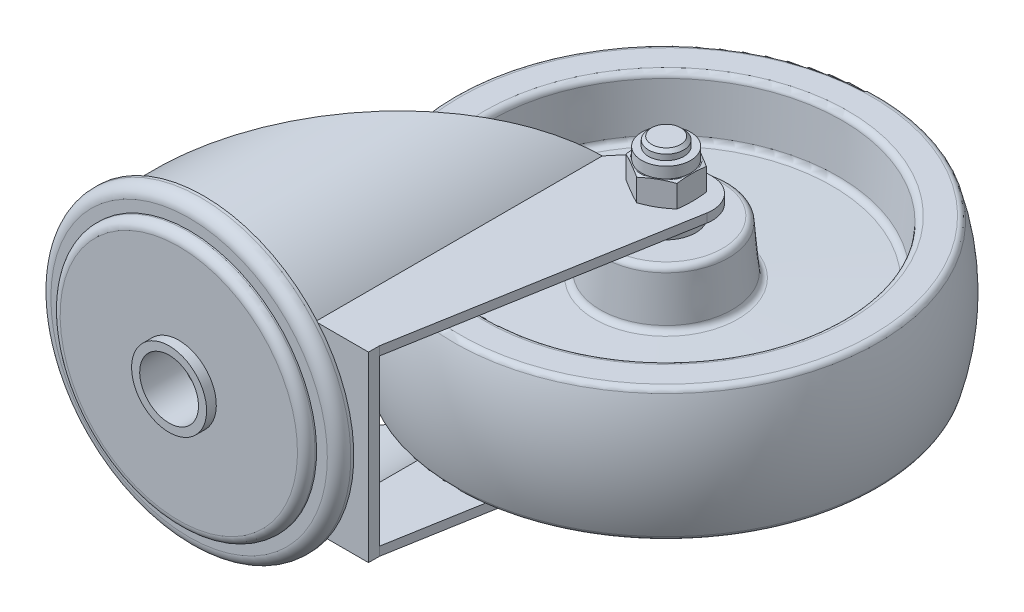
ISO-10303-21;
HEADER;
FILE_DESCRIPTION(('STEP AP214'),'2;1');
FILE_NAME('part.step','',(''),(''),'','','');
FILE_SCHEMA(('AUTOMOTIVE_DESIGN { 1 0 10303 214 1 1 1 1 }'));
ENDSEC;
DATA;
#1=APPLICATION_CONTEXT('core data for automotive mechanical design processes');
#2=APPLICATION_PROTOCOL_DEFINITION('international standard','automotive_design',2000,#1);
#3=PRODUCT_CONTEXT('',#1,'mechanical');
#4=PRODUCT('Part','Part','',(#3));
#5=PRODUCT_RELATED_PRODUCT_CATEGORY('part','',(#4));
#6=PRODUCT_DEFINITION_FORMATION('','',#4);
#7=PRODUCT_DEFINITION_CONTEXT('part definition',#1,'design');
#8=PRODUCT_DEFINITION('design','',#6,#7);
#9=PRODUCT_DEFINITION_SHAPE('','',#8);
#10=(LENGTH_UNIT() NAMED_UNIT(*) SI_UNIT(.MILLI.,.METRE.));
#11=(NAMED_UNIT(*) PLANE_ANGLE_UNIT() SI_UNIT($,.RADIAN.));
#12=(NAMED_UNIT(*) SI_UNIT($,.STERADIAN.) SOLID_ANGLE_UNIT());
#13=UNCERTAINTY_MEASURE_WITH_UNIT(LENGTH_MEASURE(1.E-05),#10,'distance_accuracy_value','');
#14=(GEOMETRIC_REPRESENTATION_CONTEXT(3) GLOBAL_UNCERTAINTY_ASSIGNED_CONTEXT((#13)) GLOBAL_UNIT_ASSIGNED_CONTEXT((#10,
#11,#12)) REPRESENTATION_CONTEXT('',''));
#15=CARTESIAN_POINT('',(0.,0.,0.));
#16=DIRECTION('',(0.,0.,1.));
#17=DIRECTION('',(1.,0.,0.));
#18=AXIS2_PLACEMENT_3D('',#15,#16,#17);
#19=CARTESIAN_POINT('',(76.,31.,-13.8));
#20=DIRECTION('',(0.,1.,0.));
#21=DIRECTION('',(-1.,0.,0.));
#22=AXIS2_PLACEMENT_3D('',#19,#20,#21);
#23=PLANE('',#22);
#24=CARTESIAN_POINT('',(51.3000000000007,31.,-113.999999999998));
#25=DIRECTION('',(0.,1.,0.));
#26=DIRECTION('',(-1.,0.,0.));
#27=AXIS2_PLACEMENT_3D('',#24,#25,#26);
#28=CIRCLE('',#27,10.0000000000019);
#29=CARTESIAN_POINT('',(51.3,31.,-124.));
#30=VERTEX_POINT('',#29);
#31=CARTESIAN_POINT('',(43.639206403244,31.,-120.427459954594));
#32=VERTEX_POINT('',#31);
#33=EDGE_CURVE('E1261',#30,#32,#28,.T.);
#34=ORIENTED_EDGE('',*,*,#33,.T.);
#35=DIRECTION('',(-0.642745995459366,0.,0.766079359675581));
#36=VECTOR('',#35,1.);
#37=CARTESIAN_POINT('',(4.505407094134,31.,-73.784468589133));
#38=LINE('',#37,#36);
#39=CARTESIAN_POINT('',(35.9895818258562,31.,-111.30998658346));
#40=VERTEX_POINT('',#39);
#41=EDGE_CURVE('E990',#32,#40,#38,.T.);
#42=ORIENTED_EDGE('',*,*,#41,.T.);
#43=DIRECTION('',(0.,0.,1.));
#44=VECTOR('',#43,1.);
#45=CARTESIAN_POINT('',(35.9895818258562,31.,-123.));
#46=LINE('',#45,#44);
#47=CARTESIAN_POINT('',(35.9895818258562,31.,-13.8));
#48=VERTEX_POINT('',#47);
#49=EDGE_CURVE('E1007',#40,#48,#46,.T.);
#50=ORIENTED_EDGE('',*,*,#49,.T.);
#51=DIRECTION('',(1.,0.,0.));
#52=VECTOR('',#51,1.);
#53=CARTESIAN_POINT('',(0.,31.,-13.8));
#54=LINE('',#53,#52);
#55=CARTESIAN_POINT('',(54.,31.,-13.8));
#56=VERTEX_POINT('',#55);
#57=EDGE_CURVE('E1004',#48,#56,#54,.T.);
#58=ORIENTED_EDGE('',*,*,#57,.T.);
#59=DIRECTION('',(0.,0.,-1.));
#60=VECTOR('',#59,1.);
#61=CARTESIAN_POINT('',(54.,31.,-13.8));
#62=LINE('',#61,#60);
#63=CARTESIAN_POINT('',(54.,31.,-17.5));
#64=VERTEX_POINT('',#63);
#65=EDGE_CURVE('E1249',#56,#64,#62,.T.);
#66=ORIENTED_EDGE('',*,*,#65,.T.);
#67=DIRECTION('',(0.172022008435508,0.,-0.985093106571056));
#68=VECTOR('',#67,1.);
#69=CARTESIAN_POINT('',(54.0240211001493,31.,-17.6375580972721));
#70=LINE('',#69,#68);
#71=CARTESIAN_POINT('',(70.550931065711,31.,-112.279779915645));
#72=VERTEX_POINT('',#71);
#73=EDGE_CURVE('E1252',#64,#72,#70,.T.);
#74=ORIENTED_EDGE('',*,*,#73,.T.);
#75=CARTESIAN_POINT('',(60.7,31.,-114.));
#76=DIRECTION('',(0.,1.,0.));
#77=DIRECTION('',(-1.,0.,0.));
#78=AXIS2_PLACEMENT_3D('',#75,#76,#77);
#79=CIRCLE('',#78,10.);
#80=CARTESIAN_POINT('',(60.7,31.,-124.));
#81=VERTEX_POINT('',#80);
#82=EDGE_CURVE('E1255',#72,#81,#79,.T.);
#83=ORIENTED_EDGE('',*,*,#82,.T.);
#84=DIRECTION('',(-1.,0.,0.));
#85=VECTOR('',#84,1.);
#86=CARTESIAN_POINT('',(76.,31.,-124.));
#87=LINE('',#86,#85);
#88=EDGE_CURVE('E1258',#81,#30,#87,.T.);
#89=ORIENTED_EDGE('',*,*,#88,.T.);
#90=EDGE_LOOP('',(#34,#42,#50,#58,#66,#74,#83,#89));
#91=FACE_BOUND('',#90,.T.);
#92=CARTESIAN_POINT('',(56.,31.,-113.));
#93=DIRECTION('',(0.,-1.,0.));
#94=DIRECTION('',(1.,0.,0.));
#95=AXIS2_PLACEMENT_3D('',#92,#93,#94);
#96=CIRCLE('',#95,8.6625);
#97=CARTESIAN_POINT('',(60.33125,31.,-120.501945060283));
#98=VERTEX_POINT('',#97);
#99=CARTESIAN_POINT('',(64.6625,31.,-113.));
#100=VERTEX_POINT('',#99);
#101=EDGE_CURVE('E34',#98,#100,#96,.T.);
#102=ORIENTED_EDGE('',*,*,#101,.T.);
#103=CARTESIAN_POINT('',(60.33125,31.,-105.498054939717));
#104=VERTEX_POINT('',#103);
#105=EDGE_CURVE('E9',#100,#104,#96,.T.);
#106=ORIENTED_EDGE('',*,*,#105,.T.);
#107=CARTESIAN_POINT('',(51.66875,31.,-105.498054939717));
#108=VERTEX_POINT('',#107);
#109=EDGE_CURVE('E32',#104,#108,#96,.T.);
#110=ORIENTED_EDGE('',*,*,#109,.T.);
#111=CARTESIAN_POINT('',(47.3375,31.,-113.));
#112=VERTEX_POINT('',#111);
#113=EDGE_CURVE('E286',#108,#112,#96,.T.);
#114=ORIENTED_EDGE('',*,*,#113,.T.);
#115=CARTESIAN_POINT('',(51.66875,31.,-120.501945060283));
#116=VERTEX_POINT('',#115);
#117=EDGE_CURVE('E288',#112,#116,#96,.T.);
#118=ORIENTED_EDGE('',*,*,#117,.T.);
#119=EDGE_CURVE('E301',#116,#98,#96,.T.);
#120=ORIENTED_EDGE('',*,*,#119,.T.);
#121=EDGE_LOOP('',(#102,#106,#110,#114,#118,#120));
#122=FACE_BOUND('',#121,.T.);
#123=ADVANCED_FACE('F15',(#91,#122),#23,.T.);
#124=CARTESIAN_POINT('',(0.,28.,-17.5));
#125=DIRECTION('',(0.,-1.,0.));
#126=DIRECTION('',(1.,0.,0.));
#127=AXIS2_PLACEMENT_3D('',#124,#125,#126);
#128=PLANE('',#127);
#129=CARTESIAN_POINT('',(60.7,28.,-114.));
#130=DIRECTION('',(0.,-1.,0.));
#131=DIRECTION('',(1.,0.,0.));
#132=AXIS2_PLACEMENT_3D('',#129,#130,#131);
#133=CIRCLE('',#132,10.);
#134=CARTESIAN_POINT('',(60.7,28.,-124.));
#135=VERTEX_POINT('',#134);
#136=CARTESIAN_POINT('',(70.550931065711,28.,-112.279779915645));
#137=VERTEX_POINT('',#136);
#138=EDGE_CURVE('E1244',#135,#137,#133,.T.);
#139=ORIENTED_EDGE('',*,*,#138,.T.);
#140=DIRECTION('',(-0.172022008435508,0.,0.985093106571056));
#141=VECTOR('',#140,1.);
#142=CARTESIAN_POINT('',(70.550931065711,28.,-112.279779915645));
#143=LINE('',#142,#141);
#144=CARTESIAN_POINT('',(54.,28.,-17.5));
#145=VERTEX_POINT('',#144);
#146=EDGE_CURVE('E982',#137,#145,#143,.T.);
#147=ORIENTED_EDGE('',*,*,#146,.T.);
#148=DIRECTION('',(1.,0.,0.));
#149=VECTOR('',#148,1.);
#150=CARTESIAN_POINT('',(0.,28.,-17.5));
#151=LINE('',#150,#149);
#152=CARTESIAN_POINT('',(35.227829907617,28.,-17.5));
#153=VERTEX_POINT('',#152);
#154=EDGE_CURVE('E1218',#153,#145,#151,.T.);
#155=ORIENTED_EDGE('',*,*,#154,.F.);
#156=DIRECTION('',(0.,0.,1.));
#157=VECTOR('',#156,1.);
#158=CARTESIAN_POINT('',(35.227829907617,28.,-123.));
#159=LINE('',#158,#157);
#160=CARTESIAN_POINT('',(35.227829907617,28.,-110.402065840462));
#161=VERTEX_POINT('',#160);
#162=EDGE_CURVE('E1068',#153,#161,#159,.F.);
#163=ORIENTED_EDGE('',*,*,#162,.T.);
#164=DIRECTION('',(0.642745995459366,0.,-0.766079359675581));
#165=VECTOR('',#164,1.);
#166=CARTESIAN_POINT('',(-47.5,28.,-11.8));
#167=LINE('',#166,#165);
#168=CARTESIAN_POINT('',(43.639206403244,28.,-120.427459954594));
#169=VERTEX_POINT('',#168);
#170=EDGE_CURVE('E983',#161,#169,#167,.T.);
#171=ORIENTED_EDGE('',*,*,#170,.T.);
#172=CARTESIAN_POINT('',(51.3000000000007,28.,-113.999999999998));
#173=DIRECTION('',(0.,-1.,0.));
#174=DIRECTION('',(1.,0.,0.));
#175=AXIS2_PLACEMENT_3D('',#172,#173,#174);
#176=CIRCLE('',#175,10.0000000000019);
#177=CARTESIAN_POINT('',(51.3,28.,-124.));
#178=VERTEX_POINT('',#177);
#179=EDGE_CURVE('E975',#169,#178,#176,.T.);
#180=ORIENTED_EDGE('',*,*,#179,.T.);
#181=DIRECTION('',(1.,0.,0.));
#182=VECTOR('',#181,1.);
#183=CARTESIAN_POINT('',(0.,28.,-124.));
#184=LINE('',#183,#182);
#185=EDGE_CURVE('E1230',#178,#135,#184,.T.);
#186=ORIENTED_EDGE('',*,*,#185,.T.);
#187=EDGE_LOOP('',(#139,#147,#155,#163,#171,#180,#186));
#188=FACE_BOUND('',#187,.T.);
#189=CARTESIAN_POINT('',(56.,28.,-113.));
#190=DIRECTION('',(0.,-1.,0.));
#191=DIRECTION('',(1.,0.,0.));
#192=AXIS2_PLACEMENT_3D('',#189,#190,#191);
#193=CIRCLE('',#192,10.);
#194=CARTESIAN_POINT('',(66.,28.,-113.));
#195=VERTEX_POINT('',#194);
#196=EDGE_CURVE('E462',#195,#195,#193,.F.);
#197=ORIENTED_EDGE('',*,*,#196,.T.);
#198=EDGE_LOOP('',(#197));
#199=FACE_BOUND('',#198,.T.);
#200=ADVANCED_FACE('F721',(#188,#199),#128,.T.);
#201=CARTESIAN_POINT('',(76.,-31.,-13.8));
#202=DIRECTION('',(0.,1.,0.));
#203=DIRECTION('',(-1.,0.,0.));
#204=AXIS2_PLACEMENT_3D('',#201,#202,#203);
#205=PLANE('',#204);
#206=DIRECTION('',(0.,0.,1.));
#207=VECTOR('',#206,1.);
#208=CARTESIAN_POINT('',(35.9895818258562,-31.,-123.));
#209=LINE('',#208,#207);
#210=CARTESIAN_POINT('',(35.9895818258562,-31.,-111.30998658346));
#211=VERTEX_POINT('',#210);
#212=CARTESIAN_POINT('',(35.9895818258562,-31.,-13.8));
#213=VERTEX_POINT('',#212);
#214=EDGE_CURVE('E1012',#211,#213,#209,.T.);
#215=ORIENTED_EDGE('',*,*,#214,.F.);
#216=DIRECTION('',(0.642745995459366,0.,-0.766079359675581));
#217=VECTOR('',#216,1.);
#218=CARTESIAN_POINT('',(4.505407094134,-31.,-73.784468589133));
#219=LINE('',#218,#217);
#220=CARTESIAN_POINT('',(43.639206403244,-31.,-120.427459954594));
#221=VERTEX_POINT('',#220);
#222=EDGE_CURVE('E1059',#211,#221,#219,.T.);
#223=ORIENTED_EDGE('',*,*,#222,.T.);
#224=CARTESIAN_POINT('',(51.3000000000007,-31.,-113.999999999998));
#225=DIRECTION('',(0.,1.,0.));
#226=DIRECTION('',(-1.,0.,0.));
#227=AXIS2_PLACEMENT_3D('',#224,#225,#226);
#228=CIRCLE('',#227,10.0000000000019);
#229=CARTESIAN_POINT('',(51.3,-31.,-124.));
#230=VERTEX_POINT('',#229);
#231=EDGE_CURVE('E1056',#221,#230,#228,.F.);
#232=ORIENTED_EDGE('',*,*,#231,.T.);
#233=DIRECTION('',(1.,0.,0.));
#234=VECTOR('',#233,1.);
#235=CARTESIAN_POINT('',(76.,-31.,-124.));
#236=LINE('',#235,#234);
#237=CARTESIAN_POINT('',(60.7,-31.,-124.));
#238=VERTEX_POINT('',#237);
#239=EDGE_CURVE('E1053',#230,#238,#236,.T.);
#240=ORIENTED_EDGE('',*,*,#239,.T.);
#241=CARTESIAN_POINT('',(60.7,-31.,-114.));
#242=DIRECTION('',(0.,1.,0.));
#243=DIRECTION('',(-1.,0.,0.));
#244=AXIS2_PLACEMENT_3D('',#241,#242,#243);
#245=CIRCLE('',#244,10.);
#246=CARTESIAN_POINT('',(70.550931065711,-31.,-112.279779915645));
#247=VERTEX_POINT('',#246);
#248=EDGE_CURVE('E1050',#238,#247,#245,.F.);
#249=ORIENTED_EDGE('',*,*,#248,.T.);
#250=DIRECTION('',(-0.172022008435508,0.,0.985093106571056));
#251=VECTOR('',#250,1.);
#252=CARTESIAN_POINT('',(54.0240211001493,-31.,-17.6375580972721));
#253=LINE('',#252,#251);
#254=CARTESIAN_POINT('',(54.,-31.,-17.5));
#255=VERTEX_POINT('',#254);
#256=EDGE_CURVE('E1047',#247,#255,#253,.T.);
#257=ORIENTED_EDGE('',*,*,#256,.T.);
#258=DIRECTION('',(0.,0.,1.));
#259=VECTOR('',#258,1.);
#260=CARTESIAN_POINT('',(54.,-31.,-13.8));
#261=LINE('',#260,#259);
#262=CARTESIAN_POINT('',(54.,-31.,-13.8));
#263=VERTEX_POINT('',#262);
#264=EDGE_CURVE('E1044',#255,#263,#261,.T.);
#265=ORIENTED_EDGE('',*,*,#264,.T.);
#266=DIRECTION('',(1.,0.,0.));
#267=VECTOR('',#266,1.);
#268=CARTESIAN_POINT('',(0.,-31.,-13.8));
#269=LINE('',#268,#267);
#270=EDGE_CURVE('E1009',#213,#263,#269,.T.);
#271=ORIENTED_EDGE('',*,*,#270,.F.);
#272=EDGE_LOOP('',(#215,#223,#232,#240,#249,#257,#265,#271));
#273=FACE_BOUND('',#272,.T.);
#274=CARTESIAN_POINT('',(56.,-31.,-113.));
#275=DIRECTION('',(0.,-1.,0.));
#276=DIRECTION('',(1.,0.,0.));
#277=AXIS2_PLACEMENT_3D('',#274,#275,#276);
#278=CIRCLE('',#277,8.315);
#279=CARTESIAN_POINT('',(64.315,-31.,-113.));
#280=VERTEX_POINT('',#279);
#281=EDGE_CURVE('E552',#280,#280,#278,.T.);
#282=ORIENTED_EDGE('',*,*,#281,.F.);
#283=EDGE_LOOP('',(#282));
#284=FACE_BOUND('',#283,.T.);
#285=ADVANCED_FACE('F728',(#273,#284),#205,.F.);
#286=CARTESIAN_POINT('',(0.,-28.,-124.));
#287=DIRECTION('',(0.,1.,0.));
#288=DIRECTION('',(-1.,0.,0.));
#289=AXIS2_PLACEMENT_3D('',#286,#287,#288);
#290=PLANE('',#289);
#291=CARTESIAN_POINT('',(60.7,-28.,-114.));
#292=DIRECTION('',(0.,1.,0.));
#293=DIRECTION('',(-1.,0.,0.));
#294=AXIS2_PLACEMENT_3D('',#291,#292,#293);
#295=CIRCLE('',#294,10.);
#296=CARTESIAN_POINT('',(70.550931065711,-28.,-112.279779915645));
#297=VERTEX_POINT('',#296);
#298=CARTESIAN_POINT('',(60.7,-28.,-124.));
#299=VERTEX_POINT('',#298);
#300=EDGE_CURVE('E1240',#297,#299,#295,.T.);
#301=ORIENTED_EDGE('',*,*,#300,.T.);
#302=DIRECTION('',(1.,0.,0.));
#303=VECTOR('',#302,1.);
#304=CARTESIAN_POINT('',(0.,-28.,-124.));
#305=LINE('',#304,#303);
#306=CARTESIAN_POINT('',(51.3,-28.,-124.));
#307=VERTEX_POINT('',#306);
#308=EDGE_CURVE('E1227',#307,#299,#305,.T.);
#309=ORIENTED_EDGE('',*,*,#308,.F.);
#310=CARTESIAN_POINT('',(51.3000000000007,-28.,-113.999999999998));
#311=DIRECTION('',(0.,1.,0.));
#312=DIRECTION('',(-1.,0.,0.));
#313=AXIS2_PLACEMENT_3D('',#310,#311,#312);
#314=CIRCLE('',#313,10.0000000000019);
#315=CARTESIAN_POINT('',(43.639206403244,-28.,-120.427459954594));
#316=VERTEX_POINT('',#315);
#317=EDGE_CURVE('E1236',#307,#316,#314,.T.);
#318=ORIENTED_EDGE('',*,*,#317,.T.);
#319=DIRECTION('',(-0.642745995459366,0.,0.766079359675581));
#320=VECTOR('',#319,1.);
#321=CARTESIAN_POINT('',(-47.5,-28.,-11.8));
#322=LINE('',#321,#320);
#323=CARTESIAN_POINT('',(35.2278299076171,-28.,-110.402065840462));
#324=VERTEX_POINT('',#323);
#325=EDGE_CURVE('E1234',#316,#324,#322,.T.);
#326=ORIENTED_EDGE('',*,*,#325,.T.);
#327=DIRECTION('',(0.,0.,1.));
#328=VECTOR('',#327,1.);
#329=CARTESIAN_POINT('',(35.2278299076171,-28.,-123.));
#330=LINE('',#329,#328);
#331=CARTESIAN_POINT('',(35.2278299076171,-28.,-17.5));
#332=VERTEX_POINT('',#331);
#333=EDGE_CURVE('E1065',#324,#332,#330,.T.);
#334=ORIENTED_EDGE('',*,*,#333,.T.);
#335=DIRECTION('',(1.,0.,0.));
#336=VECTOR('',#335,1.);
#337=CARTESIAN_POINT('',(0.,-28.,-17.5));
#338=LINE('',#337,#336);
#339=CARTESIAN_POINT('',(54.,-28.,-17.5));
#340=VERTEX_POINT('',#339);
#341=EDGE_CURVE('E1220',#332,#340,#338,.T.);
#342=ORIENTED_EDGE('',*,*,#341,.T.);
#343=DIRECTION('',(0.172022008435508,0.,-0.985093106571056));
#344=VECTOR('',#343,1.);
#345=CARTESIAN_POINT('',(70.550931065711,-28.,-112.279779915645));
#346=LINE('',#345,#344);
#347=EDGE_CURVE('E1238',#340,#297,#346,.T.);
#348=ORIENTED_EDGE('',*,*,#347,.T.);
#349=EDGE_LOOP('',(#301,#309,#318,#326,#334,#342,#348));
#350=FACE_BOUND('',#349,.T.);
#351=CARTESIAN_POINT('',(56.,-28.,-113.));
#352=DIRECTION('',(0.,1.,0.));
#353=DIRECTION('',(-1.,0.,0.));
#354=AXIS2_PLACEMENT_3D('',#351,#352,#353);
#355=CIRCLE('',#354,10.);
#356=CARTESIAN_POINT('',(46.,-28.,-113.));
#357=VERTEX_POINT('',#356);
#358=EDGE_CURVE('E1079',#357,#357,#355,.F.);
#359=ORIENTED_EDGE('',*,*,#358,.T.);
#360=EDGE_LOOP('',(#359));
#361=FACE_BOUND('',#360,.T.);
#362=ADVANCED_FACE('F738',(#350,#361),#290,.T.);
#363=CARTESIAN_POINT('',(51.3000000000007,-150.,-113.999999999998));
#364=DIRECTION('',(0.,1.,0.));
#365=DIRECTION('',(-1.,0.,0.));
#366=AXIS2_PLACEMENT_3D('',#363,#364,#365);
#367=CYLINDRICAL_SURFACE('',#366,10.0000000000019);
#368=ORIENTED_EDGE('',*,*,#179,.F.);
#369=DIRECTION('',(0.,1.,0.));
#370=VECTOR('',#369,1.);
#371=CARTESIAN_POINT('',(43.639206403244,-150.,-120.427459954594));
#372=LINE('',#371,#370);
#373=EDGE_CURVE('E978',#169,#32,#372,.T.);
#374=ORIENTED_EDGE('',*,*,#373,.T.);
#375=ORIENTED_EDGE('',*,*,#33,.F.);
#376=DIRECTION('',(0.,1.,0.));
#377=VECTOR('',#376,1.);
#378=CARTESIAN_POINT('',(51.3,-150.,-124.));
#379=LINE('',#378,#377);
#380=EDGE_CURVE('E980',#178,#30,#379,.T.);
#381=ORIENTED_EDGE('',*,*,#380,.F.);
#382=EDGE_LOOP('',(#368,#374,#375,#381));
#383=FACE_BOUND('',#382,.T.);
#384=ADVANCED_FACE('F939',(#383),#367,.T.);
#385=ORIENTED_EDGE('',*,*,#317,.F.);
#386=EDGE_CURVE('E992',#230,#307,#379,.T.);
#387=ORIENTED_EDGE('',*,*,#386,.F.);
#388=ORIENTED_EDGE('',*,*,#231,.F.);
#389=EDGE_CURVE('E991',#221,#316,#372,.T.);
#390=ORIENTED_EDGE('',*,*,#389,.T.);
#391=EDGE_LOOP('',(#385,#387,#388,#390));
#392=FACE_BOUND('',#391,.T.);
#393=ADVANCED_FACE('F964',(#392),#367,.T.);
#394=CARTESIAN_POINT('',(51.3,-150.,-124.));
#395=DIRECTION('',(0.,0.,1.));
#396=DIRECTION('',(0.,1.,0.));
#397=AXIS2_PLACEMENT_3D('',#394,#395,#396);
#398=PLANE('',#397);
#399=ORIENTED_EDGE('',*,*,#185,.F.);
#400=ORIENTED_EDGE('',*,*,#380,.T.);
#401=ORIENTED_EDGE('',*,*,#88,.F.);
#402=DIRECTION('',(0.,1.,0.));
#403=VECTOR('',#402,1.);
#404=CARTESIAN_POINT('',(60.7,-150.,-124.));
#405=LINE('',#404,#403);
#406=EDGE_CURVE('E1273',#135,#81,#405,.T.);
#407=ORIENTED_EDGE('',*,*,#406,.F.);
#408=EDGE_LOOP('',(#399,#400,#401,#407));
#409=FACE_BOUND('',#408,.T.);
#410=ADVANCED_FACE('F962',(#409),#398,.F.);
#411=ORIENTED_EDGE('',*,*,#308,.T.);
#412=EDGE_CURVE('E1274',#238,#299,#405,.T.);
#413=ORIENTED_EDGE('',*,*,#412,.F.);
#414=ORIENTED_EDGE('',*,*,#239,.F.);
#415=ORIENTED_EDGE('',*,*,#386,.T.);
#416=EDGE_LOOP('',(#411,#413,#414,#415));
#417=FACE_BOUND('',#416,.T.);
#418=ADVANCED_FACE('F960',(#417),#398,.F.);
#419=CARTESIAN_POINT('',(60.7,-150.,-114.));
#420=DIRECTION('',(0.,1.,0.));
#421=DIRECTION('',(-1.,0.,0.));
#422=AXIS2_PLACEMENT_3D('',#419,#420,#421);
#423=CYLINDRICAL_SURFACE('',#422,10.);
#424=ORIENTED_EDGE('',*,*,#138,.F.);
#425=ORIENTED_EDGE('',*,*,#406,.T.);
#426=ORIENTED_EDGE('',*,*,#82,.F.);
#427=DIRECTION('',(0.,1.,0.));
#428=VECTOR('',#427,1.);
#429=CARTESIAN_POINT('',(70.550931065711,-150.,-112.279779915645));
#430=LINE('',#429,#428);
#431=EDGE_CURVE('E1270',#137,#72,#430,.T.);
#432=ORIENTED_EDGE('',*,*,#431,.F.);
#433=EDGE_LOOP('',(#424,#425,#426,#432));
#434=FACE_BOUND('',#433,.T.);
#435=ADVANCED_FACE('F957',(#434),#423,.T.);
#436=ORIENTED_EDGE('',*,*,#300,.F.);
#437=EDGE_CURVE('E1271',#247,#297,#430,.T.);
#438=ORIENTED_EDGE('',*,*,#437,.F.);
#439=ORIENTED_EDGE('',*,*,#248,.F.);
#440=ORIENTED_EDGE('',*,*,#412,.T.);
#441=EDGE_LOOP('',(#436,#438,#439,#440));
#442=FACE_BOUND('',#441,.T.);
#443=ADVANCED_FACE('F955',(#442),#423,.T.);
#444=CARTESIAN_POINT('',(70.550931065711,-150.,-112.279779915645));
#445=DIRECTION('',(-0.985093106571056,0.,-0.172022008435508));
#446=DIRECTION('',(-0.172022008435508,0.,0.985093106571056));
#447=AXIS2_PLACEMENT_3D('',#444,#445,#446);
#448=PLANE('',#447);
#449=ORIENTED_EDGE('',*,*,#146,.F.);
#450=ORIENTED_EDGE('',*,*,#431,.T.);
#451=ORIENTED_EDGE('',*,*,#73,.F.);
#452=DIRECTION('',(0.,1.,0.));
#453=VECTOR('',#452,1.);
#454=CARTESIAN_POINT('',(54.,-150.,-17.5));
#455=LINE('',#454,#453);
#456=EDGE_CURVE('E1266',#145,#64,#455,.T.);
#457=ORIENTED_EDGE('',*,*,#456,.F.);
#458=EDGE_LOOP('',(#449,#450,#451,#457));
#459=FACE_BOUND('',#458,.T.);
#460=ADVANCED_FACE('F951',(#459),#448,.F.);
#461=ORIENTED_EDGE('',*,*,#347,.F.);
#462=EDGE_CURVE('E1267',#255,#340,#455,.T.);
#463=ORIENTED_EDGE('',*,*,#462,.F.);
#464=ORIENTED_EDGE('',*,*,#256,.F.);
#465=ORIENTED_EDGE('',*,*,#437,.T.);
#466=EDGE_LOOP('',(#461,#463,#464,#465));
#467=FACE_BOUND('',#466,.T.);
#468=ADVANCED_FACE('F954',(#467),#448,.F.);
#469=CARTESIAN_POINT('',(-47.5,-150.,-11.8));
#470=DIRECTION('',(0.766079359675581,0.,0.642745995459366));
#471=DIRECTION('',(0.642745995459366,0.,-0.766079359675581));
#472=AXIS2_PLACEMENT_3D('',#469,#470,#471);
#473=PLANE('',#472);
#474=ORIENTED_EDGE('',*,*,#170,.F.);
#475=CARTESIAN_POINT('',(0.,0.,-68.4145411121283));
#476=DIRECTION('',(0.766079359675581,0.,0.642745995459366));
#477=DIRECTION('',(-0.642745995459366,0.,0.766079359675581));
#478=AXIS2_PLACEMENT_3D('',#475,#476,#477);
#479=ELLIPSE('',#478,70.0121048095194,45.);
#480=EDGE_CURVE('E1062',#161,#324,#479,.T.);
#481=ORIENTED_EDGE('',*,*,#480,.T.);
#482=ORIENTED_EDGE('',*,*,#325,.F.);
#483=ORIENTED_EDGE('',*,*,#389,.F.);
#484=ORIENTED_EDGE('',*,*,#222,.F.);
#485=CARTESIAN_POINT('',(0.,0.,-68.4145411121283));
#486=DIRECTION('',(0.766079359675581,0.,0.642745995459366));
#487=DIRECTION('',(-0.642745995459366,0.,0.766079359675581));
#488=AXIS2_PLACEMENT_3D('',#485,#486,#487);
#489=ELLIPSE('',#488,73.901666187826,47.5);
#490=CARTESIAN_POINT('',(-47.5,0.,-11.8));
#491=VERTEX_POINT('',#490);
#492=EDGE_CURVE('E1001',#211,#491,#489,.F.);
#493=ORIENTED_EDGE('',*,*,#492,.T.);
#494=CARTESIAN_POINT('',(0.,0.,-68.4145411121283));
#495=DIRECTION('',(-0.766079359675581,0.,-0.642745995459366));
#496=DIRECTION('',(-0.642745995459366,0.,0.766079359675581));
#497=AXIS2_PLACEMENT_3D('',#494,#495,#496);
#498=ELLIPSE('',#497,73.901666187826,47.5);
#499=EDGE_CURVE('E1264',#40,#491,#498,.F.);
#500=ORIENTED_EDGE('',*,*,#499,.F.);
#501=ORIENTED_EDGE('',*,*,#41,.F.);
#502=ORIENTED_EDGE('',*,*,#373,.F.);
#503=EDGE_LOOP('',(#474,#481,#482,#483,#484,#493,#500,#501,#502));
#504=FACE_BOUND('',#503,.T.);
#505=ADVANCED_FACE('F734',(#504),#473,.F.);
#506=CARTESIAN_POINT('',(0.,0.,-123.));
#507=DIRECTION('',(0.,0.,1.));
#508=DIRECTION('',(0.,1.,0.));
#509=AXIS2_PLACEMENT_3D('',#506,#507,#508);
#510=CYLINDRICAL_SURFACE('',#509,45.);
#511=CARTESIAN_POINT('',(0.,0.,-14.));
#512=DIRECTION('',(0.,0.,1.));
#513=DIRECTION('',(0.,1.,0.));
#514=AXIS2_PLACEMENT_3D('',#511,#512,#513);
#515=CIRCLE('',#514,45.);
#516=CARTESIAN_POINT('',(0.,45.,-14.));
#517=VERTEX_POINT('',#516);
#518=EDGE_CURVE('E1246',#517,#517,#515,.T.);
#519=ORIENTED_EDGE('',*,*,#518,.T.);
#520=EDGE_LOOP('',(#519));
#521=FACE_BOUND('',#520,.T.);
#522=ORIENTED_EDGE('',*,*,#162,.F.);
#523=CARTESIAN_POINT('',(0.,0.,-17.5));
#524=DIRECTION('',(0.,0.,-1.));
#525=DIRECTION('',(0.,-1.,0.));
#526=AXIS2_PLACEMENT_3D('',#523,#524,#525);
#527=CIRCLE('',#526,45.);
#528=EDGE_CURVE('E184',#332,#153,#527,.F.);
#529=ORIENTED_EDGE('',*,*,#528,.F.);
#530=ORIENTED_EDGE('',*,*,#333,.F.);
#531=ORIENTED_EDGE('',*,*,#480,.F.);
#532=EDGE_LOOP('',(#522,#529,#530,#531));
#533=FACE_BOUND('',#532,.T.);
#534=ADVANCED_FACE('F748',(#521,#533),#510,.F.);
#535=CARTESIAN_POINT('',(0.,0.,-123.));
#536=DIRECTION('',(0.,0.,1.));
#537=DIRECTION('',(0.,1.,0.));
#538=AXIS2_PLACEMENT_3D('',#535,#536,#537);
#539=CYLINDRICAL_SURFACE('',#538,47.5);
#540=ORIENTED_EDGE('',*,*,#49,.F.);
#541=ORIENTED_EDGE('',*,*,#499,.T.);
#542=CARTESIAN_POINT('',(0.,0.,-11.8));
#543=DIRECTION('',(0.,0.,-1.));
#544=DIRECTION('',(0.,-1.,0.));
#545=AXIS2_PLACEMENT_3D('',#542,#543,#544);
#546=CIRCLE('',#545,47.5);
#547=EDGE_CURVE('E1038',#491,#491,#546,.T.);
#548=ORIENTED_EDGE('',*,*,#547,.T.);
#549=ORIENTED_EDGE('',*,*,#492,.F.);
#550=ORIENTED_EDGE('',*,*,#214,.T.);
#551=CARTESIAN_POINT('',(0.,0.,-13.8));
#552=DIRECTION('',(0.,0.,1.));
#553=DIRECTION('',(0.,1.,0.));
#554=AXIS2_PLACEMENT_3D('',#551,#552,#553);
#555=CIRCLE('',#554,47.5);
#556=EDGE_CURVE('E1041',#48,#213,#555,.F.);
#557=ORIENTED_EDGE('',*,*,#556,.F.);
#558=EDGE_LOOP('',(#540,#541,#548,#549,#550,#557));
#559=FACE_BOUND('',#558,.T.);
#560=ADVANCED_FACE('F744',(#559),#539,.T.);
#561=CARTESIAN_POINT('',(0.,-31.,-13.8));
#562=DIRECTION('',(0.,0.,1.));
#563=DIRECTION('',(0.,1.,0.));
#564=AXIS2_PLACEMENT_3D('',#561,#562,#563);
#565=PLANE('',#564);
#566=DIRECTION('',(0.,-1.,0.));
#567=VECTOR('',#566,1.);
#568=CARTESIAN_POINT('',(54.,-31.,-13.8));
#569=LINE('',#568,#567);
#570=EDGE_CURVE('E995',#56,#263,#569,.T.);
#571=ORIENTED_EDGE('',*,*,#570,.F.);
#572=ORIENTED_EDGE('',*,*,#57,.F.);
#573=ORIENTED_EDGE('',*,*,#556,.T.);
#574=ORIENTED_EDGE('',*,*,#270,.T.);
#575=EDGE_LOOP('',(#571,#572,#573,#574));
#576=FACE_BOUND('',#575,.T.);
#577=ADVANCED_FACE('F740',(#576),#565,.T.);
#578=CARTESIAN_POINT('',(0.,0.,0.));
#579=DIRECTION('',(0.,0.,1.));
#580=DIRECTION('',(0.,1.,0.));
#581=AXIS2_PLACEMENT_3D('',#578,#579,#580);
#582=PLANE('',#581);
#583=CARTESIAN_POINT('',(0.,0.,0.));
#584=DIRECTION('',(0.,0.,1.));
#585=DIRECTION('',(0.,1.,0.));
#586=AXIS2_PLACEMENT_3D('',#583,#584,#585);
#587=CIRCLE('',#586,10.);
#588=CARTESIAN_POINT('',(0.,10.,0.));
#589=VERTEX_POINT('',#588);
#590=EDGE_CURVE('E524',#589,#589,#587,.T.);
#591=ORIENTED_EDGE('',*,*,#590,.F.);
#592=EDGE_LOOP('',(#591));
#593=FACE_BOUND('',#592,.T.);
#594=CARTESIAN_POINT('',(0.,0.,0.));
#595=DIRECTION('',(0.,0.,1.));
#596=DIRECTION('',(0.,1.,0.));
#597=AXIS2_PLACEMENT_3D('',#594,#595,#596);
#598=CIRCLE('',#597,12.75);
#599=CARTESIAN_POINT('',(0.,12.75,0.));
#600=VERTEX_POINT('',#599);
#601=EDGE_CURVE('E1035',#600,#600,#598,.T.);
#602=ORIENTED_EDGE('',*,*,#601,.T.);
#603=EDGE_LOOP('',(#602));
#604=FACE_BOUND('',#603,.T.);
#605=ADVANCED_FACE('F743',(#593,#604),#582,.T.);
#606=CARTESIAN_POINT('',(0.,0.,-11.8));
#607=DIRECTION('',(0.,0.,1.));
#608=DIRECTION('',(0.,1.,0.));
#609=AXIS2_PLACEMENT_3D('',#606,#607,#608);
#610=CYLINDRICAL_SURFACE('',#609,12.75);
#611=CARTESIAN_POINT('',(0.,0.,-3.3));
#612=DIRECTION('',(0.,0.,1.));
#613=DIRECTION('',(0.,1.,0.));
#614=AXIS2_PLACEMENT_3D('',#611,#612,#613);
#615=CIRCLE('',#614,12.75);
#616=CARTESIAN_POINT('',(0.,12.75,-3.3));
#617=VERTEX_POINT('',#616);
#618=EDGE_CURVE('E1032',#617,#617,#615,.T.);
#619=ORIENTED_EDGE('',*,*,#618,.T.);
#620=EDGE_LOOP('',(#619));
#621=FACE_BOUND('',#620,.T.);
#622=ORIENTED_EDGE('',*,*,#601,.F.);
#623=EDGE_LOOP('',(#622));
#624=FACE_BOUND('',#623,.T.);
#625=ADVANCED_FACE('F778',(#621,#624),#610,.T.);
#626=CARTESIAN_POINT('',(-12.75,0.,-3.3));
#627=DIRECTION('',(0.,0.,1.));
#628=DIRECTION('',(0.,1.,0.));
#629=AXIS2_PLACEMENT_3D('',#626,#627,#628);
#630=PLANE('',#629);
#631=CARTESIAN_POINT('',(0.,0.,-3.3));
#632=DIRECTION('',(0.,0.,1.));
#633=DIRECTION('',(0.,1.,0.));
#634=AXIS2_PLACEMENT_3D('',#631,#632,#633);
#635=CIRCLE('',#634,40.35);
#636=CARTESIAN_POINT('',(0.,40.35,-3.3));
#637=VERTEX_POINT('',#636);
#638=EDGE_CURVE('E1029',#637,#637,#635,.T.);
#639=ORIENTED_EDGE('',*,*,#638,.T.);
#640=EDGE_LOOP('',(#639));
#641=FACE_BOUND('',#640,.T.);
#642=ORIENTED_EDGE('',*,*,#618,.F.);
#643=EDGE_LOOP('',(#642));
#644=FACE_BOUND('',#643,.T.);
#645=ADVANCED_FACE('F774',(#641,#644),#630,.T.);
#646=CARTESIAN_POINT('',(0.,0.,-6.29999999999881));
#647=DIRECTION('',(0.,0.,1.));
#648=DIRECTION('',(0.,1.,0.));
#649=AXIS2_PLACEMENT_3D('',#646,#647,#648);
#650=TOROIDAL_SURFACE('',#649,40.3500000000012,2.99999999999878);
#651=CARTESIAN_POINT('',(0.,0.,-6.3));
#652=DIRECTION('',(0.,0.,1.));
#653=DIRECTION('',(0.,1.,0.));
#654=AXIS2_PLACEMENT_3D('',#651,#652,#653);
#655=CIRCLE('',#654,43.35);
#656=CARTESIAN_POINT('',(0.,43.35,-6.3));
#657=VERTEX_POINT('',#656);
#658=EDGE_CURVE('E1026',#657,#657,#655,.T.);
#659=ORIENTED_EDGE('',*,*,#658,.T.);
#660=EDGE_LOOP('',(#659));
#661=FACE_BOUND('',#660,.T.);
#662=ORIENTED_EDGE('',*,*,#638,.F.);
#663=EDGE_LOOP('',(#662));
#664=FACE_BOUND('',#663,.T.);
#665=ADVANCED_FACE('F770',(#661,#664),#650,.T.);
#666=CARTESIAN_POINT('',(0.,0.,-11.8));
#667=DIRECTION('',(0.,0.,1.));
#668=DIRECTION('',(0.,1.,0.));
#669=AXIS2_PLACEMENT_3D('',#666,#667,#668);
#670=CYLINDRICAL_SURFACE('',#669,43.35);
#671=CARTESIAN_POINT('',(0.,0.,-6.8));
#672=DIRECTION('',(0.,0.,1.));
#673=DIRECTION('',(0.,1.,0.));
#674=AXIS2_PLACEMENT_3D('',#671,#672,#673);
#675=CIRCLE('',#674,43.35);
#676=CARTESIAN_POINT('',(0.,43.35,-6.8));
#677=VERTEX_POINT('',#676);
#678=EDGE_CURVE('E1023',#677,#677,#675,.T.);
#679=ORIENTED_EDGE('',*,*,#678,.T.);
#680=EDGE_LOOP('',(#679));
#681=FACE_BOUND('',#680,.T.);
#682=ORIENTED_EDGE('',*,*,#658,.F.);
#683=EDGE_LOOP('',(#682));
#684=FACE_BOUND('',#683,.T.);
#685=ADVANCED_FACE('F766',(#681,#684),#670,.T.);
#686=CARTESIAN_POINT('',(-43.35,0.,-6.8));
#687=DIRECTION('',(0.,0.,1.));
#688=DIRECTION('',(0.,1.,0.));
#689=AXIS2_PLACEMENT_3D('',#686,#687,#688);
#690=PLANE('',#689);
#691=CARTESIAN_POINT('',(0.,0.,-6.8));
#692=DIRECTION('',(0.,0.,1.));
#693=DIRECTION('',(0.,1.,0.));
#694=AXIS2_PLACEMENT_3D('',#691,#692,#693);
#695=CIRCLE('',#694,47.);
#696=CARTESIAN_POINT('',(0.,47.,-6.8));
#697=VERTEX_POINT('',#696);
#698=EDGE_CURVE('E1020',#697,#697,#695,.T.);
#699=ORIENTED_EDGE('',*,*,#698,.T.);
#700=EDGE_LOOP('',(#699));
#701=FACE_BOUND('',#700,.T.);
#702=ORIENTED_EDGE('',*,*,#678,.F.);
#703=EDGE_LOOP('',(#702));
#704=FACE_BOUND('',#703,.T.);
#705=ADVANCED_FACE('F762',(#701,#704),#690,.T.);
#706=CARTESIAN_POINT('',(0.,0.,-10.799999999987));
#707=DIRECTION('',(0.,0.,1.));
#708=DIRECTION('',(0.,1.,0.));
#709=AXIS2_PLACEMENT_3D('',#706,#707,#708);
#710=TOROIDAL_SURFACE('',#709,47.000000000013,3.99999999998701);
#711=CARTESIAN_POINT('',(0.,0.,-10.8));
#712=DIRECTION('',(0.,0.,1.));
#713=DIRECTION('',(0.,1.,0.));
#714=AXIS2_PLACEMENT_3D('',#711,#712,#713);
#715=CIRCLE('',#714,51.);
#716=CARTESIAN_POINT('',(0.,51.,-10.8));
#717=VERTEX_POINT('',#716);
#718=EDGE_CURVE('E1017',#717,#717,#715,.T.);
#719=ORIENTED_EDGE('',*,*,#718,.T.);
#720=EDGE_LOOP('',(#719));
#721=FACE_BOUND('',#720,.T.);
#722=ORIENTED_EDGE('',*,*,#698,.F.);
#723=EDGE_LOOP('',(#722));
#724=FACE_BOUND('',#723,.T.);
#725=ADVANCED_FACE('F758',(#721,#724),#710,.T.);
#726=CARTESIAN_POINT('',(0.,0.,-11.8));
#727=DIRECTION('',(0.,0.,1.));
#728=DIRECTION('',(0.,1.,0.));
#729=AXIS2_PLACEMENT_3D('',#726,#727,#728);
#730=CYLINDRICAL_SURFACE('',#729,51.);
#731=CARTESIAN_POINT('',(0.,0.,-11.8));
#732=DIRECTION('',(0.,0.,1.));
#733=DIRECTION('',(0.,1.,0.));
#734=AXIS2_PLACEMENT_3D('',#731,#732,#733);
#735=CIRCLE('',#734,51.);
#736=CARTESIAN_POINT('',(0.,51.,-11.8));
#737=VERTEX_POINT('',#736);
#738=EDGE_CURVE('E1014',#737,#737,#735,.T.);
#739=ORIENTED_EDGE('',*,*,#738,.T.);
#740=EDGE_LOOP('',(#739));
#741=FACE_BOUND('',#740,.T.);
#742=ORIENTED_EDGE('',*,*,#718,.F.);
#743=EDGE_LOOP('',(#742));
#744=FACE_BOUND('',#743,.T.);
#745=ADVANCED_FACE('F754',(#741,#744),#730,.T.);
#746=CARTESIAN_POINT('',(-51.,0.,-11.8));
#747=DIRECTION('',(0.,0.,-1.));
#748=DIRECTION('',(0.,-1.,0.));
#749=AXIS2_PLACEMENT_3D('',#746,#747,#748);
#750=PLANE('',#749);
#751=ORIENTED_EDGE('',*,*,#738,.F.);
#752=EDGE_LOOP('',(#751));
#753=FACE_BOUND('',#752,.T.);
#754=ORIENTED_EDGE('',*,*,#547,.F.);
#755=EDGE_LOOP('',(#754));
#756=FACE_BOUND('',#755,.T.);
#757=ADVANCED_FACE('F750',(#753,#756),#750,.T.);
#758=CARTESIAN_POINT('',(54.,-150.,-17.5));
#759=DIRECTION('',(-1.,0.,0.));
#760=DIRECTION('',(0.,-1.,0.));
#761=AXIS2_PLACEMENT_3D('',#758,#759,#760);
#762=PLANE('',#761);
#763=ORIENTED_EDGE('',*,*,#570,.T.);
#764=ORIENTED_EDGE('',*,*,#264,.F.);
#765=ORIENTED_EDGE('',*,*,#462,.T.);
#766=DIRECTION('',(0.,-1.,0.));
#767=VECTOR('',#766,1.);
#768=CARTESIAN_POINT('',(54.,-150.,-17.5));
#769=LINE('',#768,#767);
#770=EDGE_CURVE('E1232',#145,#340,#769,.T.);
#771=ORIENTED_EDGE('',*,*,#770,.F.);
#772=ORIENTED_EDGE('',*,*,#456,.T.);
#773=ORIENTED_EDGE('',*,*,#65,.F.);
#774=EDGE_LOOP('',(#763,#764,#765,#771,#772,#773));
#775=FACE_BOUND('',#774,.T.);
#776=ADVANCED_FACE('F753',(#775),#762,.F.);
#777=CARTESIAN_POINT('',(0.,0.,-14.));
#778=DIRECTION('',(0.,0.,1.));
#779=DIRECTION('',(0.,1.,0.));
#780=AXIS2_PLACEMENT_3D('',#777,#778,#779);
#781=PLANE('',#780);
#782=CARTESIAN_POINT('',(0.,0.,-14.));
#783=DIRECTION('',(0.,0.,1.));
#784=DIRECTION('',(0.,1.,0.));
#785=AXIS2_PLACEMENT_3D('',#782,#783,#784);
#786=CIRCLE('',#785,10.);
#787=CARTESIAN_POINT('',(0.,10.,-14.));
#788=VERTEX_POINT('',#787);
#789=EDGE_CURVE('E1070',#788,#788,#786,.T.);
#790=ORIENTED_EDGE('',*,*,#789,.T.);
#791=EDGE_LOOP('',(#790));
#792=FACE_BOUND('',#791,.T.);
#793=ORIENTED_EDGE('',*,*,#518,.F.);
#794=EDGE_LOOP('',(#793));
#795=FACE_BOUND('',#794,.T.);
#796=ADVANCED_FACE('F937',(#792,#795),#781,.F.);
#797=CARTESIAN_POINT('',(0.,-28.,-17.5));
#798=DIRECTION('',(0.,0.,-1.));
#799=DIRECTION('',(0.,-1.,0.));
#800=AXIS2_PLACEMENT_3D('',#797,#798,#799);
#801=PLANE('',#800);
#802=ORIENTED_EDGE('',*,*,#770,.T.);
#803=ORIENTED_EDGE('',*,*,#341,.F.);
#804=ORIENTED_EDGE('',*,*,#528,.T.);
#805=ORIENTED_EDGE('',*,*,#154,.T.);
#806=EDGE_LOOP('',(#802,#803,#804,#805));
#807=FACE_BOUND('',#806,.T.);
#808=ADVANCED_FACE('F934',(#807),#801,.T.);
#809=CARTESIAN_POINT('',(0.,0.,-20.));
#810=DIRECTION('',(0.,0.,1.));
#811=DIRECTION('',(0.,1.,0.));
#812=AXIS2_PLACEMENT_3D('',#809,#810,#811);
#813=CYLINDRICAL_SURFACE('',#812,10.);
#814=ORIENTED_EDGE('',*,*,#789,.F.);
#815=EDGE_LOOP('',(#814));
#816=FACE_BOUND('',#815,.T.);
#817=ORIENTED_EDGE('',*,*,#590,.T.);
#818=EDGE_LOOP('',(#817));
#819=FACE_BOUND('',#818,.T.);
#820=ADVANCED_FACE('F794',(#816,#819),#813,.F.);
#821=CARTESIAN_POINT('',(55.9999999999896,0.,-113.));
#822=DIRECTION('',(0.,1.,0.));
#823=DIRECTION('',(-1.,0.,0.));
#824=AXIS2_PLACEMENT_3D('',#821,#822,#823);
#825=SPHERICAL_SURFACE('',#824,74.9999999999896);
#826=CARTESIAN_POINT('',(56.,-21.061643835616,-113.));
#827=DIRECTION('',(0.,1.,0.));
#828=DIRECTION('',(-1.,0.,0.));
#829=AXIS2_PLACEMENT_3D('',#826,#827,#828);
#830=CIRCLE('',#829,71.981991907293);
#831=CARTESIAN_POINT('',(-15.981991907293,-21.061643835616,-113.));
#832=VERTEX_POINT('',#831);
#833=EDGE_CURVE('E454',#832,#832,#830,.T.);
#834=CARTESIAN_POINT('',(56.,21.061643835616,-113.));
#835=DIRECTION('',(0.,1.,0.));
#836=DIRECTION('',(-1.,0.,0.));
#837=AXIS2_PLACEMENT_3D('',#834,#835,#836);
#838=CIRCLE('',#837,71.981991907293);
#839=CARTESIAN_POINT('',(-15.981991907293,21.061643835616,-113.));
#840=VERTEX_POINT('',#839);
#841=EDGE_CURVE('E459',#840,#840,#838,.T.);
#842=CARTESIAN_POINT('',(-15.981991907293,-21.061643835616,-113.));
#843=CARTESIAN_POINT('',(-16.1068924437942,-20.6347751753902,-113.));
#844=CARTESIAN_POINT('',(-16.2279949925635,-20.2067952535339,-113.));
#845=CARTESIAN_POINT('',(-16.4625676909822,-19.3487488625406,-113.));
#846=CARTESIAN_POINT('',(-16.5760378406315,-18.9186823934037,-113.));
#847=CARTESIAN_POINT('',(-16.7953093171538,-18.0565988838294,-113.));
#848=CARTESIAN_POINT('',(-16.9011106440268,-17.624581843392,-113.));
#849=CARTESIAN_POINT('',(-17.1050111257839,-16.7587339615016,-113.));
#850=CARTESIAN_POINT('',(-17.2031102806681,-16.3249031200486,-113.));
#851=CARTESIAN_POINT('',(-17.391575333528,-15.4555649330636,-113.));
#852=CARTESIAN_POINT('',(-17.4819412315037,-15.0200575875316,-113.));
#853=CARTESIAN_POINT('',(-17.6549111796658,-14.1475042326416,-113.));
#854=CARTESIAN_POINT('',(-17.7375152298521,-13.7104582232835,-113.));
#855=CARTESIAN_POINT('',(-17.8949353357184,-12.8349658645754,-113.));
#856=CARTESIAN_POINT('',(-17.9697513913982,-12.3965195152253,-113.));
#857=CARTESIAN_POINT('',(-18.1115718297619,-11.5183652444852,-113.));
#858=CARTESIAN_POINT('',(-18.1785762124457,-11.0786573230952,-113.));
#859=CARTESIAN_POINT('',(-18.3047520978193,-10.198119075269,-113.));
#860=CARTESIAN_POINT('',(-18.3639236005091,-9.75728874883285,-113.));
#861=CARTESIAN_POINT('',(-18.4744149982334,-8.87464521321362,-113.));
#862=CARTESIAN_POINT('',(-18.5257348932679,-8.43283200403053,-113.));
#863=CARTESIAN_POINT('',(-18.6205068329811,-7.54836253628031,-113.));
#864=CARTESIAN_POINT('',(-18.6639588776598,-7.10570627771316,-113.));
#865=CARTESIAN_POINT('',(-18.7429813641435,-6.21969081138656,-113.));
#866=CARTESIAN_POINT('',(-18.7785518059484,-5.77633160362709,-113.));
#867=CARTESIAN_POINT('',(-18.8417998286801,-4.88905056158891,-113.));
#868=CARTESIAN_POINT('',(-18.8694774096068,-4.44512872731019,-113.));
#869=CARTESIAN_POINT('',(-18.9169309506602,-3.55686293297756,-113.));
#870=CARTESIAN_POINT('',(-18.9367069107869,-3.11251897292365,-113.));
#871=CARTESIAN_POINT('',(-18.9683509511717,-2.2235495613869,-113.));
#872=CARTESIAN_POINT('',(-18.9802190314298,-1.77892410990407,-113.));
#873=CARTESIAN_POINT('',(-18.996043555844,-0.889532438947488,-113.));
#874=CARTESIAN_POINT('',(-19.,-0.444766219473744,-113.));
#875=CARTESIAN_POINT('',(-19.,0.444766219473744,-113.));
#876=CARTESIAN_POINT('',(-18.996043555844,0.889532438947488,-113.));
#877=CARTESIAN_POINT('',(-18.9802190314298,1.77892410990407,-113.));
#878=CARTESIAN_POINT('',(-18.9683509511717,2.2235495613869,-113.));
#879=CARTESIAN_POINT('',(-18.9367069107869,3.11251897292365,-113.));
#880=CARTESIAN_POINT('',(-18.9169309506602,3.55686293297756,-113.));
#881=CARTESIAN_POINT('',(-18.8694774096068,4.44512872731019,-113.));
#882=CARTESIAN_POINT('',(-18.8417998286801,4.88905056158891,-113.));
#883=CARTESIAN_POINT('',(-18.7785518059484,5.77633160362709,-113.));
#884=CARTESIAN_POINT('',(-18.7429813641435,6.21969081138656,-113.));
#885=CARTESIAN_POINT('',(-18.6639588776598,7.10570627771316,-113.));
#886=CARTESIAN_POINT('',(-18.6205068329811,7.54836253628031,-113.));
#887=CARTESIAN_POINT('',(-18.5257348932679,8.43283200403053,-113.));
#888=CARTESIAN_POINT('',(-18.4744149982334,8.87464521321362,-113.));
#889=CARTESIAN_POINT('',(-18.3639236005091,9.75728874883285,-113.));
#890=CARTESIAN_POINT('',(-18.3047520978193,10.198119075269,-113.));
#891=CARTESIAN_POINT('',(-18.1785762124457,11.0786573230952,-113.));
#892=CARTESIAN_POINT('',(-18.1115718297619,11.5183652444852,-113.));
#893=CARTESIAN_POINT('',(-17.9697513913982,12.3965195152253,-113.));
#894=CARTESIAN_POINT('',(-17.8949353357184,12.8349658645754,-113.));
#895=CARTESIAN_POINT('',(-17.7375152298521,13.7104582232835,-113.));
#896=CARTESIAN_POINT('',(-17.6549111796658,14.1475042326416,-113.));
#897=CARTESIAN_POINT('',(-17.4819412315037,15.0200575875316,-113.));
#898=CARTESIAN_POINT('',(-17.391575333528,15.4555649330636,-113.));
#899=CARTESIAN_POINT('',(-17.2031102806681,16.3249031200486,-113.));
#900=CARTESIAN_POINT('',(-17.1050111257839,16.7587339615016,-113.));
#901=CARTESIAN_POINT('',(-16.9011106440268,17.624581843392,-113.));
#902=CARTESIAN_POINT('',(-16.7953093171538,18.0565988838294,-113.));
#903=CARTESIAN_POINT('',(-16.5760378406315,18.9186823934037,-113.));
#904=CARTESIAN_POINT('',(-16.4625676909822,19.3487488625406,-113.));
#905=CARTESIAN_POINT('',(-16.2279949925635,20.2067952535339,-113.));
#906=CARTESIAN_POINT('',(-16.1068924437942,20.6347751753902,-113.));
#907=CARTESIAN_POINT('',(-15.981991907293,21.061643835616,-113.));
#908=B_SPLINE_CURVE_WITH_KNOTS('',3,(#842,#843,#844,#845,#846,#847,#848,#849,#850,#851,#852,
#853,#854,#855,#856,#857,#858,#859,#860,#861,#862,#863,#864,#865,#866,#867,#868,#869,#870,#871,
#872,#873,#874,#875,#876,#877,#878,#879,#880,#881,#882,#883,#884,#885,#886,#887,#888,#889,#890,
#891,#892,#893,#894,#895,#896,#897,#898,#899,#900,#901,#902,#903,#904,#905,#906,#907),
.UNSPECIFIED.,.F.,.F.,(4,2,2,2,2,2,2,2,2,2,2,2,2,2,2,2,2,2,2,2,2,2,2,2,2,2,2,2,2,2,2,2,4),(0.,
1.33428106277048,2.66856212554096,4.00284318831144,5.33712425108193,6.67140531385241,
8.00568637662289,9.33996743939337,10.6742485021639,12.0085295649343,13.3428106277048,
14.6770916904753,16.0113727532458,17.3456538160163,18.6799348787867,20.0142159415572,
21.3484970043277,22.6827780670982,24.0170591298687,25.3513401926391,26.6856212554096,
28.0199023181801,29.3541833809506,30.6884644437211,32.0227455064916,33.357026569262,
34.6913076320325,36.025588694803,37.3598697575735,38.694150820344,40.0284318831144,
41.3627129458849,42.6969940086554),.UNSPECIFIED.);
#909=EDGE_CURVE('BSEAM790',#832,#840,#908,.T.);
#910=ORIENTED_EDGE('',*,*,#833,.T.);
#911=ORIENTED_EDGE('',*,*,#841,.F.);
#912=ORIENTED_EDGE('',*,*,#909,.T.);
#913=ORIENTED_EDGE('',*,*,#909,.F.);
#914=EDGE_LOOP('',(#910,#912,#911,#913));
#915=FACE_BOUND('',#914,.T.);
#916=ADVANCED_FACE('F790',(#915),#825,.T.);
#917=CARTESIAN_POINT('',(56.,-20.5000000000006,-113.));
#918=DIRECTION('',(0.,1.,0.));
#919=DIRECTION('',(-1.,0.,0.));
#920=AXIS2_PLACEMENT_3D('',#917,#918,#919);
#921=TOROIDAL_SURFACE('',#920,70.0624721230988,1.99999999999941);
#922=CARTESIAN_POINT('',(56.,-22.5,-113.));
#923=DIRECTION('',(0.,1.,0.));
#924=DIRECTION('',(-1.,0.,0.));
#925=AXIS2_PLACEMENT_3D('',#922,#923,#924);
#926=CIRCLE('',#925,70.062472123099);
#927=CARTESIAN_POINT('',(-14.062472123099,-22.5,-113.));
#928=VERTEX_POINT('',#927);
#929=EDGE_CURVE('E451',#928,#928,#926,.T.);
#930=ORIENTED_EDGE('',*,*,#929,.T.);
#931=EDGE_LOOP('',(#930));
#932=FACE_BOUND('',#931,.T.);
#933=ORIENTED_EDGE('',*,*,#833,.F.);
#934=EDGE_LOOP('',(#933));
#935=FACE_BOUND('',#934,.T.);
#936=ADVANCED_FACE('F786',(#932,#935),#921,.T.);
#937=CARTESIAN_POINT('',(-13.,-22.5,-113.));
#938=DIRECTION('',(0.,-1.,0.));
#939=DIRECTION('',(1.,0.,0.));
#940=AXIS2_PLACEMENT_3D('',#937,#938,#939);
#941=PLANE('',#940);
#942=CARTESIAN_POINT('',(56.,-22.5,-113.));
#943=DIRECTION('',(0.,1.,0.));
#944=DIRECTION('',(-1.,0.,0.));
#945=AXIS2_PLACEMENT_3D('',#942,#943,#944);
#946=CIRCLE('',#945,61.832662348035);
#947=CARTESIAN_POINT('',(-5.832662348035,-22.5,-113.));
#948=VERTEX_POINT('',#947);
#949=EDGE_CURVE('E491',#948,#948,#946,.T.);
#950=ORIENTED_EDGE('',*,*,#949,.T.);
#951=EDGE_LOOP('',(#950));
#952=FACE_BOUND('',#951,.T.);
#953=ORIENTED_EDGE('',*,*,#929,.F.);
#954=EDGE_LOOP('',(#953));
#955=FACE_BOUND('',#954,.T.);
#956=ADVANCED_FACE('F789',(#952,#955),#941,.T.);
#957=CARTESIAN_POINT('',(56.,-20.499999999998,-113.));
#958=DIRECTION('',(0.,1.,0.));
#959=DIRECTION('',(-1.,0.,0.));
#960=AXIS2_PLACEMENT_3D('',#957,#958,#959);
#961=TOROIDAL_SURFACE('',#960,61.8326623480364,2.00000000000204);
#962=CARTESIAN_POINT('',(56.,-20.674311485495,-113.));
#963=DIRECTION('',(0.,1.,0.));
#964=DIRECTION('',(-1.,0.,0.));
#965=AXIS2_PLACEMENT_3D('',#962,#963,#964);
#966=CIRCLE('',#965,59.840272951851);
#967=CARTESIAN_POINT('',(-3.840272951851,-20.674311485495,-113.));
#968=VERTEX_POINT('',#967);
#969=EDGE_CURVE('E488',#968,#968,#966,.T.);
#970=ORIENTED_EDGE('',*,*,#969,.T.);
#971=EDGE_LOOP('',(#970));
#972=FACE_BOUND('',#971,.T.);
#973=ORIENTED_EDGE('',*,*,#949,.F.);
#974=EDGE_LOOP('',(#973));
#975=FACE_BOUND('',#974,.T.);
#976=ADVANCED_FACE('F825',(#972,#975),#961,.T.);
#977=CARTESIAN_POINT('',(56.,-20.674311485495,-113.));
#978=DIRECTION('',(0.,-1.,0.));
#979=DIRECTION('',(1.,0.,0.));
#980=AXIS2_PLACEMENT_3D('',#977,#978,#979);
#981=CONICAL_SURFACE('',#980,59.840272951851,0.0872664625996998);
#982=CARTESIAN_POINT('',(56.,-4.9648102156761,-113.));
#983=DIRECTION('',(0.,1.,0.));
#984=DIRECTION('',(-1.,0.,0.));
#985=AXIS2_PLACEMENT_3D('',#982,#983,#984);
#986=CIRCLE('',#985,58.465869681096);
#987=CARTESIAN_POINT('',(-2.46586968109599,-4.9648102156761,-113.));
#988=VERTEX_POINT('',#987);
#989=EDGE_CURVE('E485',#988,#988,#986,.T.);
#990=ORIENTED_EDGE('',*,*,#989,.T.);
#991=EDGE_LOOP('',(#990));
#992=FACE_BOUND('',#991,.T.);
#993=ORIENTED_EDGE('',*,*,#969,.F.);
#994=EDGE_LOOP('',(#993));
#995=FACE_BOUND('',#994,.T.);
#996=ADVANCED_FACE('F821',(#992,#995),#981,.F.);
#997=CARTESIAN_POINT('',(56.,-5.1391217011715,-113.));
#998=DIRECTION('',(0.,1.,0.));
#999=DIRECTION('',(-1.,0.,0.));
#1000=AXIS2_PLACEMENT_3D('',#997,#998,#999);
#1001=TOROIDAL_SURFACE('',#1000,56.4734802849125,2.);
#1002=CARTESIAN_POINT('',(56.,-3.1403400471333,-113.));
#1003=DIRECTION('',(0.,1.,0.));
#1004=DIRECTION('',(-1.,0.,0.));
#1005=AXIS2_PLACEMENT_3D('',#1002,#1003,#1004);
#1006=CIRCLE('',#1005,56.403681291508);
#1007=CARTESIAN_POINT('',(-0.403681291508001,-3.1403400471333,-113.));
#1008=VERTEX_POINT('',#1007);
#1009=EDGE_CURVE('E482',#1008,#1008,#1006,.T.);
#1010=ORIENTED_EDGE('',*,*,#1009,.T.);
#1011=EDGE_LOOP('',(#1010));
#1012=FACE_BOUND('',#1011,.T.);
#1013=ORIENTED_EDGE('',*,*,#989,.F.);
#1014=EDGE_LOOP('',(#1013));
#1015=FACE_BOUND('',#1014,.T.);
#1016=ADVANCED_FACE('F817',(#1012,#1015),#1001,.F.);
#1017=CARTESIAN_POINT('',(56.,-3.1403400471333,-113.));
#1018=DIRECTION('',(0.,1.,0.));
#1019=DIRECTION('',(-1.,0.,0.));
#1020=AXIS2_PLACEMENT_3D('',#1017,#1018,#1019);
#1021=CONICAL_SURFACE('',#1020,56.403681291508,1.53588974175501);
#1022=CARTESIAN_POINT('',(56.,-4.25937132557,-113.));
#1023=DIRECTION('',(0.,1.,0.));
#1024=DIRECTION('',(-1.,0.,0.));
#1025=AXIS2_PLACEMENT_3D('',#1022,#1023,#1024);
#1026=CIRCLE('',#1025,24.358818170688);
#1027=CARTESIAN_POINT('',(31.641181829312,-4.25937132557,-113.));
#1028=VERTEX_POINT('',#1027);
#1029=EDGE_CURVE('E479',#1028,#1028,#1026,.T.);
#1030=ORIENTED_EDGE('',*,*,#1029,.T.);
#1031=EDGE_LOOP('',(#1030));
#1032=FACE_BOUND('',#1031,.T.);
#1033=ORIENTED_EDGE('',*,*,#1009,.F.);
#1034=EDGE_LOOP('',(#1033));
#1035=FACE_BOUND('',#1034,.T.);
#1036=ADVANCED_FACE('F813',(#1032,#1035),#1021,.T.);
#1037=CARTESIAN_POINT('',(56.,-6.2581529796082,-113.));
#1038=DIRECTION('',(0.,1.,0.));
#1039=DIRECTION('',(-1.,0.,0.));
#1040=AXIS2_PLACEMENT_3D('',#1037,#1038,#1039);
#1041=TOROIDAL_SURFACE('',#1040,24.4286171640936,2.00000000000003);
#1042=CARTESIAN_POINT('',(56.,-6.0838414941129,-113.));
#1043=DIRECTION('',(0.,1.,0.));
#1044=DIRECTION('',(-1.,0.,0.));
#1045=AXIS2_PLACEMENT_3D('',#1042,#1043,#1044);
#1046=CIRCLE('',#1045,22.43622776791);
#1047=CARTESIAN_POINT('',(33.56377223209,-6.0838414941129,-113.));
#1048=VERTEX_POINT('',#1047);
#1049=EDGE_CURVE('E476',#1048,#1048,#1046,.T.);
#1050=ORIENTED_EDGE('',*,*,#1049,.T.);
#1051=EDGE_LOOP('',(#1050));
#1052=FACE_BOUND('',#1051,.T.);
#1053=ORIENTED_EDGE('',*,*,#1029,.F.);
#1054=EDGE_LOOP('',(#1053));
#1055=FACE_BOUND('',#1054,.T.);
#1056=ADVANCED_FACE('F809',(#1052,#1055),#1041,.F.);
#1057=CARTESIAN_POINT('',(56.,-6.0838414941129,-113.));
#1058=DIRECTION('',(0.,1.,0.));
#1059=DIRECTION('',(-1.,0.,0.));
#1060=AXIS2_PLACEMENT_3D('',#1057,#1058,#1059);
#1061=CONICAL_SURFACE('',#1060,22.43622776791,0.0872664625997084);
#1062=CARTESIAN_POINT('',(56.,-20.674311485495,-113.));
#1063=DIRECTION('',(0.,1.,0.));
#1064=DIRECTION('',(-1.,0.,0.));
#1065=AXIS2_PLACEMENT_3D('',#1062,#1063,#1064);
#1066=CIRCLE('',#1065,21.159727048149);
#1067=CARTESIAN_POINT('',(34.840272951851,-20.674311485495,-113.));
#1068=VERTEX_POINT('',#1067);
#1069=EDGE_CURVE('E473',#1068,#1068,#1066,.T.);
#1070=ORIENTED_EDGE('',*,*,#1069,.T.);
#1071=EDGE_LOOP('',(#1070));
#1072=FACE_BOUND('',#1071,.T.);
#1073=ORIENTED_EDGE('',*,*,#1049,.F.);
#1074=EDGE_LOOP('',(#1073));
#1075=FACE_BOUND('',#1074,.T.);
#1076=ADVANCED_FACE('F805',(#1072,#1075),#1061,.T.);
#1077=CARTESIAN_POINT('',(56.,-20.499999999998,-113.));
#1078=DIRECTION('',(0.,1.,0.));
#1079=DIRECTION('',(-1.,0.,0.));
#1080=AXIS2_PLACEMENT_3D('',#1077,#1078,#1079);
#1081=TOROIDAL_SURFACE('',#1080,19.1673376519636,2.00000000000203);
#1082=CARTESIAN_POINT('',(56.,-22.5,-113.));
#1083=DIRECTION('',(0.,1.,0.));
#1084=DIRECTION('',(-1.,0.,0.));
#1085=AXIS2_PLACEMENT_3D('',#1082,#1083,#1084);
#1086=CIRCLE('',#1085,19.167337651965);
#1087=CARTESIAN_POINT('',(36.832662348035,-22.5,-113.));
#1088=VERTEX_POINT('',#1087);
#1089=EDGE_CURVE('E470',#1088,#1088,#1086,.T.);
#1090=ORIENTED_EDGE('',*,*,#1089,.T.);
#1091=EDGE_LOOP('',(#1090));
#1092=FACE_BOUND('',#1091,.T.);
#1093=ORIENTED_EDGE('',*,*,#1069,.F.);
#1094=EDGE_LOOP('',(#1093));
#1095=FACE_BOUND('',#1094,.T.);
#1096=ADVANCED_FACE('F801',(#1092,#1095),#1081,.T.);
#1097=CARTESIAN_POINT('',(36.832662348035,-22.5,-113.));
#1098=DIRECTION('',(0.,-1.,0.));
#1099=DIRECTION('',(1.,0.,0.));
#1100=AXIS2_PLACEMENT_3D('',#1097,#1098,#1099);
#1101=PLANE('',#1100);
#1102=CARTESIAN_POINT('',(56.,-22.5,-113.));
#1103=DIRECTION('',(0.,1.,0.));
#1104=DIRECTION('',(-1.,0.,0.));
#1105=AXIS2_PLACEMENT_3D('',#1102,#1103,#1104);
#1106=CIRCLE('',#1105,10.);
#1107=CARTESIAN_POINT('',(46.,-22.5,-113.));
#1108=VERTEX_POINT('',#1107);
#1109=EDGE_CURVE('E521',#1108,#1108,#1106,.T.);
#1110=ORIENTED_EDGE('',*,*,#1109,.T.);
#1111=EDGE_LOOP('',(#1110));
#1112=FACE_BOUND('',#1111,.T.);
#1113=ORIENTED_EDGE('',*,*,#1089,.F.);
#1114=EDGE_LOOP('',(#1113));
#1115=FACE_BOUND('',#1114,.T.);
#1116=ADVANCED_FACE('F804',(#1112,#1115),#1101,.T.);
#1117=CARTESIAN_POINT('',(56.,28.,-113.));
#1118=DIRECTION('',(0.,-1.,0.));
#1119=DIRECTION('',(1.,0.,0.));
#1120=AXIS2_PLACEMENT_3D('',#1117,#1118,#1119);
#1121=CYLINDRICAL_SURFACE('',#1120,10.);
#1122=ORIENTED_EDGE('',*,*,#1109,.F.);
#1123=EDGE_LOOP('',(#1122));
#1124=FACE_BOUND('',#1123,.T.);
#1125=ORIENTED_EDGE('',*,*,#358,.F.);
#1126=EDGE_LOOP('',(#1125));
#1127=FACE_BOUND('',#1126,.T.);
#1128=ADVANCED_FACE('F791',(#1124,#1127),#1121,.T.);
#1129=CARTESIAN_POINT('',(56.,20.5000000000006,-113.));
#1130=DIRECTION('',(0.,1.,0.));
#1131=DIRECTION('',(-1.,0.,0.));
#1132=AXIS2_PLACEMENT_3D('',#1129,#1130,#1131);
#1133=TOROIDAL_SURFACE('',#1132,70.0624721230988,1.99999999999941);
#1134=ORIENTED_EDGE('',*,*,#841,.T.);
#1135=EDGE_LOOP('',(#1134));
#1136=FACE_BOUND('',#1135,.T.);
#1137=CARTESIAN_POINT('',(56.,22.5,-113.));
#1138=DIRECTION('',(0.,1.,0.));
#1139=DIRECTION('',(-1.,0.,0.));
#1140=AXIS2_PLACEMENT_3D('',#1137,#1138,#1139);
#1141=CIRCLE('',#1140,70.062472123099);
#1142=CARTESIAN_POINT('',(-14.062472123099,22.5,-113.));
#1143=VERTEX_POINT('',#1142);
#1144=EDGE_CURVE('E467',#1143,#1143,#1141,.T.);
#1145=ORIENTED_EDGE('',*,*,#1144,.F.);
#1146=EDGE_LOOP('',(#1145));
#1147=FACE_BOUND('',#1146,.T.);
#1148=ADVANCED_FACE('F796',(#1136,#1147),#1133,.T.);
#1149=CARTESIAN_POINT('',(-5.832662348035,22.5,-113.));
#1150=DIRECTION('',(0.,1.,0.));
#1151=DIRECTION('',(-1.,0.,0.));
#1152=AXIS2_PLACEMENT_3D('',#1149,#1150,#1151);
#1153=PLANE('',#1152);
#1154=ORIENTED_EDGE('',*,*,#1144,.T.);
#1155=EDGE_LOOP('',(#1154));
#1156=FACE_BOUND('',#1155,.T.);
#1157=CARTESIAN_POINT('',(56.,22.5,-113.));
#1158=DIRECTION('',(0.,1.,0.));
#1159=DIRECTION('',(-1.,0.,0.));
#1160=AXIS2_PLACEMENT_3D('',#1157,#1158,#1159);
#1161=CIRCLE('',#1160,61.832662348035);
#1162=CARTESIAN_POINT('',(-5.832662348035,22.5,-113.));
#1163=VERTEX_POINT('',#1162);
#1164=EDGE_CURVE('E494',#1163,#1163,#1161,.T.);
#1165=ORIENTED_EDGE('',*,*,#1164,.F.);
#1166=EDGE_LOOP('',(#1165));
#1167=FACE_BOUND('',#1166,.T.);
#1168=ADVANCED_FACE('F799',(#1156,#1167),#1153,.T.);
#1169=CARTESIAN_POINT('',(56.,20.499999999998,-113.));
#1170=DIRECTION('',(0.,1.,0.));
#1171=DIRECTION('',(-1.,0.,0.));
#1172=AXIS2_PLACEMENT_3D('',#1169,#1170,#1171);
#1173=TOROIDAL_SURFACE('',#1172,61.8326623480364,2.00000000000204);
#1174=ORIENTED_EDGE('',*,*,#1164,.T.);
#1175=EDGE_LOOP('',(#1174));
#1176=FACE_BOUND('',#1175,.T.);
#1177=CARTESIAN_POINT('',(56.,20.674311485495,-113.));
#1178=DIRECTION('',(0.,1.,0.));
#1179=DIRECTION('',(-1.,0.,0.));
#1180=AXIS2_PLACEMENT_3D('',#1177,#1178,#1179);
#1181=CIRCLE('',#1180,59.840272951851);
#1182=CARTESIAN_POINT('',(-3.840272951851,20.674311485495,-113.));
#1183=VERTEX_POINT('',#1182);
#1184=EDGE_CURVE('E497',#1183,#1183,#1181,.T.);
#1185=ORIENTED_EDGE('',*,*,#1184,.F.);
#1186=EDGE_LOOP('',(#1185));
#1187=FACE_BOUND('',#1186,.T.);
#1188=ADVANCED_FACE('F835',(#1176,#1187),#1173,.T.);
#1189=CARTESIAN_POINT('',(56.,4.9648102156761,-113.));
#1190=DIRECTION('',(0.,1.,0.));
#1191=DIRECTION('',(-1.,0.,0.));
#1192=AXIS2_PLACEMENT_3D('',#1189,#1190,#1191);
#1193=CONICAL_SURFACE('',#1192,58.465869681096,0.0872664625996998);
#1194=ORIENTED_EDGE('',*,*,#1184,.T.);
#1195=EDGE_LOOP('',(#1194));
#1196=FACE_BOUND('',#1195,.T.);
#1197=CARTESIAN_POINT('',(56.,4.9648102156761,-113.));
#1198=DIRECTION('',(0.,1.,0.));
#1199=DIRECTION('',(-1.,0.,0.));
#1200=AXIS2_PLACEMENT_3D('',#1197,#1198,#1199);
#1201=CIRCLE('',#1200,58.465869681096);
#1202=CARTESIAN_POINT('',(-2.46586968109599,4.9648102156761,-113.));
#1203=VERTEX_POINT('',#1202);
#1204=EDGE_CURVE('E500',#1203,#1203,#1201,.T.);
#1205=ORIENTED_EDGE('',*,*,#1204,.F.);
#1206=EDGE_LOOP('',(#1205));
#1207=FACE_BOUND('',#1206,.T.);
#1208=ADVANCED_FACE('F839',(#1196,#1207),#1193,.F.);
#1209=CARTESIAN_POINT('',(56.,5.1391217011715,-113.));
#1210=DIRECTION('',(0.,1.,0.));
#1211=DIRECTION('',(-1.,0.,0.));
#1212=AXIS2_PLACEMENT_3D('',#1209,#1210,#1211);
#1213=TOROIDAL_SURFACE('',#1212,56.4734802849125,2.);
#1214=ORIENTED_EDGE('',*,*,#1204,.T.);
#1215=EDGE_LOOP('',(#1214));
#1216=FACE_BOUND('',#1215,.T.);
#1217=CARTESIAN_POINT('',(56.,3.1403400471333,-113.));
#1218=DIRECTION('',(0.,1.,0.));
#1219=DIRECTION('',(-1.,0.,0.));
#1220=AXIS2_PLACEMENT_3D('',#1217,#1218,#1219);
#1221=CIRCLE('',#1220,56.403681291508);
#1222=CARTESIAN_POINT('',(-0.403681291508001,3.1403400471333,-113.));
#1223=VERTEX_POINT('',#1222);
#1224=EDGE_CURVE('E503',#1223,#1223,#1221,.T.);
#1225=ORIENTED_EDGE('',*,*,#1224,.F.);
#1226=EDGE_LOOP('',(#1225));
#1227=FACE_BOUND('',#1226,.T.);
#1228=ADVANCED_FACE('F843',(#1216,#1227),#1213,.F.);
#1229=CARTESIAN_POINT('',(56.,4.25937132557,-113.));
#1230=DIRECTION('',(0.,-1.,0.));
#1231=DIRECTION('',(1.,0.,0.));
#1232=AXIS2_PLACEMENT_3D('',#1229,#1230,#1231);
#1233=CONICAL_SURFACE('',#1232,24.358818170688,1.53588974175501);
#1234=ORIENTED_EDGE('',*,*,#1224,.T.);
#1235=EDGE_LOOP('',(#1234));
#1236=FACE_BOUND('',#1235,.T.);
#1237=CARTESIAN_POINT('',(56.,4.25937132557,-113.));
#1238=DIRECTION('',(0.,1.,0.));
#1239=DIRECTION('',(-1.,0.,0.));
#1240=AXIS2_PLACEMENT_3D('',#1237,#1238,#1239);
#1241=CIRCLE('',#1240,24.358818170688);
#1242=CARTESIAN_POINT('',(31.641181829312,4.25937132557,-113.));
#1243=VERTEX_POINT('',#1242);
#1244=EDGE_CURVE('E506',#1243,#1243,#1241,.T.);
#1245=ORIENTED_EDGE('',*,*,#1244,.F.);
#1246=EDGE_LOOP('',(#1245));
#1247=FACE_BOUND('',#1246,.T.);
#1248=ADVANCED_FACE('F847',(#1236,#1247),#1233,.T.);
#1249=CARTESIAN_POINT('',(56.,6.2581529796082,-113.));
#1250=DIRECTION('',(0.,1.,0.));
#1251=DIRECTION('',(-1.,0.,0.));
#1252=AXIS2_PLACEMENT_3D('',#1249,#1250,#1251);
#1253=TOROIDAL_SURFACE('',#1252,24.4286171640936,2.00000000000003);
#1254=ORIENTED_EDGE('',*,*,#1244,.T.);
#1255=EDGE_LOOP('',(#1254));
#1256=FACE_BOUND('',#1255,.T.);
#1257=CARTESIAN_POINT('',(56.,6.0838414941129,-113.));
#1258=DIRECTION('',(0.,1.,0.));
#1259=DIRECTION('',(-1.,0.,0.));
#1260=AXIS2_PLACEMENT_3D('',#1257,#1258,#1259);
#1261=CIRCLE('',#1260,22.43622776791);
#1262=CARTESIAN_POINT('',(33.56377223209,6.0838414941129,-113.));
#1263=VERTEX_POINT('',#1262);
#1264=EDGE_CURVE('E509',#1263,#1263,#1261,.T.);
#1265=ORIENTED_EDGE('',*,*,#1264,.F.);
#1266=EDGE_LOOP('',(#1265));
#1267=FACE_BOUND('',#1266,.T.);
#1268=ADVANCED_FACE('F851',(#1256,#1267),#1253,.F.);
#1269=CARTESIAN_POINT('',(56.,20.674311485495,-113.));
#1270=DIRECTION('',(0.,-1.,0.));
#1271=DIRECTION('',(1.,0.,0.));
#1272=AXIS2_PLACEMENT_3D('',#1269,#1270,#1271);
#1273=CONICAL_SURFACE('',#1272,21.159727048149,0.0872664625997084);
#1274=ORIENTED_EDGE('',*,*,#1264,.T.);
#1275=EDGE_LOOP('',(#1274));
#1276=FACE_BOUND('',#1275,.T.);
#1277=CARTESIAN_POINT('',(56.,20.674311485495,-113.));
#1278=DIRECTION('',(0.,1.,0.));
#1279=DIRECTION('',(-1.,0.,0.));
#1280=AXIS2_PLACEMENT_3D('',#1277,#1278,#1279);
#1281=CIRCLE('',#1280,21.159727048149);
#1282=CARTESIAN_POINT('',(34.840272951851,20.674311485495,-113.));
#1283=VERTEX_POINT('',#1282);
#1284=EDGE_CURVE('E512',#1283,#1283,#1281,.T.);
#1285=ORIENTED_EDGE('',*,*,#1284,.F.);
#1286=EDGE_LOOP('',(#1285));
#1287=FACE_BOUND('',#1286,.T.);
#1288=ADVANCED_FACE('F855',(#1276,#1287),#1273,.T.);
#1289=CARTESIAN_POINT('',(56.,20.499999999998,-113.));
#1290=DIRECTION('',(0.,1.,0.));
#1291=DIRECTION('',(-1.,0.,0.));
#1292=AXIS2_PLACEMENT_3D('',#1289,#1290,#1291);
#1293=TOROIDAL_SURFACE('',#1292,19.1673376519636,2.00000000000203);
#1294=ORIENTED_EDGE('',*,*,#1284,.T.);
#1295=EDGE_LOOP('',(#1294));
#1296=FACE_BOUND('',#1295,.T.);
#1297=CARTESIAN_POINT('',(56.,22.5,-113.));
#1298=DIRECTION('',(0.,1.,0.));
#1299=DIRECTION('',(-1.,0.,0.));
#1300=AXIS2_PLACEMENT_3D('',#1297,#1298,#1299);
#1301=CIRCLE('',#1300,19.167337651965);
#1302=CARTESIAN_POINT('',(36.832662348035,22.5,-113.));
#1303=VERTEX_POINT('',#1302);
#1304=EDGE_CURVE('E515',#1303,#1303,#1301,.T.);
#1305=ORIENTED_EDGE('',*,*,#1304,.F.);
#1306=EDGE_LOOP('',(#1305));
#1307=FACE_BOUND('',#1306,.T.);
#1308=ADVANCED_FACE('F859',(#1296,#1307),#1293,.T.);
#1309=CARTESIAN_POINT('',(46.,22.5,-113.));
#1310=DIRECTION('',(0.,1.,0.));
#1311=DIRECTION('',(-1.,0.,0.));
#1312=AXIS2_PLACEMENT_3D('',#1309,#1310,#1311);
#1313=PLANE('',#1312);
#1314=ORIENTED_EDGE('',*,*,#1304,.T.);
#1315=EDGE_LOOP('',(#1314));
#1316=FACE_BOUND('',#1315,.T.);
#1317=CARTESIAN_POINT('',(56.,22.5,-113.));
#1318=DIRECTION('',(0.,1.,0.));
#1319=DIRECTION('',(-1.,0.,0.));
#1320=AXIS2_PLACEMENT_3D('',#1317,#1318,#1319);
#1321=CIRCLE('',#1320,10.);
#1322=CARTESIAN_POINT('',(46.,22.5,-113.));
#1323=VERTEX_POINT('',#1322);
#1324=EDGE_CURVE('E518',#1323,#1323,#1321,.T.);
#1325=ORIENTED_EDGE('',*,*,#1324,.F.);
#1326=EDGE_LOOP('',(#1325));
#1327=FACE_BOUND('',#1326,.T.);
#1328=ADVANCED_FACE('F863',(#1316,#1327),#1313,.T.);
#1329=ORIENTED_EDGE('',*,*,#1324,.T.);
#1330=EDGE_LOOP('',(#1329));
#1331=FACE_BOUND('',#1330,.T.);
#1332=ORIENTED_EDGE('',*,*,#196,.F.);
#1333=EDGE_LOOP('',(#1332));
#1334=FACE_BOUND('',#1333,.T.);
#1335=ADVANCED_FACE('F707',(#1331,#1334),#1121,.T.);
#1336=CARTESIAN_POINT('',(56.,-38.5,-113.));
#1337=DIRECTION('',(0.,-1.,0.));
#1338=DIRECTION('',(1.,0.,0.));
#1339=AXIS2_PLACEMENT_3D('',#1336,#1337,#1338);
#1340=PLANE('',#1339);
#1341=CARTESIAN_POINT('',(56.,-38.5,-113.));
#1342=DIRECTION('',(0.,-1.,0.));
#1343=DIRECTION('',(1.,0.,0.));
#1344=AXIS2_PLACEMENT_3D('',#1341,#1342,#1343);
#1345=CIRCLE('',#1344,8.6625);
#1346=CARTESIAN_POINT('',(64.6625,-38.5,-113.));
#1347=VERTEX_POINT('',#1346);
#1348=CARTESIAN_POINT('',(60.33125,-38.5,-105.498054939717));
#1349=VERTEX_POINT('',#1348);
#1350=EDGE_CURVE('E1097',#1347,#1349,#1345,.T.);
#1351=ORIENTED_EDGE('',*,*,#1350,.T.);
#1352=CARTESIAN_POINT('',(51.66875,-38.5,-105.498054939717));
#1353=VERTEX_POINT('',#1352);
#1354=EDGE_CURVE('E1099',#1349,#1353,#1345,.T.);
#1355=ORIENTED_EDGE('',*,*,#1354,.T.);
#1356=CARTESIAN_POINT('',(47.3375,-38.5,-113.));
#1357=VERTEX_POINT('',#1356);
#1358=EDGE_CURVE('E1105',#1353,#1357,#1345,.T.);
#1359=ORIENTED_EDGE('',*,*,#1358,.T.);
#1360=CARTESIAN_POINT('',(51.66875,-38.5,-120.501945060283));
#1361=VERTEX_POINT('',#1360);
#1362=EDGE_CURVE('E1109',#1357,#1361,#1345,.T.);
#1363=ORIENTED_EDGE('',*,*,#1362,.T.);
#1364=CARTESIAN_POINT('',(60.33125,-38.5,-120.501945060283));
#1365=VERTEX_POINT('',#1364);
#1366=EDGE_CURVE('E1106',#1361,#1365,#1345,.T.);
#1367=ORIENTED_EDGE('',*,*,#1366,.T.);
#1368=EDGE_CURVE('E1095',#1365,#1347,#1345,.T.);
#1369=ORIENTED_EDGE('',*,*,#1368,.T.);
#1370=EDGE_LOOP('',(#1351,#1355,#1359,#1363,#1367,#1369));
#1371=FACE_BOUND('',#1370,.T.);
#1372=ADVANCED_FACE('F17',(#1371),#1340,.T.);
#1373=CARTESIAN_POINT('',(56.,-38.5,-113.));
#1374=DIRECTION('',(0.,1.,0.));
#1375=DIRECTION('',(-1.,0.,0.));
#1376=AXIS2_PLACEMENT_3D('',#1373,#1374,#1375);
#1377=CONICAL_SURFACE('',#1376,8.6625,1.30899693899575);
#1378=CARTESIAN_POINT('',(47.3375,-36.5837908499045,-126.230276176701));
#1379=CARTESIAN_POINT('',(47.3375,-36.6718654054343,-125.837283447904));
#1380=CARTESIAN_POINT('',(47.3375,-36.7588628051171,-125.444044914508));
#1381=CARTESIAN_POINT('',(47.3375,-36.9301218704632,-124.656955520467));
#1382=CARTESIAN_POINT('',(47.3375,-37.0143834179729,-124.263104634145));
#1383=CARTESIAN_POINT('',(47.3375,-37.179662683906,-123.47431700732));
#1384=CARTESIAN_POINT('',(47.3375,-37.2606771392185,-123.079379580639));
#1385=CARTESIAN_POINT('',(47.3375,-37.4185877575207,-122.288682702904));
#1386=CARTESIAN_POINT('',(47.3375,-37.495483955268,-121.892923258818));
#1387=CARTESIAN_POINT('',(47.3375,-37.6435847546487,-121.103595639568));
#1388=CARTESIAN_POINT('',(47.3375,-37.7148297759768,-120.710035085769));
#1389=CARTESIAN_POINT('',(47.3375,-37.851099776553,-119.921840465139));
#1390=CARTESIAN_POINT('',(47.3375,-37.9161248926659,-119.527206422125));
#1391=CARTESIAN_POINT('',(47.3375,-38.0384909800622,-118.736788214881));
#1392=CARTESIAN_POINT('',(47.3375,-38.0958328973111,-118.341004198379));
#1393=CARTESIAN_POINT('',(47.3375,-38.2011428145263,-117.548176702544));
#1394=CARTESIAN_POINT('',(47.3375,-38.2491108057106,-117.151133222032));
#1395=CARTESIAN_POINT('',(47.3375,-38.3343145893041,-116.351307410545));
#1396=CARTESIAN_POINT('',(47.3375,-38.3714220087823,-115.948511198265));
#1397=CARTESIAN_POINT('',(47.3375,-38.4323447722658,-115.141906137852));
#1398=CARTESIAN_POINT('',(47.3375,-38.4561604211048,-114.738097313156));
#1399=CARTESIAN_POINT('',(47.3375,-38.4891106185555,-113.930052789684));
#1400=CARTESIAN_POINT('',(47.3375,-38.4982518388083,-113.525817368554));
#1401=CARTESIAN_POINT('',(47.3375,-38.5012911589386,-112.717288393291));
#1402=CARTESIAN_POINT('',(47.3375,-38.4951892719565,-112.312994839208));
#1403=CARTESIAN_POINT('',(47.3375,-38.468085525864,-111.503446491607));
#1404=CARTESIAN_POINT('',(47.3375,-38.4470295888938,-111.098193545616));
#1405=CARTESIAN_POINT('',(47.3375,-38.3912196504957,-110.288640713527));
#1406=CARTESIAN_POINT('',(47.3375,-38.3564653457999,-109.884340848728));
#1407=CARTESIAN_POINT('',(47.3375,-38.2750142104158,-109.0766975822));
#1408=CARTESIAN_POINT('',(47.3375,-38.2283095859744,-108.673354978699));
#1409=CARTESIAN_POINT('',(47.3375,-38.1249012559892,-107.86796782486));
#1410=CARTESIAN_POINT('',(47.3375,-38.068197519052,-107.4659232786));
#1411=CARTESIAN_POINT('',(47.3375,-37.9506304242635,-106.689670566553));
#1412=CARTESIAN_POINT('',(47.3375,-37.8902912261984,-106.315382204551));
#1413=CARTESIAN_POINT('',(47.3375,-37.7637562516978,-105.567791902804));
#1414=CARTESIAN_POINT('',(47.3375,-37.697560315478,-105.194489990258));
#1415=CARTESIAN_POINT('',(47.3375,-37.5603817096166,-104.448736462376));
#1416=CARTESIAN_POINT('',(47.3375,-37.4893986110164,-104.076284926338));
#1417=CARTESIAN_POINT('',(47.3375,-37.3435257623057,-103.332145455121));
#1418=CARTESIAN_POINT('',(47.3375,-37.2686359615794,-102.960457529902));
#1419=CARTESIAN_POINT('',(47.3375,-37.1156395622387,-102.217658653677));
#1420=CARTESIAN_POINT('',(47.3375,-37.0375322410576,-101.846547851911));
#1421=CARTESIAN_POINT('',(47.3375,-36.8786765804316,-101.104891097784));
#1422=CARTESIAN_POINT('',(47.3375,-36.7979282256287,-100.73434514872));
#1423=CARTESIAN_POINT('',(47.3375,-36.5524343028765,-99.6234781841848));
#1424=CARTESIAN_POINT('',(47.3375,-36.3844293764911,-98.8838777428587));
#1425=CARTESIAN_POINT('',(47.3375,-36.0440377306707,-97.4133501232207));
#1426=CARTESIAN_POINT('',(47.3375,-35.8717102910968,-96.682409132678));
#1427=CARTESIAN_POINT('',(47.3375,-35.5227370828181,-95.2215463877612));
#1428=CARTESIAN_POINT('',(47.3375,-35.3460912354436,-94.4916246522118));
#1429=CARTESIAN_POINT('',(47.3375,-34.9898327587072,-93.0334619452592));
#1430=CARTESIAN_POINT('',(47.3375,-34.8102240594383,-92.3052200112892));
#1431=CARTESIAN_POINT('',(47.3375,-34.4485541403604,-90.8493704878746));
#1432=CARTESIAN_POINT('',(47.3375,-34.2664930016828,-90.121762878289));
#1433=CARTESIAN_POINT('',(47.3375,-34.0835628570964,-89.3943762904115));
#1434=B_SPLINE_CURVE_WITH_KNOTS('',3,(#1378,#1379,#1380,#1381,#1382,#1383,#1384,#1385,#1386,
#1387,#1388,#1389,#1390,#1391,#1392,#1393,#1394,#1395,#1396,#1397,#1398,#1399,#1400,#1401,#1402,
#1403,#1404,#1405,#1406,#1407,#1408,#1409,#1410,#1411,#1412,#1413,#1414,#1415,#1416,#1417,#1418,
#1419,#1420,#1421,#1422,#1423,#1424,#1425,#1426,#1427,#1428,#1429,#1430,#1431,#1432,#1433),
.UNSPECIFIED.,.F.,.F.,(4,2,2,2,2,2,2,2,2,2,2,2,2,2,2,2,2,2,2,2,2,2,2,2,2,2,2,4),(0.,
1.20822828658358,2.41650868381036,3.62597434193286,4.8354297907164,6.03526153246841,
7.23506686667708,8.43472434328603,9.63438294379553,10.8476965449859,12.0609823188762,
13.2737163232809,14.4864492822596,15.703590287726,16.9207582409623,18.1387220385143,
19.3566896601,20.4939973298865,21.6313360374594,22.7687767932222,23.9062322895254,
25.0439446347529,26.1816635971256,28.4569473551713,30.7098731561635,32.9628400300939,
35.2130266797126,37.4631390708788),.UNSPECIFIED.);
#1435=CARTESIAN_POINT('',(47.3375,-38.1409230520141,-107.998703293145));
#1436=VERTEX_POINT('',#1435);
#1437=EDGE_CURVE('E647',#1357,#1436,#1434,.T.);
#1438=ORIENTED_EDGE('',*,*,#1437,.F.);
#1439=ORIENTED_EDGE('',*,*,#1358,.F.);
#1440=CARTESIAN_POINT('',(47.3373,-38.1408921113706,-107.998818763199));
#1441=CARTESIAN_POINT('',(47.6970484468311,-38.1965683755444,-107.79111790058));
#1442=CARTESIAN_POINT('',(48.0574491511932,-38.2471132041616,-107.583040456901));
#1443=CARTESIAN_POINT('',(48.7795233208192,-38.3359156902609,-107.166150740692));
#1444=CARTESIAN_POINT('',(49.1411972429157,-38.3741683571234,-106.957338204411));
#1445=CARTESIAN_POINT('',(49.8636250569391,-38.4361533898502,-106.540244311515));
#1446=CARTESIAN_POINT('',(50.224374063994,-38.4599596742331,-106.331965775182));
#1447=CARTESIAN_POINT('',(50.946332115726,-38.4918814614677,-105.915143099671));
#1448=CARTESIAN_POINT('',(51.307541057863,-38.5000000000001,-105.706599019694));
#1449=CARTESIAN_POINT('',(52.0299589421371,-38.5000000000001,-105.289510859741));
#1450=CARTESIAN_POINT('',(52.3911678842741,-38.4918814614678,-105.080966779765));
#1451=CARTESIAN_POINT('',(53.1131259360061,-38.4599596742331,-104.664144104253));
#1452=CARTESIAN_POINT('',(53.473874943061,-38.4361533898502,-104.45586556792));
#1453=CARTESIAN_POINT('',(54.1963027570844,-38.3741683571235,-104.038771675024));
#1454=CARTESIAN_POINT('',(54.5579766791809,-38.3359156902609,-103.829959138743));
#1455=CARTESIAN_POINT('',(55.2800508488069,-38.2471132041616,-103.413069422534));
#1456=CARTESIAN_POINT('',(55.640451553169,-38.1965683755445,-103.204991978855));
#1457=CARTESIAN_POINT('',(56.0002,-38.1408921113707,-102.997291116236));
#1458=B_SPLINE_CURVE_WITH_KNOTS('',3,(#1440,#1441,#1442,#1443,#1444,#1445,#1446,#1447,#1448,
#1449,#1450,#1451,#1452,#1453,#1454,#1455,#1456,#1457),.UNSPECIFIED.,.F.,.F.,(4,2,2,2,2,2,2,2,
4),(0.,1.257414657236,2.51533918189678,3.76677172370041,5.01796208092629,6.26915243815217,
7.5205849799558,8.77850950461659,10.0359241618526),.UNSPECIFIED.);
#1459=EDGE_CURVE('E661',#1436,#1353,#1458,.T.);
#1460=ORIENTED_EDGE('',*,*,#1459,.F.);
#1461=EDGE_LOOP('',(#1438,#1439,#1460));
#1462=FACE_BOUND('',#1461,.T.);
#1463=ADVANCED_FACE('F1119',(#1462),#1377,.T.);
#1464=CARTESIAN_POINT('',(47.3375,-38.1409230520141,-118.001296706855));
#1465=VERTEX_POINT('',#1464);
#1466=EDGE_CURVE('E1122',#1465,#1357,#1434,.T.);
#1467=ORIENTED_EDGE('',*,*,#1466,.F.);
#1468=CARTESIAN_POINT('',(56.0002,-38.1408921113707,-123.002708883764));
#1469=CARTESIAN_POINT('',(55.640451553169,-38.1965683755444,-122.795008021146));
#1470=CARTESIAN_POINT('',(55.2800508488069,-38.2471132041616,-122.586930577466));
#1471=CARTESIAN_POINT('',(54.557976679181,-38.3359156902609,-122.170040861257));
#1472=CARTESIAN_POINT('',(54.1963027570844,-38.3741683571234,-121.961228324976));
#1473=CARTESIAN_POINT('',(53.473874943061,-38.4361533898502,-121.54413443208));
#1474=CARTESIAN_POINT('',(53.1131259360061,-38.4599596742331,-121.335855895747));
#1475=CARTESIAN_POINT('',(52.3911678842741,-38.4918814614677,-120.919033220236));
#1476=CARTESIAN_POINT('',(52.0299589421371,-38.5,-120.710489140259));
#1477=CARTESIAN_POINT('',(51.307541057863,-38.5,-120.293400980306));
#1478=CARTESIAN_POINT('',(50.946332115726,-38.4918814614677,-120.08485690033));
#1479=CARTESIAN_POINT('',(50.224374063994,-38.4599596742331,-119.668034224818));
#1480=CARTESIAN_POINT('',(49.8636250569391,-38.4361533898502,-119.459755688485));
#1481=CARTESIAN_POINT('',(49.1411972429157,-38.3741683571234,-119.042661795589));
#1482=CARTESIAN_POINT('',(48.7795233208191,-38.3359156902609,-118.833849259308));
#1483=CARTESIAN_POINT('',(48.0574491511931,-38.2471132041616,-118.416959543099));
#1484=CARTESIAN_POINT('',(47.697048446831,-38.1965683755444,-118.20888209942));
#1485=CARTESIAN_POINT('',(47.3373,-38.1408921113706,-118.001181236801));
#1486=B_SPLINE_CURVE_WITH_KNOTS('',3,(#1468,#1469,#1470,#1471,#1472,#1473,#1474,#1475,#1476,
#1477,#1478,#1479,#1480,#1481,#1482,#1483,#1484,#1485),.UNSPECIFIED.,.F.,.F.,(4,2,2,2,2,2,2,2,
4),(0.,1.25741465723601,2.51533918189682,3.76677172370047,5.01796208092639,6.26915243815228,
7.52058497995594,8.77850950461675,10.0359241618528),.UNSPECIFIED.);
#1487=EDGE_CURVE('E640',#1361,#1465,#1486,.T.);
#1488=ORIENTED_EDGE('',*,*,#1487,.F.);
#1489=ORIENTED_EDGE('',*,*,#1362,.F.);
#1490=EDGE_LOOP('',(#1467,#1488,#1489));
#1491=FACE_BOUND('',#1490,.T.);
#1492=ADVANCED_FACE('F633',(#1491),#1377,.T.);
#1493=CARTESIAN_POINT('',(56.,-38.1409230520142,-123.00259341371));
#1494=VERTEX_POINT('',#1493);
#1495=EDGE_CURVE('E1129',#1494,#1361,#1486,.T.);
#1496=ORIENTED_EDGE('',*,*,#1495,.F.);
#1497=CARTESIAN_POINT('',(64.6627,-38.1408921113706,-118.001181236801));
#1498=CARTESIAN_POINT('',(64.302951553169,-38.1965683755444,-118.20888209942));
#1499=CARTESIAN_POINT('',(63.9425508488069,-38.2471132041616,-118.416959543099));
#1500=CARTESIAN_POINT('',(63.2204766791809,-38.3359156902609,-118.833849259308));
#1501=CARTESIAN_POINT('',(62.8588027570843,-38.3741683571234,-119.042661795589));
#1502=CARTESIAN_POINT('',(62.1363749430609,-38.4361533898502,-119.459755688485));
#1503=CARTESIAN_POINT('',(61.775625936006,-38.4599596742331,-119.668034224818));
#1504=CARTESIAN_POINT('',(61.053667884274,-38.4918814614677,-120.084856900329));
#1505=CARTESIAN_POINT('',(60.692458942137,-38.5000000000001,-120.293400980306));
#1506=CARTESIAN_POINT('',(59.9700410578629,-38.5000000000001,-120.710489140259));
#1507=CARTESIAN_POINT('',(59.6088321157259,-38.4918814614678,-120.919033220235));
#1508=CARTESIAN_POINT('',(58.8868740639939,-38.4599596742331,-121.335855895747));
#1509=CARTESIAN_POINT('',(58.526125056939,-38.4361533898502,-121.54413443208));
#1510=CARTESIAN_POINT('',(57.8036972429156,-38.3741683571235,-121.961228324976));
#1511=CARTESIAN_POINT('',(57.442023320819,-38.3359156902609,-122.170040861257));
#1512=CARTESIAN_POINT('',(56.719949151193,-38.2471132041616,-122.586930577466));
#1513=CARTESIAN_POINT('',(56.3595484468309,-38.1965683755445,-122.795008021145));
#1514=CARTESIAN_POINT('',(55.9998,-38.1408921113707,-123.002708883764));
#1515=B_SPLINE_CURVE_WITH_KNOTS('',3,(#1497,#1498,#1499,#1500,#1501,#1502,#1503,#1504,#1505,
#1506,#1507,#1508,#1509,#1510,#1511,#1512,#1513,#1514),.UNSPECIFIED.,.F.,.F.,(4,2,2,2,2,2,2,2,
4),(0.,1.257414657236,2.51533918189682,3.76677172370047,5.01796208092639,6.2691524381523,
7.52058497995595,8.77850950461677,10.0359241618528),.UNSPECIFIED.);
#1516=EDGE_CURVE('E613',#1365,#1494,#1515,.T.);
#1517=ORIENTED_EDGE('',*,*,#1516,.F.);
#1518=ORIENTED_EDGE('',*,*,#1366,.F.);
#1519=EDGE_LOOP('',(#1496,#1517,#1518));
#1520=FACE_BOUND('',#1519,.T.);
#1521=ADVANCED_FACE('F631',(#1520),#1377,.T.);
#1522=CARTESIAN_POINT('',(64.6625,-38.1409230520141,-118.001296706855));
#1523=VERTEX_POINT('',#1522);
#1524=EDGE_CURVE('E619',#1523,#1365,#1515,.T.);
#1525=ORIENTED_EDGE('',*,*,#1524,.F.);
#1526=CARTESIAN_POINT('',(64.6625,-36.5837908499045,-126.230276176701));
#1527=CARTESIAN_POINT('',(64.6625,-36.6718654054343,-125.837283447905));
#1528=CARTESIAN_POINT('',(64.6625,-36.7588628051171,-125.444044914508));
#1529=CARTESIAN_POINT('',(64.6625,-36.9301218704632,-124.656955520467));
#1530=CARTESIAN_POINT('',(64.6625,-37.0143834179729,-124.263104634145));
#1531=CARTESIAN_POINT('',(64.6625,-37.179662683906,-123.47431700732));
#1532=CARTESIAN_POINT('',(64.6625,-37.2606771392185,-123.079379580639));
#1533=CARTESIAN_POINT('',(64.6625,-37.4185877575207,-122.288682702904));
#1534=CARTESIAN_POINT('',(64.6625,-37.495483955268,-121.892923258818));
#1535=CARTESIAN_POINT('',(64.6625,-37.6435847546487,-121.103595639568));
#1536=CARTESIAN_POINT('',(64.6625,-37.7148297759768,-120.710035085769));
#1537=CARTESIAN_POINT('',(64.6625,-37.851099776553,-119.921840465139));
#1538=CARTESIAN_POINT('',(64.6625,-37.9161248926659,-119.527206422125));
#1539=CARTESIAN_POINT('',(64.6625,-38.0384909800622,-118.736788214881));
#1540=CARTESIAN_POINT('',(64.6625,-38.0958328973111,-118.341004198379));
#1541=CARTESIAN_POINT('',(64.6625,-38.2011428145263,-117.548176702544));
#1542=CARTESIAN_POINT('',(64.6625,-38.2491108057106,-117.151133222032));
#1543=CARTESIAN_POINT('',(64.6625,-38.3343145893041,-116.351307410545));
#1544=CARTESIAN_POINT('',(64.6625,-38.3714220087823,-115.948511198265));
#1545=CARTESIAN_POINT('',(64.6625,-38.4323447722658,-115.141906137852));
#1546=CARTESIAN_POINT('',(64.6625,-38.4561604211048,-114.738097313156));
#1547=CARTESIAN_POINT('',(64.6625,-38.4891106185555,-113.930052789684));
#1548=CARTESIAN_POINT('',(64.6625,-38.4982518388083,-113.525817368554));
#1549=CARTESIAN_POINT('',(64.6625,-38.5012911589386,-112.717288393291));
#1550=CARTESIAN_POINT('',(64.6625,-38.4951892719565,-112.312994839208));
#1551=CARTESIAN_POINT('',(64.6625,-38.468085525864,-111.503446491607));
#1552=CARTESIAN_POINT('',(64.6625,-38.4470295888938,-111.098193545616));
#1553=CARTESIAN_POINT('',(64.6625,-38.3912196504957,-110.288640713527));
#1554=CARTESIAN_POINT('',(64.6625,-38.3564653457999,-109.884340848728));
#1555=CARTESIAN_POINT('',(64.6625,-38.2750142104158,-109.0766975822));
#1556=CARTESIAN_POINT('',(64.6625,-38.2283095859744,-108.673354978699));
#1557=CARTESIAN_POINT('',(64.6625,-38.1249012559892,-107.86796782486));
#1558=CARTESIAN_POINT('',(64.6625,-38.068197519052,-107.4659232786));
#1559=CARTESIAN_POINT('',(64.6625,-37.9506304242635,-106.689670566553));
#1560=CARTESIAN_POINT('',(64.6625,-37.8902912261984,-106.315382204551));
#1561=CARTESIAN_POINT('',(64.6625,-37.7637562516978,-105.567791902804));
#1562=CARTESIAN_POINT('',(64.6625,-37.697560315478,-105.194489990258));
#1563=CARTESIAN_POINT('',(64.6625,-37.5603817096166,-104.448736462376));
#1564=CARTESIAN_POINT('',(64.6625,-37.4893986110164,-104.076284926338));
#1565=CARTESIAN_POINT('',(64.6625,-37.3435257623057,-103.332145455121));
#1566=CARTESIAN_POINT('',(64.6625,-37.2686359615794,-102.960457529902));
#1567=CARTESIAN_POINT('',(64.6625,-37.1156395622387,-102.217658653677));
#1568=CARTESIAN_POINT('',(64.6625,-37.0375322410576,-101.846547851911));
#1569=CARTESIAN_POINT('',(64.6625,-36.8786765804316,-101.104891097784));
#1570=CARTESIAN_POINT('',(64.6625,-36.7979282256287,-100.73434514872));
#1571=CARTESIAN_POINT('',(64.6625,-36.5524343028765,-99.6234781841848));
#1572=CARTESIAN_POINT('',(64.6625,-36.3844293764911,-98.8838777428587));
#1573=CARTESIAN_POINT('',(64.6625,-36.0440377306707,-97.4133501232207));
#1574=CARTESIAN_POINT('',(64.6625,-35.8717102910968,-96.682409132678));
#1575=CARTESIAN_POINT('',(64.6625,-35.5227370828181,-95.2215463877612));
#1576=CARTESIAN_POINT('',(64.6625,-35.3460912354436,-94.4916246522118));
#1577=CARTESIAN_POINT('',(64.6625,-34.9898327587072,-93.0334619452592));
#1578=CARTESIAN_POINT('',(64.6625,-34.8102240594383,-92.3052200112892));
#1579=CARTESIAN_POINT('',(64.6625,-34.4485541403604,-90.8493704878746));
#1580=CARTESIAN_POINT('',(64.6625,-34.2664930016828,-90.121762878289));
#1581=CARTESIAN_POINT('',(64.6625,-34.0835628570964,-89.3943762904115));
#1582=B_SPLINE_CURVE_WITH_KNOTS('',3,(#1526,#1527,#1528,#1529,#1530,#1531,#1532,#1533,#1534,
#1535,#1536,#1537,#1538,#1539,#1540,#1541,#1542,#1543,#1544,#1545,#1546,#1547,#1548,#1549,#1550,
#1551,#1552,#1553,#1554,#1555,#1556,#1557,#1558,#1559,#1560,#1561,#1562,#1563,#1564,#1565,#1566,
#1567,#1568,#1569,#1570,#1571,#1572,#1573,#1574,#1575,#1576,#1577,#1578,#1579,#1580,#1581),
.UNSPECIFIED.,.F.,.F.,(4,2,2,2,2,2,2,2,2,2,2,2,2,2,2,2,2,2,2,2,2,2,2,2,2,2,2,4),(0.,
1.20822828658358,2.41650868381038,3.62597434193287,4.83542979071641,6.03526153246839,
7.23506686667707,8.43472434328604,9.63438294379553,10.8476965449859,12.0609823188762,
13.2737163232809,14.4864492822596,15.703590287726,16.9207582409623,18.1387220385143,
19.3566896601,20.4939973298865,21.6313360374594,22.7687767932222,23.9062322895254,
25.0439446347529,26.1816635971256,28.4569473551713,30.7098731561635,32.9628400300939,
35.2130266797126,37.4631390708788),.UNSPECIFIED.);
#1583=EDGE_CURVE('E583',#1347,#1523,#1582,.F.);
#1584=ORIENTED_EDGE('',*,*,#1583,.F.);
#1585=ORIENTED_EDGE('',*,*,#1368,.F.);
#1586=EDGE_LOOP('',(#1525,#1584,#1585));
#1587=FACE_BOUND('',#1586,.T.);
#1588=ADVANCED_FACE('F627',(#1587),#1377,.T.);
#1589=CARTESIAN_POINT('',(55.9998,-38.1408921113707,-102.997291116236));
#1590=CARTESIAN_POINT('',(56.359548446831,-38.1965683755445,-103.204991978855));
#1591=CARTESIAN_POINT('',(56.7199491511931,-38.2471132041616,-103.413069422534));
#1592=CARTESIAN_POINT('',(57.4420233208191,-38.3359156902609,-103.829959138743));
#1593=CARTESIAN_POINT('',(57.8036972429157,-38.3741683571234,-104.038771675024));
#1594=CARTESIAN_POINT('',(58.5261250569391,-38.4361533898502,-104.45586556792));
#1595=CARTESIAN_POINT('',(58.886874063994,-38.4599596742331,-104.664144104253));
#1596=CARTESIAN_POINT('',(59.6088321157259,-38.4918814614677,-105.080966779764));
#1597=CARTESIAN_POINT('',(59.970041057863,-38.5,-105.289510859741));
#1598=CARTESIAN_POINT('',(60.692458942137,-38.5,-105.706599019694));
#1599=CARTESIAN_POINT('',(61.053667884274,-38.4918814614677,-105.91514309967));
#1600=CARTESIAN_POINT('',(61.775625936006,-38.4599596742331,-106.331965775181));
#1601=CARTESIAN_POINT('',(62.1363749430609,-38.4361533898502,-106.540244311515));
#1602=CARTESIAN_POINT('',(62.8588027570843,-38.3741683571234,-106.957338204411));
#1603=CARTESIAN_POINT('',(63.2204766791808,-38.3359156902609,-107.166150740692));
#1604=CARTESIAN_POINT('',(63.9425508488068,-38.2471132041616,-107.583040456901));
#1605=CARTESIAN_POINT('',(64.302951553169,-38.1965683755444,-107.79111790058));
#1606=CARTESIAN_POINT('',(64.6627,-38.1408921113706,-107.998818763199));
#1607=B_SPLINE_CURVE_WITH_KNOTS('',3,(#1589,#1590,#1591,#1592,#1593,#1594,#1595,#1596,#1597,
#1598,#1599,#1600,#1601,#1602,#1603,#1604,#1605,#1606),.UNSPECIFIED.,.F.,.F.,(4,2,2,2,2,2,2,2,
4),(0.,1.25741465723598,2.51533918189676,3.7667717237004,5.01796208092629,6.26915243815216,
7.52058497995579,8.77850950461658,10.0359241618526),.UNSPECIFIED.);
#1608=CARTESIAN_POINT('',(64.6625,-38.1409230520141,-107.998703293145));
#1609=VERTEX_POINT('',#1608);
#1610=EDGE_CURVE('E1192',#1349,#1609,#1607,.T.);
#1611=ORIENTED_EDGE('',*,*,#1610,.F.);
#1612=ORIENTED_EDGE('',*,*,#1350,.F.);
#1613=EDGE_CURVE('E1138',#1609,#1347,#1582,.F.);
#1614=ORIENTED_EDGE('',*,*,#1613,.F.);
#1615=EDGE_LOOP('',(#1611,#1612,#1614));
#1616=FACE_BOUND('',#1615,.T.);
#1617=ADVANCED_FACE('F630',(#1616),#1377,.T.);
#1618=CARTESIAN_POINT('',(56.,-38.1409230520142,-102.99740658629));
#1619=VERTEX_POINT('',#1618);
#1620=EDGE_CURVE('E654',#1353,#1619,#1458,.T.);
#1621=ORIENTED_EDGE('',*,*,#1620,.F.);
#1622=ORIENTED_EDGE('',*,*,#1354,.F.);
#1623=EDGE_CURVE('E1196',#1619,#1349,#1607,.T.);
#1624=ORIENTED_EDGE('',*,*,#1623,.F.);
#1625=EDGE_LOOP('',(#1621,#1622,#1624));
#1626=FACE_BOUND('',#1625,.T.);
#1627=ADVANCED_FACE('F678',(#1626),#1377,.T.);
#1628=CARTESIAN_POINT('',(47.3375,-31.6,-107.998703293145));
#1629=DIRECTION('',(0.499999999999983,0.,-0.866025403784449));
#1630=DIRECTION('',(-0.866025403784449,0.,-0.499999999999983));
#1631=AXIS2_PLACEMENT_3D('',#1628,#1629,#1630);
#1632=PLANE('',#1631);
#1633=ORIENTED_EDGE('',*,*,#1459,.T.);
#1634=ORIENTED_EDGE('',*,*,#1620,.T.);
#1635=DIRECTION('',(0.,-1.,0.));
#1636=VECTOR('',#1635,1.);
#1637=CARTESIAN_POINT('',(56.,-31.6,-102.99740658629));
#1638=LINE('',#1637,#1636);
#1639=CARTESIAN_POINT('',(56.,-31.9590769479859,-102.99740658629));
#1640=VERTEX_POINT('',#1639);
#1641=EDGE_CURVE('E570',#1640,#1619,#1638,.T.);
#1642=ORIENTED_EDGE('',*,*,#1641,.F.);
#1643=CARTESIAN_POINT('',(56.0002,-31.9591078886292,-102.997291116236));
#1644=CARTESIAN_POINT('',(55.640451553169,-31.9034316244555,-103.204991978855));
#1645=CARTESIAN_POINT('',(55.2800508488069,-31.8528867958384,-103.413069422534));
#1646=CARTESIAN_POINT('',(54.5579766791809,-31.7640843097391,-103.829959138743));
#1647=CARTESIAN_POINT('',(54.1963027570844,-31.7258316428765,-104.038771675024));
#1648=CARTESIAN_POINT('',(53.473874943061,-31.6638466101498,-104.45586556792));
#1649=CARTESIAN_POINT('',(53.1131259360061,-31.6400403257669,-104.664144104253));
#1650=CARTESIAN_POINT('',(52.3911678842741,-31.6081185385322,-105.080966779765));
#1651=CARTESIAN_POINT('',(52.0299589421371,-31.5999999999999,-105.289510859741));
#1652=CARTESIAN_POINT('',(51.307541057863,-31.5999999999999,-105.706599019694));
#1653=CARTESIAN_POINT('',(50.946332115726,-31.6081185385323,-105.915143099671));
#1654=CARTESIAN_POINT('',(50.224374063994,-31.6400403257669,-106.331965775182));
#1655=CARTESIAN_POINT('',(49.8636250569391,-31.6638466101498,-106.540244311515));
#1656=CARTESIAN_POINT('',(49.1411972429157,-31.7258316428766,-106.957338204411));
#1657=CARTESIAN_POINT('',(48.7795233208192,-31.7640843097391,-107.166150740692));
#1658=CARTESIAN_POINT('',(48.0574491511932,-31.8528867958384,-107.583040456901));
#1659=CARTESIAN_POINT('',(47.6970484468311,-31.9034316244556,-107.79111790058));
#1660=CARTESIAN_POINT('',(47.3373,-31.9591078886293,-107.998818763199));
#1661=B_SPLINE_CURVE_WITH_KNOTS('',3,(#1643,#1644,#1645,#1646,#1647,#1648,#1649,#1650,#1651,
#1652,#1653,#1654,#1655,#1656,#1657,#1658,#1659,#1660),.UNSPECIFIED.,.F.,.F.,(4,2,2,2,2,2,2,2,
4),(0.,1.25741465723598,2.51533918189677,3.76677172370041,5.01796208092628,6.26915243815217,
7.5205849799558,8.77850950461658,10.0359241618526),.UNSPECIFIED.);
#1662=CARTESIAN_POINT('',(51.66875,-31.6,-105.498054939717));
#1663=VERTEX_POINT('',#1662);
#1664=EDGE_CURVE('E662',#1640,#1663,#1661,.T.);
#1665=ORIENTED_EDGE('',*,*,#1664,.T.);
#1666=CARTESIAN_POINT('',(47.3375,-31.9590769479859,-107.998703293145));
#1667=VERTEX_POINT('',#1666);
#1668=EDGE_CURVE('E663',#1663,#1667,#1661,.T.);
#1669=ORIENTED_EDGE('',*,*,#1668,.T.);
#1670=DIRECTION('',(0.,-1.,0.));
#1671=VECTOR('',#1670,1.);
#1672=CARTESIAN_POINT('',(47.3375,-31.6,-107.998703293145));
#1673=LINE('',#1672,#1671);
#1674=EDGE_CURVE('E569',#1667,#1436,#1673,.T.);
#1675=ORIENTED_EDGE('',*,*,#1674,.T.);
#1676=EDGE_LOOP('',(#1633,#1634,#1642,#1665,#1669,#1675));
#1677=FACE_BOUND('',#1676,.T.);
#1678=ADVANCED_FACE('F673',(#1677),#1632,.F.);
#1679=CARTESIAN_POINT('',(47.3375,-31.6,-118.001296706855));
#1680=DIRECTION('',(1.,0.,0.));
#1681=DIRECTION('',(0.,1.,0.));
#1682=AXIS2_PLACEMENT_3D('',#1679,#1680,#1681);
#1683=PLANE('',#1682);
#1684=ORIENTED_EDGE('',*,*,#1466,.T.);
#1685=ORIENTED_EDGE('',*,*,#1437,.T.);
#1686=ORIENTED_EDGE('',*,*,#1674,.F.);
#1687=CARTESIAN_POINT('',(47.3375,-33.5162091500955,-126.230276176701));
#1688=CARTESIAN_POINT('',(47.3375,-33.4281345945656,-125.837283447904));
#1689=CARTESIAN_POINT('',(47.3375,-33.3411371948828,-125.444044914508));
#1690=CARTESIAN_POINT('',(47.3375,-33.1698781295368,-124.656955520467));
#1691=CARTESIAN_POINT('',(47.3375,-33.0856165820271,-124.263104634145));
#1692=CARTESIAN_POINT('',(47.3375,-32.9203373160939,-123.47431700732));
#1693=CARTESIAN_POINT('',(47.3375,-32.8393228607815,-123.079379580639));
#1694=CARTESIAN_POINT('',(47.3375,-32.6814122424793,-122.288682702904));
#1695=CARTESIAN_POINT('',(47.3375,-32.604516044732,-121.892923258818));
#1696=CARTESIAN_POINT('',(47.3375,-32.4564152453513,-121.103595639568));
#1697=CARTESIAN_POINT('',(47.3375,-32.3851702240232,-120.710035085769));
#1698=CARTESIAN_POINT('',(47.3375,-32.248900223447,-119.921840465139));
#1699=CARTESIAN_POINT('',(47.3375,-32.1838751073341,-119.527206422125));
#1700=CARTESIAN_POINT('',(47.3375,-32.0615090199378,-118.736788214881));
#1701=CARTESIAN_POINT('',(47.3375,-32.0041671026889,-118.341004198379));
#1702=CARTESIAN_POINT('',(47.3375,-31.8988571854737,-117.548176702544));
#1703=CARTESIAN_POINT('',(47.3375,-31.8508891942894,-117.151133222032));
#1704=CARTESIAN_POINT('',(47.3375,-31.7656854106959,-116.351307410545));
#1705=CARTESIAN_POINT('',(47.3375,-31.7285779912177,-115.948511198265));
#1706=CARTESIAN_POINT('',(47.3375,-31.6676552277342,-115.141906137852));
#1707=CARTESIAN_POINT('',(47.3375,-31.6438395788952,-114.738097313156));
#1708=CARTESIAN_POINT('',(47.3375,-31.6108893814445,-113.930052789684));
#1709=CARTESIAN_POINT('',(47.3375,-31.6017481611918,-113.525817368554));
#1710=CARTESIAN_POINT('',(47.3375,-31.5987088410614,-112.717288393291));
#1711=CARTESIAN_POINT('',(47.3375,-31.6048107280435,-112.312994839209));
#1712=CARTESIAN_POINT('',(47.3375,-31.631914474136,-111.503446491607));
#1713=CARTESIAN_POINT('',(47.3375,-31.6529704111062,-111.098193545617));
#1714=CARTESIAN_POINT('',(47.3375,-31.7087803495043,-110.288640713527));
#1715=CARTESIAN_POINT('',(47.3375,-31.7435346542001,-109.884340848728));
#1716=CARTESIAN_POINT('',(47.3375,-31.8249857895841,-109.0766975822));
#1717=CARTESIAN_POINT('',(47.3375,-31.8716904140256,-108.673354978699));
#1718=CARTESIAN_POINT('',(47.3375,-31.9750987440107,-107.86796782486));
#1719=CARTESIAN_POINT('',(47.3375,-32.031802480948,-107.4659232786));
#1720=CARTESIAN_POINT('',(47.3375,-32.1493695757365,-106.689670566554));
#1721=CARTESIAN_POINT('',(47.3375,-32.2097087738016,-106.315382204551));
#1722=CARTESIAN_POINT('',(47.3375,-32.3362437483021,-105.567791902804));
#1723=CARTESIAN_POINT('',(47.3375,-32.4024396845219,-105.194489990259));
#1724=CARTESIAN_POINT('',(47.3375,-32.5396182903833,-104.448736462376));
#1725=CARTESIAN_POINT('',(47.3375,-32.6106013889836,-104.076284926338));
#1726=CARTESIAN_POINT('',(47.3375,-32.7564742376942,-103.332145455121));
#1727=CARTESIAN_POINT('',(47.3375,-32.8313640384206,-102.960457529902));
#1728=CARTESIAN_POINT('',(47.3375,-32.9843604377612,-102.217658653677));
#1729=CARTESIAN_POINT('',(47.3375,-33.0624677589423,-101.846547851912));
#1730=CARTESIAN_POINT('',(47.3375,-33.2213234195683,-101.104891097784));
#1731=CARTESIAN_POINT('',(47.3375,-33.3020717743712,-100.73434514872));
#1732=CARTESIAN_POINT('',(47.3375,-33.5475656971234,-99.623478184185));
#1733=CARTESIAN_POINT('',(47.3375,-33.7155706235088,-98.8838777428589));
#1734=CARTESIAN_POINT('',(47.3375,-34.0559622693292,-97.4133501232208));
#1735=CARTESIAN_POINT('',(47.3375,-34.2282897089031,-96.6824091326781));
#1736=CARTESIAN_POINT('',(47.3375,-34.5772629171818,-95.2215463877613));
#1737=CARTESIAN_POINT('',(47.3375,-34.7539087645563,-94.4916246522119));
#1738=CARTESIAN_POINT('',(47.3375,-35.1101672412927,-93.0334619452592));
#1739=CARTESIAN_POINT('',(47.3375,-35.2897759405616,-92.3052200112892));
#1740=CARTESIAN_POINT('',(47.3375,-35.6514458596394,-90.8493704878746));
#1741=CARTESIAN_POINT('',(47.3375,-35.8335069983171,-90.121762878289));
#1742=CARTESIAN_POINT('',(47.3375,-36.0164371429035,-89.3943762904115));
#1743=B_SPLINE_CURVE_WITH_KNOTS('',3,(#1687,#1688,#1689,#1690,#1691,#1692,#1693,#1694,#1695,
#1696,#1697,#1698,#1699,#1700,#1701,#1702,#1703,#1704,#1705,#1706,#1707,#1708,#1709,#1710,#1711,
#1712,#1713,#1714,#1715,#1716,#1717,#1718,#1719,#1720,#1721,#1722,#1723,#1724,#1725,#1726,#1727,
#1728,#1729,#1730,#1731,#1732,#1733,#1734,#1735,#1736,#1737,#1738,#1739,#1740,#1741,#1742),
.UNSPECIFIED.,.F.,.F.,(4,2,2,2,2,2,2,2,2,2,2,2,2,2,2,2,2,2,2,2,2,2,2,2,2,2,2,4),(0.,
1.20822828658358,2.41650868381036,3.62597434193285,4.8354297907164,6.03526153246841,
7.23506686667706,8.43472434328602,9.63438294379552,10.8476965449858,12.0609823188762,
13.2737163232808,14.4864492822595,15.7035902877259,16.9207582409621,18.1387220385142,
19.3566896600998,20.4939973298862,21.6313360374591,22.768776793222,23.9062322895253,
25.0439446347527,26.1816635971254,28.4569473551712,30.7098731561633,32.9628400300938,
35.2130266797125,37.4631390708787),.UNSPECIFIED.);
#1744=CARTESIAN_POINT('',(47.3375,-31.6,-113.));
#1745=VERTEX_POINT('',#1744);
#1746=EDGE_CURVE('E1123',#1667,#1745,#1743,.F.);
#1747=ORIENTED_EDGE('',*,*,#1746,.T.);
#1748=CARTESIAN_POINT('',(47.3375,-31.9590769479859,-118.001296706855));
#1749=VERTEX_POINT('',#1748);
#1750=EDGE_CURVE('E1173',#1745,#1749,#1743,.F.);
#1751=ORIENTED_EDGE('',*,*,#1750,.T.);
#1752=DIRECTION('',(0.,-1.,0.));
#1753=VECTOR('',#1752,1.);
#1754=CARTESIAN_POINT('',(47.3375,-31.6,-118.001296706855));
#1755=LINE('',#1754,#1753);
#1756=EDGE_CURVE('E566',#1749,#1465,#1755,.T.);
#1757=ORIENTED_EDGE('',*,*,#1756,.T.);
#1758=EDGE_LOOP('',(#1684,#1685,#1686,#1747,#1751,#1757));
#1759=FACE_BOUND('',#1758,.T.);
#1760=ADVANCED_FACE('F677',(#1759),#1683,.F.);
#1761=CARTESIAN_POINT('',(56.,-31.6,-123.00259341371));
#1762=DIRECTION('',(0.499999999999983,0.,0.866025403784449));
#1763=DIRECTION('',(0.866025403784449,0.,-0.499999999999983));
#1764=AXIS2_PLACEMENT_3D('',#1761,#1762,#1763);
#1765=PLANE('',#1764);
#1766=ORIENTED_EDGE('',*,*,#1495,.T.);
#1767=ORIENTED_EDGE('',*,*,#1487,.T.);
#1768=ORIENTED_EDGE('',*,*,#1756,.F.);
#1769=CARTESIAN_POINT('',(47.3373,-31.9591078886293,-118.001181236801));
#1770=CARTESIAN_POINT('',(47.697048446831,-31.9034316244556,-118.20888209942));
#1771=CARTESIAN_POINT('',(48.0574491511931,-31.8528867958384,-118.416959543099));
#1772=CARTESIAN_POINT('',(48.7795233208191,-31.7640843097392,-118.833849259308));
#1773=CARTESIAN_POINT('',(49.1411972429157,-31.7258316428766,-119.042661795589));
#1774=CARTESIAN_POINT('',(49.8636250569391,-31.6638466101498,-119.459755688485));
#1775=CARTESIAN_POINT('',(50.224374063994,-31.6400403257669,-119.668034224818));
#1776=CARTESIAN_POINT('',(50.946332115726,-31.6081185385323,-120.08485690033));
#1777=CARTESIAN_POINT('',(51.307541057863,-31.6,-120.293400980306));
#1778=CARTESIAN_POINT('',(52.0299589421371,-31.6,-120.710489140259));
#1779=CARTESIAN_POINT('',(52.3911678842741,-31.6081185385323,-120.919033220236));
#1780=CARTESIAN_POINT('',(53.1131259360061,-31.6400403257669,-121.335855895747));
#1781=CARTESIAN_POINT('',(53.473874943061,-31.6638466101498,-121.54413443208));
#1782=CARTESIAN_POINT('',(54.1963027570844,-31.7258316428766,-121.961228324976));
#1783=CARTESIAN_POINT('',(54.557976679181,-31.7640843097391,-122.170040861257));
#1784=CARTESIAN_POINT('',(55.2800508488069,-31.8528867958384,-122.586930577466));
#1785=CARTESIAN_POINT('',(55.640451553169,-31.9034316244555,-122.795008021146));
#1786=CARTESIAN_POINT('',(56.0002,-31.9591078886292,-123.002708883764));
#1787=B_SPLINE_CURVE_WITH_KNOTS('',3,(#1769,#1770,#1771,#1772,#1773,#1774,#1775,#1776,#1777,
#1778,#1779,#1780,#1781,#1782,#1783,#1784,#1785,#1786),.UNSPECIFIED.,.F.,.F.,(4,2,2,2,2,2,2,2,
4),(0.,1.25741465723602,2.51533918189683,3.76677172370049,5.01796208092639,6.2691524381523,
7.52058497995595,8.77850950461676,10.0359241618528),.UNSPECIFIED.);
#1788=CARTESIAN_POINT('',(51.66875,-31.6,-120.501945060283));
#1789=VERTEX_POINT('',#1788);
#1790=EDGE_CURVE('E1130',#1749,#1789,#1787,.T.);
#1791=ORIENTED_EDGE('',*,*,#1790,.T.);
#1792=CARTESIAN_POINT('',(56.,-31.9590769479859,-123.00259341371));
#1793=VERTEX_POINT('',#1792);
#1794=EDGE_CURVE('E621',#1789,#1793,#1787,.T.);
#1795=ORIENTED_EDGE('',*,*,#1794,.T.);
#1796=DIRECTION('',(0.,-1.,0.));
#1797=VECTOR('',#1796,1.);
#1798=CARTESIAN_POINT('',(56.,-31.6,-123.00259341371));
#1799=LINE('',#1798,#1797);
#1800=EDGE_CURVE('E563',#1793,#1494,#1799,.T.);
#1801=ORIENTED_EDGE('',*,*,#1800,.T.);
#1802=EDGE_LOOP('',(#1766,#1767,#1768,#1791,#1795,#1801));
#1803=FACE_BOUND('',#1802,.T.);
#1804=ADVANCED_FACE('F602',(#1803),#1765,.F.);
#1805=CARTESIAN_POINT('',(64.6625,-31.6,-118.001296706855));
#1806=DIRECTION('',(-0.499999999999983,0.,0.866025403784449));
#1807=DIRECTION('',(0.866025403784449,0.,0.499999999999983));
#1808=AXIS2_PLACEMENT_3D('',#1805,#1806,#1807);
#1809=PLANE('',#1808);
#1810=ORIENTED_EDGE('',*,*,#1524,.T.);
#1811=ORIENTED_EDGE('',*,*,#1516,.T.);
#1812=ORIENTED_EDGE('',*,*,#1800,.F.);
#1813=CARTESIAN_POINT('',(55.9998,-31.9591078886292,-123.002708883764));
#1814=CARTESIAN_POINT('',(56.3595484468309,-31.9034316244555,-122.795008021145));
#1815=CARTESIAN_POINT('',(56.719949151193,-31.8528867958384,-122.586930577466));
#1816=CARTESIAN_POINT('',(57.442023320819,-31.7640843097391,-122.170040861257));
#1817=CARTESIAN_POINT('',(57.8036972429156,-31.7258316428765,-121.961228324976));
#1818=CARTESIAN_POINT('',(58.526125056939,-31.6638466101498,-121.54413443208));
#1819=CARTESIAN_POINT('',(58.8868740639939,-31.6400403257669,-121.335855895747));
#1820=CARTESIAN_POINT('',(59.6088321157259,-31.6081185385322,-120.919033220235));
#1821=CARTESIAN_POINT('',(59.9700410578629,-31.5999999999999,-120.710489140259));
#1822=CARTESIAN_POINT('',(60.692458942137,-31.5999999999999,-120.293400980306));
#1823=CARTESIAN_POINT('',(61.053667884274,-31.6081185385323,-120.084856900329));
#1824=CARTESIAN_POINT('',(61.775625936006,-31.6400403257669,-119.668034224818));
#1825=CARTESIAN_POINT('',(62.1363749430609,-31.6638466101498,-119.459755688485));
#1826=CARTESIAN_POINT('',(62.8588027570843,-31.7258316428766,-119.042661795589));
#1827=CARTESIAN_POINT('',(63.2204766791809,-31.7640843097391,-118.833849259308));
#1828=CARTESIAN_POINT('',(63.9425508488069,-31.8528867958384,-118.416959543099));
#1829=CARTESIAN_POINT('',(64.302951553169,-31.9034316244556,-118.20888209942));
#1830=CARTESIAN_POINT('',(64.6627,-31.9591078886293,-118.001181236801));
#1831=B_SPLINE_CURVE_WITH_KNOTS('',3,(#1813,#1814,#1815,#1816,#1817,#1818,#1819,#1820,#1821,
#1822,#1823,#1824,#1825,#1826,#1827,#1828,#1829,#1830),.UNSPECIFIED.,.F.,.F.,(4,2,2,2,2,2,2,2,
4),(0.,1.25741465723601,2.51533918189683,3.76677172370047,5.01796208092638,6.2691524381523,
7.52058497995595,8.77850950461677,10.0359241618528),.UNSPECIFIED.);
#1832=CARTESIAN_POINT('',(60.33125,-31.6,-120.501945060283));
#1833=VERTEX_POINT('',#1832);
#1834=EDGE_CURVE('E620',#1793,#1833,#1831,.T.);
#1835=ORIENTED_EDGE('',*,*,#1834,.T.);
#1836=CARTESIAN_POINT('',(64.6625,-31.9590769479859,-118.001296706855));
#1837=VERTEX_POINT('',#1836);
#1838=EDGE_CURVE('E607',#1833,#1837,#1831,.T.);
#1839=ORIENTED_EDGE('',*,*,#1838,.T.);
#1840=DIRECTION('',(0.,-1.,0.));
#1841=VECTOR('',#1840,1.);
#1842=CARTESIAN_POINT('',(64.6625,-31.6,-118.001296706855));
#1843=LINE('',#1842,#1841);
#1844=EDGE_CURVE('E560',#1837,#1523,#1843,.T.);
#1845=ORIENTED_EDGE('',*,*,#1844,.T.);
#1846=EDGE_LOOP('',(#1810,#1811,#1812,#1835,#1839,#1845));
#1847=FACE_BOUND('',#1846,.T.);
#1848=ADVANCED_FACE('F596',(#1847),#1809,.F.);
#1849=CARTESIAN_POINT('',(64.6625,-31.6,-107.998703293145));
#1850=DIRECTION('',(-1.,0.,0.));
#1851=DIRECTION('',(0.,-1.,0.));
#1852=AXIS2_PLACEMENT_3D('',#1849,#1850,#1851);
#1853=PLANE('',#1852);
#1854=ORIENTED_EDGE('',*,*,#1613,.T.);
#1855=ORIENTED_EDGE('',*,*,#1583,.T.);
#1856=ORIENTED_EDGE('',*,*,#1844,.F.);
#1857=CARTESIAN_POINT('',(64.6625,-33.5162091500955,-126.230276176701));
#1858=CARTESIAN_POINT('',(64.6625,-33.4281345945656,-125.837283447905));
#1859=CARTESIAN_POINT('',(64.6625,-33.3411371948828,-125.444044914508));
#1860=CARTESIAN_POINT('',(64.6625,-33.1698781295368,-124.656955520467));
#1861=CARTESIAN_POINT('',(64.6625,-33.0856165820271,-124.263104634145));
#1862=CARTESIAN_POINT('',(64.6625,-32.9203373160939,-123.47431700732));
#1863=CARTESIAN_POINT('',(64.6625,-32.8393228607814,-123.079379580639));
#1864=CARTESIAN_POINT('',(64.6625,-32.6814122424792,-122.288682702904));
#1865=CARTESIAN_POINT('',(64.6625,-32.604516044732,-121.892923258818));
#1866=CARTESIAN_POINT('',(64.6625,-32.4564152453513,-121.103595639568));
#1867=CARTESIAN_POINT('',(64.6625,-32.3851702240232,-120.710035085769));
#1868=CARTESIAN_POINT('',(64.6625,-32.248900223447,-119.921840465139));
#1869=CARTESIAN_POINT('',(64.6625,-32.1838751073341,-119.527206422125));
#1870=CARTESIAN_POINT('',(64.6625,-32.0615090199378,-118.736788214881));
#1871=CARTESIAN_POINT('',(64.6625,-32.0041671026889,-118.341004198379));
#1872=CARTESIAN_POINT('',(64.6625,-31.8988571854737,-117.548176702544));
#1873=CARTESIAN_POINT('',(64.6625,-31.8508891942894,-117.151133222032));
#1874=CARTESIAN_POINT('',(64.6625,-31.7656854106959,-116.351307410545));
#1875=CARTESIAN_POINT('',(64.6625,-31.7285779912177,-115.948511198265));
#1876=CARTESIAN_POINT('',(64.6625,-31.6676552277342,-115.141906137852));
#1877=CARTESIAN_POINT('',(64.6625,-31.6438395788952,-114.738097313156));
#1878=CARTESIAN_POINT('',(64.6625,-31.6108893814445,-113.930052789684));
#1879=CARTESIAN_POINT('',(64.6625,-31.6017481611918,-113.525817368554));
#1880=CARTESIAN_POINT('',(64.6625,-31.5987088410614,-112.717288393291));
#1881=CARTESIAN_POINT('',(64.6625,-31.6048107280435,-112.312994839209));
#1882=CARTESIAN_POINT('',(64.6625,-31.631914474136,-111.503446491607));
#1883=CARTESIAN_POINT('',(64.6625,-31.6529704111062,-111.098193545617));
#1884=CARTESIAN_POINT('',(64.6625,-31.7087803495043,-110.288640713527));
#1885=CARTESIAN_POINT('',(64.6625,-31.7435346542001,-109.884340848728));
#1886=CARTESIAN_POINT('',(64.6625,-31.8249857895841,-109.0766975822));
#1887=CARTESIAN_POINT('',(64.6625,-31.8716904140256,-108.673354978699));
#1888=CARTESIAN_POINT('',(64.6625,-31.9750987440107,-107.86796782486));
#1889=CARTESIAN_POINT('',(64.6625,-32.031802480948,-107.4659232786));
#1890=CARTESIAN_POINT('',(64.6625,-32.1493695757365,-106.689670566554));
#1891=CARTESIAN_POINT('',(64.6625,-32.2097087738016,-106.315382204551));
#1892=CARTESIAN_POINT('',(64.6625,-32.3362437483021,-105.567791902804));
#1893=CARTESIAN_POINT('',(64.6625,-32.4024396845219,-105.194489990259));
#1894=CARTESIAN_POINT('',(64.6625,-32.5396182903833,-104.448736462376));
#1895=CARTESIAN_POINT('',(64.6625,-32.6106013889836,-104.076284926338));
#1896=CARTESIAN_POINT('',(64.6625,-32.7564742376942,-103.332145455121));
#1897=CARTESIAN_POINT('',(64.6625,-32.8313640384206,-102.960457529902));
#1898=CARTESIAN_POINT('',(64.6625,-32.9843604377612,-102.217658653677));
#1899=CARTESIAN_POINT('',(64.6625,-33.0624677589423,-101.846547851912));
#1900=CARTESIAN_POINT('',(64.6625,-33.2213234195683,-101.104891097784));
#1901=CARTESIAN_POINT('',(64.6625,-33.3020717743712,-100.73434514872));
#1902=CARTESIAN_POINT('',(64.6625,-33.5475656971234,-99.623478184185));
#1903=CARTESIAN_POINT('',(64.6625,-33.7155706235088,-98.8838777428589));
#1904=CARTESIAN_POINT('',(64.6625,-34.0559622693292,-97.4133501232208));
#1905=CARTESIAN_POINT('',(64.6625,-34.2282897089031,-96.6824091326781));
#1906=CARTESIAN_POINT('',(64.6625,-34.5772629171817,-95.2215463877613));
#1907=CARTESIAN_POINT('',(64.6625,-34.7539087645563,-94.4916246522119));
#1908=CARTESIAN_POINT('',(64.6625,-35.1101672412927,-93.0334619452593));
#1909=CARTESIAN_POINT('',(64.6625,-35.2897759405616,-92.3052200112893));
#1910=CARTESIAN_POINT('',(64.6625,-35.6514458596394,-90.8493704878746));
#1911=CARTESIAN_POINT('',(64.6625,-35.8335069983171,-90.121762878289));
#1912=CARTESIAN_POINT('',(64.6625,-36.0164371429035,-89.3943762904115));
#1913=B_SPLINE_CURVE_WITH_KNOTS('',3,(#1857,#1858,#1859,#1860,#1861,#1862,#1863,#1864,#1865,
#1866,#1867,#1868,#1869,#1870,#1871,#1872,#1873,#1874,#1875,#1876,#1877,#1878,#1879,#1880,#1881,
#1882,#1883,#1884,#1885,#1886,#1887,#1888,#1889,#1890,#1891,#1892,#1893,#1894,#1895,#1896,#1897,
#1898,#1899,#1900,#1901,#1902,#1903,#1904,#1905,#1906,#1907,#1908,#1909,#1910,#1911,#1912),
.UNSPECIFIED.,.F.,.F.,(4,2,2,2,2,2,2,2,2,2,2,2,2,2,2,2,2,2,2,2,2,2,2,2,2,2,2,4),(0.,
1.20822828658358,2.41650868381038,3.62597434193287,4.8354297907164,6.03526153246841,
7.23506686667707,8.43472434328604,9.63438294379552,10.8476965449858,12.0609823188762,
13.2737163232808,14.4864492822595,15.7035902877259,16.9207582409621,18.1387220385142,
19.3566896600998,20.4939973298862,21.6313360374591,22.768776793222,23.9062322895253,
25.0439446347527,26.1816635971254,28.4569473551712,30.7098731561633,32.9628400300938,
35.2130266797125,37.4631390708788),.UNSPECIFIED.);
#1914=CARTESIAN_POINT('',(64.6625,-31.6,-113.));
#1915=VERTEX_POINT('',#1914);
#1916=EDGE_CURVE('E582',#1837,#1915,#1913,.T.);
#1917=ORIENTED_EDGE('',*,*,#1916,.T.);
#1918=CARTESIAN_POINT('',(64.6625,-31.9590769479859,-107.998703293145));
#1919=VERTEX_POINT('',#1918);
#1920=EDGE_CURVE('E573',#1915,#1919,#1913,.T.);
#1921=ORIENTED_EDGE('',*,*,#1920,.T.);
#1922=DIRECTION('',(0.,-1.,0.));
#1923=VECTOR('',#1922,1.);
#1924=CARTESIAN_POINT('',(64.6625,-31.6,-107.998703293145));
#1925=LINE('',#1924,#1923);
#1926=EDGE_CURVE('E557',#1919,#1609,#1925,.T.);
#1927=ORIENTED_EDGE('',*,*,#1926,.T.);
#1928=EDGE_LOOP('',(#1854,#1855,#1856,#1917,#1921,#1927));
#1929=FACE_BOUND('',#1928,.T.);
#1930=ADVANCED_FACE('F592',(#1929),#1853,.F.);
#1931=CARTESIAN_POINT('',(56.,-31.6,-102.99740658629));
#1932=DIRECTION('',(-0.499999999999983,0.,-0.866025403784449));
#1933=DIRECTION('',(-0.866025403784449,0.,0.499999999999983));
#1934=AXIS2_PLACEMENT_3D('',#1931,#1932,#1933);
#1935=PLANE('',#1934);
#1936=ORIENTED_EDGE('',*,*,#1623,.T.);
#1937=ORIENTED_EDGE('',*,*,#1610,.T.);
#1938=ORIENTED_EDGE('',*,*,#1926,.F.);
#1939=CARTESIAN_POINT('',(64.6627,-31.9591078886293,-107.998818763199));
#1940=CARTESIAN_POINT('',(64.302951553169,-31.9034316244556,-107.79111790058));
#1941=CARTESIAN_POINT('',(63.9425508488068,-31.8528867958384,-107.583040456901));
#1942=CARTESIAN_POINT('',(63.2204766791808,-31.7640843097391,-107.166150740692));
#1943=CARTESIAN_POINT('',(62.8588027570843,-31.7258316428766,-106.957338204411));
#1944=CARTESIAN_POINT('',(62.1363749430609,-31.6638466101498,-106.540244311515));
#1945=CARTESIAN_POINT('',(61.775625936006,-31.6400403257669,-106.331965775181));
#1946=CARTESIAN_POINT('',(61.053667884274,-31.6081185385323,-105.91514309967));
#1947=CARTESIAN_POINT('',(60.692458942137,-31.6,-105.706599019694));
#1948=CARTESIAN_POINT('',(59.970041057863,-31.6,-105.289510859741));
#1949=CARTESIAN_POINT('',(59.6088321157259,-31.6081185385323,-105.080966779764));
#1950=CARTESIAN_POINT('',(58.886874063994,-31.6400403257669,-104.664144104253));
#1951=CARTESIAN_POINT('',(58.526125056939,-31.6638466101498,-104.45586556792));
#1952=CARTESIAN_POINT('',(57.8036972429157,-31.7258316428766,-104.038771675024));
#1953=CARTESIAN_POINT('',(57.4420233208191,-31.7640843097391,-103.829959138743));
#1954=CARTESIAN_POINT('',(56.7199491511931,-31.8528867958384,-103.413069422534));
#1955=CARTESIAN_POINT('',(56.359548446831,-31.9034316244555,-103.204991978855));
#1956=CARTESIAN_POINT('',(55.9998,-31.9591078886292,-102.997291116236));
#1957=B_SPLINE_CURVE_WITH_KNOTS('',3,(#1939,#1940,#1941,#1942,#1943,#1944,#1945,#1946,#1947,
#1948,#1949,#1950,#1951,#1952,#1953,#1954,#1955,#1956),.UNSPECIFIED.,.F.,.F.,(4,2,2,2,2,2,2,2,
4),(0.,1.257414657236,2.51533918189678,3.76677172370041,5.01796208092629,6.26915243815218,
7.52058497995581,8.77850950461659,10.0359241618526),.UNSPECIFIED.);
#1958=CARTESIAN_POINT('',(60.33125,-31.6,-105.498054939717));
#1959=VERTEX_POINT('',#1958);
#1960=EDGE_CURVE('E1147',#1919,#1959,#1957,.T.);
#1961=ORIENTED_EDGE('',*,*,#1960,.T.);
#1962=EDGE_CURVE('E668',#1959,#1640,#1957,.T.);
#1963=ORIENTED_EDGE('',*,*,#1962,.T.);
#1964=ORIENTED_EDGE('',*,*,#1641,.T.);
#1965=EDGE_LOOP('',(#1936,#1937,#1938,#1961,#1963,#1964));
#1966=FACE_BOUND('',#1965,.T.);
#1967=ADVANCED_FACE('F348',(#1966),#1935,.F.);
#1968=CARTESIAN_POINT('',(56.,-32.0642219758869,-113.));
#1969=DIRECTION('',(0.,-1.,0.));
#1970=DIRECTION('',(1.,0.,0.));
#1971=AXIS2_PLACEMENT_3D('',#1968,#1969,#1970);
#1972=CONICAL_SURFACE('',#1971,10.395,1.30899693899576);
#1973=ORIENTED_EDGE('',*,*,#1962,.F.);
#1974=CARTESIAN_POINT('',(56.,-31.6,-113.));
#1975=DIRECTION('',(0.,-1.,0.));
#1976=DIRECTION('',(1.,0.,0.));
#1977=AXIS2_PLACEMENT_3D('',#1974,#1975,#1976);
#1978=CIRCLE('',#1977,8.6625);
#1979=EDGE_CURVE('E1096',#1959,#1663,#1978,.T.);
#1980=ORIENTED_EDGE('',*,*,#1979,.T.);
#1981=ORIENTED_EDGE('',*,*,#1664,.F.);
#1982=EDGE_LOOP('',(#1973,#1980,#1981));
#1983=FACE_BOUND('',#1982,.T.);
#1984=ADVANCED_FACE('F717',(#1983),#1972,.T.);
#1985=ORIENTED_EDGE('',*,*,#1668,.F.);
#1986=EDGE_CURVE('E1157',#1663,#1745,#1978,.T.);
#1987=ORIENTED_EDGE('',*,*,#1986,.T.);
#1988=ORIENTED_EDGE('',*,*,#1746,.F.);
#1989=EDGE_LOOP('',(#1985,#1987,#1988));
#1990=FACE_BOUND('',#1989,.T.);
#1991=ADVANCED_FACE('F1180',(#1990),#1972,.T.);
#1992=ORIENTED_EDGE('',*,*,#1750,.F.);
#1993=EDGE_CURVE('E1161',#1745,#1789,#1978,.T.);
#1994=ORIENTED_EDGE('',*,*,#1993,.T.);
#1995=ORIENTED_EDGE('',*,*,#1790,.F.);
#1996=EDGE_LOOP('',(#1992,#1994,#1995));
#1997=FACE_BOUND('',#1996,.T.);
#1998=ADVANCED_FACE('F1178',(#1997),#1972,.T.);
#1999=ORIENTED_EDGE('',*,*,#1794,.F.);
#2000=EDGE_CURVE('E1151',#1789,#1833,#1978,.T.);
#2001=ORIENTED_EDGE('',*,*,#2000,.T.);
#2002=ORIENTED_EDGE('',*,*,#1834,.F.);
#2003=EDGE_LOOP('',(#1999,#2001,#2002));
#2004=FACE_BOUND('',#2003,.T.);
#2005=ADVANCED_FACE('F1172',(#2004),#1972,.T.);
#2006=ORIENTED_EDGE('',*,*,#1838,.F.);
#2007=EDGE_CURVE('E1092',#1833,#1915,#1978,.T.);
#2008=ORIENTED_EDGE('',*,*,#2007,.T.);
#2009=ORIENTED_EDGE('',*,*,#1916,.F.);
#2010=EDGE_LOOP('',(#2006,#2008,#2009));
#2011=FACE_BOUND('',#2010,.T.);
#2012=ADVANCED_FACE('F589',(#2011),#1972,.T.);
#2013=ORIENTED_EDGE('',*,*,#1960,.F.);
#2014=ORIENTED_EDGE('',*,*,#1920,.F.);
#2015=EDGE_CURVE('E1093',#1915,#1959,#1978,.T.);
#2016=ORIENTED_EDGE('',*,*,#2015,.T.);
#2017=EDGE_LOOP('',(#2013,#2014,#2016));
#2018=FACE_BOUND('',#2017,.T.);
#2019=ADVANCED_FACE('F709',(#2018),#1972,.T.);
#2020=CARTESIAN_POINT('',(56.,-31.6,-104.3375));
#2021=DIRECTION('',(0.,1.,0.));
#2022=DIRECTION('',(-1.,0.,0.));
#2023=AXIS2_PLACEMENT_3D('',#2020,#2021,#2022);
#2024=PLANE('',#2023);
#2025=CARTESIAN_POINT('',(56.,-31.6,-113.));
#2026=DIRECTION('',(0.,-1.,0.));
#2027=DIRECTION('',(1.,0.,0.));
#2028=AXIS2_PLACEMENT_3D('',#2025,#2026,#2027);
#2029=CIRCLE('',#2028,8.315);
#2030=CARTESIAN_POINT('',(64.315,-31.6,-113.));
#2031=VERTEX_POINT('',#2030);
#2032=EDGE_CURVE('E1090',#2031,#2031,#2029,.T.);
#2033=ORIENTED_EDGE('',*,*,#2032,.T.);
#2034=EDGE_LOOP('',(#2033));
#2035=FACE_BOUND('',#2034,.T.);
#2036=ORIENTED_EDGE('',*,*,#2015,.F.);
#2037=ORIENTED_EDGE('',*,*,#2007,.F.);
#2038=ORIENTED_EDGE('',*,*,#2000,.F.);
#2039=ORIENTED_EDGE('',*,*,#1993,.F.);
#2040=ORIENTED_EDGE('',*,*,#1986,.F.);
#2041=ORIENTED_EDGE('',*,*,#1979,.F.);
#2042=EDGE_LOOP('',(#2036,#2037,#2038,#2039,#2040,#2041));
#2043=FACE_BOUND('',#2042,.T.);
#2044=ADVANCED_FACE('F705',(#2035,#2043),#2024,.T.);
#2045=CARTESIAN_POINT('',(56.,46.,-113.));
#2046=DIRECTION('',(0.,-1.,0.));
#2047=DIRECTION('',(1.,0.,0.));
#2048=AXIS2_PLACEMENT_3D('',#2045,#2046,#2047);
#2049=CYLINDRICAL_SURFACE('',#2048,8.315);
#2050=ORIENTED_EDGE('',*,*,#281,.T.);
#2051=EDGE_LOOP('',(#2050));
#2052=FACE_BOUND('',#2051,.T.);
#2053=ORIENTED_EDGE('',*,*,#2032,.F.);
#2054=EDGE_LOOP('',(#2053));
#2055=FACE_BOUND('',#2054,.T.);
#2056=ADVANCED_FACE('F686',(#2052,#2055),#2049,.T.);
#2057=CARTESIAN_POINT('',(56.,46.,-108.0735));
#2058=DIRECTION('',(0.,1.,0.));
#2059=DIRECTION('',(-1.,0.,0.));
#2060=AXIS2_PLACEMENT_3D('',#2057,#2058,#2059);
#2061=PLANE('',#2060);
#2062=CARTESIAN_POINT('',(56.,46.,-113.));
#2063=DIRECTION('',(0.,-1.,0.));
#2064=DIRECTION('',(1.,0.,0.));
#2065=AXIS2_PLACEMENT_3D('',#2062,#2063,#2064);
#2066=CIRCLE('',#2065,4.9265);
#2067=CARTESIAN_POINT('',(60.9265,46.,-113.));
#2068=VERTEX_POINT('',#2067);
#2069=EDGE_CURVE('E1198',#2068,#2068,#2066,.T.);
#2070=ORIENTED_EDGE('',*,*,#2069,.F.);
#2071=EDGE_LOOP('',(#2070));
#2072=FACE_BOUND('',#2071,.T.);
#2073=ADVANCED_FACE('F681',(#2072),#2061,.T.);
#2074=CARTESIAN_POINT('',(56.,44.9265,-113.));
#2075=DIRECTION('',(0.,-1.,0.));
#2076=DIRECTION('',(1.,0.,0.));
#2077=AXIS2_PLACEMENT_3D('',#2074,#2075,#2076);
#2078=CONICAL_SURFACE('',#2077,6.,0.785398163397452);
#2079=ORIENTED_EDGE('',*,*,#2069,.T.);
#2080=EDGE_LOOP('',(#2079));
#2081=FACE_BOUND('',#2080,.T.);
#2082=CARTESIAN_POINT('',(56.,44.9265,-113.));
#2083=DIRECTION('',(0.,-1.,0.));
#2084=DIRECTION('',(1.,0.,0.));
#2085=AXIS2_PLACEMENT_3D('',#2082,#2083,#2084);
#2086=CIRCLE('',#2085,6.);
#2087=CARTESIAN_POINT('',(62.,44.9265,-113.));
#2088=VERTEX_POINT('',#2087);
#2089=EDGE_CURVE('E1200',#2088,#2088,#2086,.T.);
#2090=ORIENTED_EDGE('',*,*,#2089,.F.);
#2091=EDGE_LOOP('',(#2090));
#2092=FACE_BOUND('',#2091,.T.);
#2093=ADVANCED_FACE('F685',(#2081,#2092),#2078,.T.);
#2094=CARTESIAN_POINT('',(56.,46.,-113.));
#2095=DIRECTION('',(0.,-1.,0.));
#2096=DIRECTION('',(1.,0.,0.));
#2097=AXIS2_PLACEMENT_3D('',#2094,#2095,#2096);
#2098=CYLINDRICAL_SURFACE('',#2097,6.);
#2099=ORIENTED_EDGE('',*,*,#2089,.T.);
#2100=EDGE_LOOP('',(#2099));
#2101=FACE_BOUND('',#2100,.T.);
#2102=CARTESIAN_POINT('',(56.,43.,-113.));
#2103=DIRECTION('',(0.,-1.,0.));
#2104=DIRECTION('',(1.,0.,0.));
#2105=AXIS2_PLACEMENT_3D('',#2102,#2103,#2104);
#2106=CIRCLE('',#2105,6.);
#2107=CARTESIAN_POINT('',(62.,43.,-113.));
#2108=VERTEX_POINT('',#2107);
#2109=EDGE_CURVE('E905',#2108,#2108,#2106,.T.);
#2110=ORIENTED_EDGE('',*,*,#2109,.F.);
#2111=EDGE_LOOP('',(#2110));
#2112=FACE_BOUND('',#2111,.T.);
#2113=ADVANCED_FACE('F690',(#2101,#2112),#2098,.T.);
#2114=CARTESIAN_POINT('',(56.,43.,-107.));
#2115=DIRECTION('',(0.,-1.,0.));
#2116=DIRECTION('',(1.,0.,0.));
#2117=AXIS2_PLACEMENT_3D('',#2114,#2115,#2116);
#2118=PLANE('',#2117);
#2119=CARTESIAN_POINT('',(56.,43.,-113.));
#2120=DIRECTION('',(0.,-1.,0.));
#2121=DIRECTION('',(1.,0.,0.));
#2122=AXIS2_PLACEMENT_3D('',#2119,#2120,#2121);
#2123=CIRCLE('',#2122,8.315);
#2124=CARTESIAN_POINT('',(64.315,43.,-113.));
#2125=VERTEX_POINT('',#2124);
#2126=EDGE_CURVE('E903',#2125,#2125,#2123,.T.);
#2127=ORIENTED_EDGE('',*,*,#2126,.F.);
#2128=EDGE_LOOP('',(#2127));
#2129=FACE_BOUND('',#2128,.T.);
#2130=ORIENTED_EDGE('',*,*,#2109,.T.);
#2131=EDGE_LOOP('',(#2130));
#2132=FACE_BOUND('',#2131,.T.);
#2133=ADVANCED_FACE('F2309',(#2129,#2132),#2118,.F.);
#2134=CARTESIAN_POINT('',(56.,43.,-113.));
#2135=DIRECTION('',(0.,-1.,0.));
#2136=DIRECTION('',(1.,0.,0.));
#2137=AXIS2_PLACEMENT_3D('',#2134,#2135,#2136);
#2138=CYLINDRICAL_SURFACE('',#2137,8.315);
#2139=CARTESIAN_POINT('',(56.,39.25,-113.));
#2140=DIRECTION('',(0.,-1.,0.));
#2141=DIRECTION('',(1.,0.,0.));
#2142=AXIS2_PLACEMENT_3D('',#2139,#2140,#2141);
#2143=CIRCLE('',#2142,8.315);
#2144=CARTESIAN_POINT('',(64.315,39.25,-113.));
#2145=VERTEX_POINT('',#2144);
#2146=EDGE_CURVE('E898',#2145,#2145,#2143,.T.);
#2147=ORIENTED_EDGE('',*,*,#2146,.F.);
#2148=EDGE_LOOP('',(#2147));
#2149=FACE_BOUND('',#2148,.T.);
#2150=ORIENTED_EDGE('',*,*,#2126,.T.);
#2151=EDGE_LOOP('',(#2150));
#2152=FACE_BOUND('',#2151,.T.);
#2153=ADVANCED_FACE('F2265',(#2149,#2152),#2138,.T.);
#2154=CARTESIAN_POINT('',(56.,39.25,-104.685));
#2155=DIRECTION('',(0.,-1.,0.));
#2156=DIRECTION('',(1.,0.,0.));
#2157=AXIS2_PLACEMENT_3D('',#2154,#2155,#2156);
#2158=PLANE('',#2157);
#2159=CARTESIAN_POINT('',(56.,39.25,-113.));
#2160=DIRECTION('',(0.,-1.,0.));
#2161=DIRECTION('',(1.,0.,0.));
#2162=AXIS2_PLACEMENT_3D('',#2159,#2160,#2161);
#2163=CIRCLE('',#2162,8.6625);
#2164=CARTESIAN_POINT('',(64.6625,39.25,-113.));
#2165=VERTEX_POINT('',#2164);
#2166=CARTESIAN_POINT('',(60.33125,39.25,-105.498054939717));
#2167=VERTEX_POINT('',#2166);
#2168=EDGE_CURVE('E895',#2165,#2167,#2163,.T.);
#2169=ORIENTED_EDGE('',*,*,#2168,.F.);
#2170=CARTESIAN_POINT('',(60.33125,39.25,-120.501945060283));
#2171=VERTEX_POINT('',#2170);
#2172=EDGE_CURVE('E900',#2171,#2165,#2163,.T.);
#2173=ORIENTED_EDGE('',*,*,#2172,.F.);
#2174=CARTESIAN_POINT('',(51.66875,39.25,-120.501945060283));
#2175=VERTEX_POINT('',#2174);
#2176=EDGE_CURVE('E2933',#2175,#2171,#2163,.T.);
#2177=ORIENTED_EDGE('',*,*,#2176,.F.);
#2178=CARTESIAN_POINT('',(47.3375,39.25,-113.));
#2179=VERTEX_POINT('',#2178);
#2180=EDGE_CURVE('E2934',#2179,#2175,#2163,.T.);
#2181=ORIENTED_EDGE('',*,*,#2180,.F.);
#2182=CARTESIAN_POINT('',(51.66875,39.25,-105.498054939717));
#2183=VERTEX_POINT('',#2182);
#2184=EDGE_CURVE('E2938',#2183,#2179,#2163,.T.);
#2185=ORIENTED_EDGE('',*,*,#2184,.F.);
#2186=EDGE_CURVE('E899',#2167,#2183,#2163,.T.);
#2187=ORIENTED_EDGE('',*,*,#2186,.F.);
#2188=EDGE_LOOP('',(#2169,#2173,#2177,#2181,#2185,#2187));
#2189=FACE_BOUND('',#2188,.T.);
#2190=ORIENTED_EDGE('',*,*,#2146,.T.);
#2191=EDGE_LOOP('',(#2190));
#2192=FACE_BOUND('',#2191,.T.);
#2193=ADVANCED_FACE('F411',(#2189,#2192),#2158,.F.);
#2194=CARTESIAN_POINT('',(56.,39.25,-113.));
#2195=DIRECTION('',(0.,-1.,0.));
#2196=DIRECTION('',(1.,0.,0.));
#2197=AXIS2_PLACEMENT_3D('',#2194,#2195,#2196);
#2198=CONICAL_SURFACE('',#2197,8.6625,1.30899693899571);
#2199=CARTESIAN_POINT('',(64.6627,38.8908921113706,-118.001181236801));
#2200=CARTESIAN_POINT('',(64.302951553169,38.9465683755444,-118.20888209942));
#2201=CARTESIAN_POINT('',(63.9425508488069,38.9971132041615,-118.416959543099));
#2202=CARTESIAN_POINT('',(63.2204766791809,39.0859156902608,-118.833849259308));
#2203=CARTESIAN_POINT('',(62.8588027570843,39.1241683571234,-119.042661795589));
#2204=CARTESIAN_POINT('',(62.1363749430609,39.1861533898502,-119.459755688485));
#2205=CARTESIAN_POINT('',(61.775625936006,39.2099596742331,-119.668034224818));
#2206=CARTESIAN_POINT('',(61.053667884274,39.2418814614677,-120.084856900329));
#2207=CARTESIAN_POINT('',(60.692458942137,39.2500000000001,-120.293400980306));
#2208=CARTESIAN_POINT('',(59.9700410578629,39.2500000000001,-120.710489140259));
#2209=CARTESIAN_POINT('',(59.6088321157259,39.2418814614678,-120.919033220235));
#2210=CARTESIAN_POINT('',(58.8868740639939,39.2099596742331,-121.335855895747));
#2211=CARTESIAN_POINT('',(58.526125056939,39.1861533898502,-121.54413443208));
#2212=CARTESIAN_POINT('',(57.8036972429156,39.1241683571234,-121.961228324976));
#2213=CARTESIAN_POINT('',(57.442023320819,39.0859156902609,-122.170040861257));
#2214=CARTESIAN_POINT('',(56.719949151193,38.9971132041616,-122.586930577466));
#2215=CARTESIAN_POINT('',(56.3595484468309,38.9465683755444,-122.795008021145));
#2216=CARTESIAN_POINT('',(55.9998,38.8908921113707,-123.002708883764));
#2217=B_SPLINE_CURVE_WITH_KNOTS('',3,(#2199,#2200,#2201,#2202,#2203,#2204,#2205,#2206,#2207,
#2208,#2209,#2210,#2211,#2212,#2213,#2214,#2215,#2216),.UNSPECIFIED.,.F.,.F.,(4,2,2,2,2,2,2,2,
4),(0.,1.25741465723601,2.51533918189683,3.76677172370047,5.0179620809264,6.26915243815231,
7.52058497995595,8.77850950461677,10.0359241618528),.UNSPECIFIED.);
#2218=CARTESIAN_POINT('',(56.,38.8909230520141,-123.00259341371));
#2219=VERTEX_POINT('',#2218);
#2220=EDGE_CURVE('E392',#2171,#2219,#2217,.T.);
#2221=ORIENTED_EDGE('',*,*,#2220,.T.);
#2222=CARTESIAN_POINT('',(56.0002,38.8908921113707,-123.002708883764));
#2223=CARTESIAN_POINT('',(55.640451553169,38.9465683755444,-122.795008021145));
#2224=CARTESIAN_POINT('',(55.2800508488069,38.9971132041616,-122.586930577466));
#2225=CARTESIAN_POINT('',(54.5579766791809,39.0859156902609,-122.170040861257));
#2226=CARTESIAN_POINT('',(54.1963027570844,39.1241683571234,-121.961228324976));
#2227=CARTESIAN_POINT('',(53.473874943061,39.1861533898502,-121.54413443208));
#2228=CARTESIAN_POINT('',(53.1131259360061,39.2099596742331,-121.335855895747));
#2229=CARTESIAN_POINT('',(52.3911678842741,39.2418814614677,-120.919033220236));
#2230=CARTESIAN_POINT('',(52.0299589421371,39.25,-120.710489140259));
#2231=CARTESIAN_POINT('',(51.307541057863,39.25,-120.293400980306));
#2232=CARTESIAN_POINT('',(50.946332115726,39.2418814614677,-120.08485690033));
#2233=CARTESIAN_POINT('',(50.224374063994,39.2099596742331,-119.668034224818));
#2234=CARTESIAN_POINT('',(49.8636250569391,39.1861533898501,-119.459755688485));
#2235=CARTESIAN_POINT('',(49.1411972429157,39.1241683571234,-119.042661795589));
#2236=CARTESIAN_POINT('',(48.7795233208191,39.0859156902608,-118.833849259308));
#2237=CARTESIAN_POINT('',(48.0574491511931,38.9971132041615,-118.416959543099));
#2238=CARTESIAN_POINT('',(47.697048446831,38.9465683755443,-118.20888209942));
#2239=CARTESIAN_POINT('',(47.3373,38.8908921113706,-118.001181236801));
#2240=B_SPLINE_CURVE_WITH_KNOTS('',3,(#2222,#2223,#2224,#2225,#2226,#2227,#2228,#2229,#2230,
#2231,#2232,#2233,#2234,#2235,#2236,#2237,#2238,#2239),.UNSPECIFIED.,.F.,.F.,(4,2,2,2,2,2,2,2,
4),(0.,1.25741465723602,2.51533918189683,3.76677172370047,5.01796208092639,6.26915243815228,
7.52058497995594,8.77850950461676,10.0359241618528),.UNSPECIFIED.);
#2241=EDGE_CURVE('E420',#2219,#2175,#2240,.T.);
#2242=ORIENTED_EDGE('',*,*,#2241,.T.);
#2243=ORIENTED_EDGE('',*,*,#2176,.T.);
#2244=EDGE_LOOP('',(#2221,#2242,#2243));
#2245=FACE_BOUND('',#2244,.T.);
#2246=ADVANCED_FACE('F2257',(#2245),#2198,.T.);
#2247=CARTESIAN_POINT('',(47.3375,38.890923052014,-118.001296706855));
#2248=VERTEX_POINT('',#2247);
#2249=EDGE_CURVE('E436',#2175,#2248,#2240,.T.);
#2250=ORIENTED_EDGE('',*,*,#2249,.T.);
#2251=CARTESIAN_POINT('',(47.3375,37.3337908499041,-126.230276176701));
#2252=CARTESIAN_POINT('',(47.3375,37.421865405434,-125.837283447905));
#2253=CARTESIAN_POINT('',(47.3375,37.5088628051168,-125.444044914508));
#2254=CARTESIAN_POINT('',(47.3375,37.6801218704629,-124.656955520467));
#2255=CARTESIAN_POINT('',(47.3375,37.7643834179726,-124.263104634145));
#2256=CARTESIAN_POINT('',(47.3375,37.9296626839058,-123.47431700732));
#2257=CARTESIAN_POINT('',(47.3375,38.0106771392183,-123.079379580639));
#2258=CARTESIAN_POINT('',(47.3375,38.1685877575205,-122.288682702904));
#2259=CARTESIAN_POINT('',(47.3375,38.2454839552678,-121.892923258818));
#2260=CARTESIAN_POINT('',(47.3375,38.3935847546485,-121.103595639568));
#2261=CARTESIAN_POINT('',(47.3375,38.4648297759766,-120.710035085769));
#2262=CARTESIAN_POINT('',(47.3375,38.6010997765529,-119.921840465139));
#2263=CARTESIAN_POINT('',(47.3375,38.6661248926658,-119.527206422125));
#2264=CARTESIAN_POINT('',(47.3375,38.7884909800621,-118.736788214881));
#2265=CARTESIAN_POINT('',(47.3375,38.8458328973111,-118.341004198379));
#2266=CARTESIAN_POINT('',(47.3375,38.9511428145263,-117.548176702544));
#2267=CARTESIAN_POINT('',(47.3375,38.9991108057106,-117.151133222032));
#2268=CARTESIAN_POINT('',(47.3375,39.0843145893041,-116.351307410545));
#2269=CARTESIAN_POINT('',(47.3375,39.1214220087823,-115.948511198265));
#2270=CARTESIAN_POINT('',(47.3375,39.1823447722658,-115.141906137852));
#2271=CARTESIAN_POINT('',(47.3375,39.2061604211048,-114.738097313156));
#2272=CARTESIAN_POINT('',(47.3375,39.2391106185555,-113.930052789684));
#2273=CARTESIAN_POINT('',(47.3375,39.2482518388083,-113.525817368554));
#2274=CARTESIAN_POINT('',(47.3375,39.2512911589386,-112.717288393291));
#2275=CARTESIAN_POINT('',(47.3375,39.2451892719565,-112.312994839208));
#2276=CARTESIAN_POINT('',(47.3375,39.218085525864,-111.503446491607));
#2277=CARTESIAN_POINT('',(47.3375,39.1970295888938,-111.098193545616));
#2278=CARTESIAN_POINT('',(47.3375,39.1412196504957,-110.288640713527));
#2279=CARTESIAN_POINT('',(47.3375,39.1064653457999,-109.884340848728));
#2280=CARTESIAN_POINT('',(47.3375,39.0250142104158,-109.0766975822));
#2281=CARTESIAN_POINT('',(47.3375,38.9783095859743,-108.673354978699));
#2282=CARTESIAN_POINT('',(47.3375,38.8749012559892,-107.86796782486));
#2283=CARTESIAN_POINT('',(47.3375,38.8181975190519,-107.4659232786));
#2284=CARTESIAN_POINT('',(47.3375,38.7006304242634,-106.689670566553));
#2285=CARTESIAN_POINT('',(47.3375,38.6402912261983,-106.315382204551));
#2286=CARTESIAN_POINT('',(47.3375,38.5137562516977,-105.567791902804));
#2287=CARTESIAN_POINT('',(47.3375,38.4475603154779,-105.194489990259));
#2288=CARTESIAN_POINT('',(47.3375,38.3103817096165,-104.448736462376));
#2289=CARTESIAN_POINT('',(47.3375,38.2393986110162,-104.076284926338));
#2290=CARTESIAN_POINT('',(47.3375,38.0935257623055,-103.332145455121));
#2291=CARTESIAN_POINT('',(47.3375,38.0186359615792,-102.960457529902));
#2292=CARTESIAN_POINT('',(47.3375,37.8656395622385,-102.217658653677));
#2293=CARTESIAN_POINT('',(47.3375,37.7875322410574,-101.846547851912));
#2294=CARTESIAN_POINT('',(47.3375,37.6286765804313,-101.104891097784));
#2295=CARTESIAN_POINT('',(47.3375,37.5479282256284,-100.73434514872));
#2296=CARTESIAN_POINT('',(47.3375,37.3024343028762,-99.6234781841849));
#2297=CARTESIAN_POINT('',(47.3375,37.1344293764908,-98.8838777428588));
#2298=CARTESIAN_POINT('',(47.3375,36.7940377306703,-97.4133501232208));
#2299=CARTESIAN_POINT('',(47.3375,36.6217102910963,-96.682409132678));
#2300=CARTESIAN_POINT('',(47.3375,36.2727370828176,-95.2215463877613));
#2301=CARTESIAN_POINT('',(47.3375,36.096091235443,-94.4916246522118));
#2302=CARTESIAN_POINT('',(47.3375,35.7398327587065,-93.0334619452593));
#2303=CARTESIAN_POINT('',(47.3375,35.5602240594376,-92.3052200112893));
#2304=CARTESIAN_POINT('',(47.3375,35.1985541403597,-90.8493704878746));
#2305=CARTESIAN_POINT('',(47.3375,35.016493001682,-90.1217628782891));
#2306=CARTESIAN_POINT('',(47.3375,34.8335628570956,-89.3943762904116));
#2307=B_SPLINE_CURVE_WITH_KNOTS('',3,(#2251,#2252,#2253,#2254,#2255,#2256,#2257,#2258,#2259,
#2260,#2261,#2262,#2263,#2264,#2265,#2266,#2267,#2268,#2269,#2270,#2271,#2272,#2273,#2274,#2275,
#2276,#2277,#2278,#2279,#2280,#2281,#2282,#2283,#2284,#2285,#2286,#2287,#2288,#2289,#2290,#2291,
#2292,#2293,#2294,#2295,#2296,#2297,#2298,#2299,#2300,#2301,#2302,#2303,#2304,#2305,#2306),
.UNSPECIFIED.,.F.,.F.,(4,2,2,2,2,2,2,2,2,2,2,2,2,2,2,2,2,2,2,2,2,2,2,2,2,2,2,4),(0.,
1.20822828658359,2.41650868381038,3.62597434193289,4.83542979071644,6.03526153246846,
7.23506686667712,8.43472434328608,9.6343829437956,10.8476965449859,12.0609823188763,
13.2737163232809,14.4864492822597,15.7035902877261,16.9207582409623,18.1387220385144,
19.3566896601,20.4939973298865,21.6313360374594,22.7687767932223,23.9062322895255,
25.0439446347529,26.1816635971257,28.4569473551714,30.7098731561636,32.962840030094,
35.2130266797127,37.4631390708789),.UNSPECIFIED.);
#2308=EDGE_CURVE('E448',#2248,#2179,#2307,.T.);
#2309=ORIENTED_EDGE('',*,*,#2308,.T.);
#2310=ORIENTED_EDGE('',*,*,#2180,.T.);
#2311=EDGE_LOOP('',(#2250,#2309,#2310));
#2312=FACE_BOUND('',#2311,.T.);
#2313=ADVANCED_FACE('F410',(#2312),#2198,.T.);
#2314=ORIENTED_EDGE('',*,*,#2184,.T.);
#2315=CARTESIAN_POINT('',(47.3375,38.890923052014,-107.998703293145));
#2316=VERTEX_POINT('',#2315);
#2317=EDGE_CURVE('E19',#2179,#2316,#2307,.T.);
#2318=ORIENTED_EDGE('',*,*,#2317,.T.);
#2319=CARTESIAN_POINT('',(47.3373,38.8908921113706,-107.998818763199));
#2320=CARTESIAN_POINT('',(47.6970484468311,38.9465683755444,-107.79111790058));
#2321=CARTESIAN_POINT('',(48.0574491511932,38.9971132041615,-107.583040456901));
#2322=CARTESIAN_POINT('',(48.7795233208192,39.0859156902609,-107.166150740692));
#2323=CARTESIAN_POINT('',(49.1411972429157,39.1241683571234,-106.957338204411));
#2324=CARTESIAN_POINT('',(49.8636250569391,39.1861533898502,-106.540244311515));
#2325=CARTESIAN_POINT('',(50.224374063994,39.2099596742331,-106.331965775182));
#2326=CARTESIAN_POINT('',(50.946332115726,39.2418814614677,-105.915143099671));
#2327=CARTESIAN_POINT('',(51.307541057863,39.25,-105.706599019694));
#2328=CARTESIAN_POINT('',(52.0299589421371,39.2500000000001,-105.289510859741));
#2329=CARTESIAN_POINT('',(52.3911678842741,39.2418814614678,-105.080966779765));
#2330=CARTESIAN_POINT('',(53.1131259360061,39.2099596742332,-104.664144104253));
#2331=CARTESIAN_POINT('',(53.473874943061,39.1861533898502,-104.45586556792));
#2332=CARTESIAN_POINT('',(54.1963027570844,39.1241683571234,-104.038771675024));
#2333=CARTESIAN_POINT('',(54.5579766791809,39.0859156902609,-103.829959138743));
#2334=CARTESIAN_POINT('',(55.2800508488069,38.9971132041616,-103.413069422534));
#2335=CARTESIAN_POINT('',(55.640451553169,38.9465683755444,-103.204991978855));
#2336=CARTESIAN_POINT('',(56.0002,38.8908921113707,-102.997291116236));
#2337=B_SPLINE_CURVE_WITH_KNOTS('',3,(#2319,#2320,#2321,#2322,#2323,#2324,#2325,#2326,#2327,
#2328,#2329,#2330,#2331,#2332,#2333,#2334,#2335,#2336),.UNSPECIFIED.,.F.,.F.,(4,2,2,2,2,2,2,2,
4),(0.,1.257414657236,2.51533918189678,3.76677172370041,5.0179620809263,6.26915243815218,
7.52058497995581,8.77850950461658,10.0359241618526),.UNSPECIFIED.);
#2338=EDGE_CURVE('E431',#2316,#2183,#2337,.T.);
#2339=ORIENTED_EDGE('',*,*,#2338,.T.);
#2340=EDGE_LOOP('',(#2314,#2318,#2339));
#2341=FACE_BOUND('',#2340,.T.);
#2342=ADVANCED_FACE('F2264',(#2341),#2198,.T.);
#2343=ORIENTED_EDGE('',*,*,#2186,.T.);
#2344=CARTESIAN_POINT('',(56.,38.8909230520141,-102.99740658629));
#2345=VERTEX_POINT('',#2344);
#2346=EDGE_CURVE('E425',#2183,#2345,#2337,.T.);
#2347=ORIENTED_EDGE('',*,*,#2346,.T.);
#2348=CARTESIAN_POINT('',(55.9998,38.8908921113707,-102.997291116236));
#2349=CARTESIAN_POINT('',(56.359548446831,38.9465683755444,-103.204991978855));
#2350=CARTESIAN_POINT('',(56.7199491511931,38.9971132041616,-103.413069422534));
#2351=CARTESIAN_POINT('',(57.4420233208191,39.0859156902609,-103.829959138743));
#2352=CARTESIAN_POINT('',(57.8036972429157,39.1241683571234,-104.038771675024));
#2353=CARTESIAN_POINT('',(58.526125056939,39.1861533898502,-104.45586556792));
#2354=CARTESIAN_POINT('',(58.8868740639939,39.2099596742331,-104.664144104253));
#2355=CARTESIAN_POINT('',(59.6088321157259,39.2418814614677,-105.080966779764));
#2356=CARTESIAN_POINT('',(59.970041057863,39.25,-105.289510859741));
#2357=CARTESIAN_POINT('',(60.692458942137,39.25,-105.706599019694));
#2358=CARTESIAN_POINT('',(61.053667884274,39.2418814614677,-105.91514309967));
#2359=CARTESIAN_POINT('',(61.775625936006,39.2099596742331,-106.331965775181));
#2360=CARTESIAN_POINT('',(62.1363749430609,39.1861533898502,-106.540244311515));
#2361=CARTESIAN_POINT('',(62.8588027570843,39.1241683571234,-106.957338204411));
#2362=CARTESIAN_POINT('',(63.2204766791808,39.0859156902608,-107.166150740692));
#2363=CARTESIAN_POINT('',(63.9425508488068,38.9971132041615,-107.583040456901));
#2364=CARTESIAN_POINT('',(64.302951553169,38.9465683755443,-107.79111790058));
#2365=CARTESIAN_POINT('',(64.6627,38.8908921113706,-107.998818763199));
#2366=B_SPLINE_CURVE_WITH_KNOTS('',3,(#2348,#2349,#2350,#2351,#2352,#2353,#2354,#2355,#2356,
#2357,#2358,#2359,#2360,#2361,#2362,#2363,#2364,#2365),.UNSPECIFIED.,.F.,.F.,(4,2,2,2,2,2,2,2,
4),(0.,1.25741465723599,2.51533918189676,3.76677172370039,5.01796208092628,6.26915243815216,
7.52058497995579,8.77850950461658,10.0359241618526),.UNSPECIFIED.);
#2367=EDGE_CURVE('E442',#2345,#2167,#2366,.T.);
#2368=ORIENTED_EDGE('',*,*,#2367,.T.);
#2369=EDGE_LOOP('',(#2343,#2347,#2368));
#2370=FACE_BOUND('',#2369,.T.);
#2371=ADVANCED_FACE('F2255',(#2370),#2198,.T.);
#2372=ORIENTED_EDGE('',*,*,#2168,.T.);
#2373=CARTESIAN_POINT('',(64.6625,38.890923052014,-107.998703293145));
#2374=VERTEX_POINT('',#2373);
#2375=EDGE_CURVE('E390',#2167,#2374,#2366,.T.);
#2376=ORIENTED_EDGE('',*,*,#2375,.T.);
#2377=CARTESIAN_POINT('',(64.6625,37.3337908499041,-126.230276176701));
#2378=CARTESIAN_POINT('',(64.6625,37.421865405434,-125.837283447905));
#2379=CARTESIAN_POINT('',(64.6625,37.5088628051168,-125.444044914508));
#2380=CARTESIAN_POINT('',(64.6625,37.6801218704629,-124.656955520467));
#2381=CARTESIAN_POINT('',(64.6625,37.7643834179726,-124.263104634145));
#2382=CARTESIAN_POINT('',(64.6625,37.9296626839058,-123.47431700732));
#2383=CARTESIAN_POINT('',(64.6625,38.0106771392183,-123.079379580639));
#2384=CARTESIAN_POINT('',(64.6625,38.1685877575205,-122.288682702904));
#2385=CARTESIAN_POINT('',(64.6625,38.2454839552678,-121.892923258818));
#2386=CARTESIAN_POINT('',(64.6625,38.3935847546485,-121.103595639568));
#2387=CARTESIAN_POINT('',(64.6625,38.4648297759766,-120.710035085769));
#2388=CARTESIAN_POINT('',(64.6625,38.6010997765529,-119.921840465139));
#2389=CARTESIAN_POINT('',(64.6625,38.6661248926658,-119.527206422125));
#2390=CARTESIAN_POINT('',(64.6625,38.7884909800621,-118.736788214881));
#2391=CARTESIAN_POINT('',(64.6625,38.8458328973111,-118.341004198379));
#2392=CARTESIAN_POINT('',(64.6625,38.9511428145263,-117.548176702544));
#2393=CARTESIAN_POINT('',(64.6625,38.9991108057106,-117.151133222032));
#2394=CARTESIAN_POINT('',(64.6625,39.0843145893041,-116.351307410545));
#2395=CARTESIAN_POINT('',(64.6625,39.1214220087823,-115.948511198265));
#2396=CARTESIAN_POINT('',(64.6625,39.1823447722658,-115.141906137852));
#2397=CARTESIAN_POINT('',(64.6625,39.2061604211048,-114.738097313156));
#2398=CARTESIAN_POINT('',(64.6625,39.2391106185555,-113.930052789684));
#2399=CARTESIAN_POINT('',(64.6625,39.2482518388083,-113.525817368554));
#2400=CARTESIAN_POINT('',(64.6625,39.2512911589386,-112.717288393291));
#2401=CARTESIAN_POINT('',(64.6625,39.2451892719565,-112.312994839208));
#2402=CARTESIAN_POINT('',(64.6625,39.218085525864,-111.503446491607));
#2403=CARTESIAN_POINT('',(64.6625,39.1970295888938,-111.098193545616));
#2404=CARTESIAN_POINT('',(64.6625,39.1412196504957,-110.288640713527));
#2405=CARTESIAN_POINT('',(64.6625,39.1064653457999,-109.884340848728));
#2406=CARTESIAN_POINT('',(64.6625,39.0250142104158,-109.0766975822));
#2407=CARTESIAN_POINT('',(64.6625,38.9783095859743,-108.673354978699));
#2408=CARTESIAN_POINT('',(64.6625,38.8749012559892,-107.86796782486));
#2409=CARTESIAN_POINT('',(64.6625,38.8181975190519,-107.4659232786));
#2410=CARTESIAN_POINT('',(64.6625,38.7006304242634,-106.689670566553));
#2411=CARTESIAN_POINT('',(64.6625,38.6402912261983,-106.315382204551));
#2412=CARTESIAN_POINT('',(64.6625,38.5137562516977,-105.567791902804));
#2413=CARTESIAN_POINT('',(64.6625,38.4475603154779,-105.194489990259));
#2414=CARTESIAN_POINT('',(64.6625,38.3103817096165,-104.448736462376));
#2415=CARTESIAN_POINT('',(64.6625,38.2393986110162,-104.076284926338));
#2416=CARTESIAN_POINT('',(64.6625,38.0935257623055,-103.332145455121));
#2417=CARTESIAN_POINT('',(64.6625,38.0186359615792,-102.960457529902));
#2418=CARTESIAN_POINT('',(64.6625,37.8656395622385,-102.217658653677));
#2419=CARTESIAN_POINT('',(64.6625,37.7875322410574,-101.846547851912));
#2420=CARTESIAN_POINT('',(64.6625,37.6286765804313,-101.104891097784));
#2421=CARTESIAN_POINT('',(64.6625,37.5479282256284,-100.73434514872));
#2422=CARTESIAN_POINT('',(64.6625,37.3024343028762,-99.6234781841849));
#2423=CARTESIAN_POINT('',(64.6625,37.1344293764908,-98.8838777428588));
#2424=CARTESIAN_POINT('',(64.6625,36.7940377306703,-97.4133501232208));
#2425=CARTESIAN_POINT('',(64.6625,36.6217102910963,-96.682409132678));
#2426=CARTESIAN_POINT('',(64.6625,36.2727370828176,-95.2215463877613));
#2427=CARTESIAN_POINT('',(64.6625,36.096091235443,-94.4916246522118));
#2428=CARTESIAN_POINT('',(64.6625,35.7398327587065,-93.0334619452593));
#2429=CARTESIAN_POINT('',(64.6625,35.5602240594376,-92.3052200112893));
#2430=CARTESIAN_POINT('',(64.6625,35.1985541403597,-90.8493704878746));
#2431=CARTESIAN_POINT('',(64.6625,35.016493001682,-90.1217628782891));
#2432=CARTESIAN_POINT('',(64.6625,34.8335628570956,-89.3943762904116));
#2433=B_SPLINE_CURVE_WITH_KNOTS('',3,(#2377,#2378,#2379,#2380,#2381,#2382,#2383,#2384,#2385,
#2386,#2387,#2388,#2389,#2390,#2391,#2392,#2393,#2394,#2395,#2396,#2397,#2398,#2399,#2400,#2401,
#2402,#2403,#2404,#2405,#2406,#2407,#2408,#2409,#2410,#2411,#2412,#2413,#2414,#2415,#2416,#2417,
#2418,#2419,#2420,#2421,#2422,#2423,#2424,#2425,#2426,#2427,#2428,#2429,#2430,#2431,#2432),
.UNSPECIFIED.,.F.,.F.,(4,2,2,2,2,2,2,2,2,2,2,2,2,2,2,2,2,2,2,2,2,2,2,2,2,2,2,4),(0.,
1.20822828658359,2.41650868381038,3.62597434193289,4.83542979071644,6.03526153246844,
7.23506686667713,8.43472434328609,9.6343829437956,10.8476965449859,12.0609823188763,
13.2737163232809,14.4864492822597,15.7035902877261,16.9207582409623,18.1387220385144,
19.3566896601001,20.4939973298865,21.6313360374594,22.7687767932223,23.9062322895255,
25.0439446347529,26.1816635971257,28.4569473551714,30.7098731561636,32.962840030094,
35.2130266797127,37.4631390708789),.UNSPECIFIED.);
#2434=EDGE_CURVE('E391',#2374,#2165,#2433,.F.);
#2435=ORIENTED_EDGE('',*,*,#2434,.T.);
#2436=EDGE_LOOP('',(#2372,#2376,#2435));
#2437=FACE_BOUND('',#2436,.T.);
#2438=ADVANCED_FACE('F408',(#2437),#2198,.T.);
#2439=CARTESIAN_POINT('',(64.6625,38.890923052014,-118.001296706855));
#2440=VERTEX_POINT('',#2439);
#2441=EDGE_CURVE('E393',#2165,#2440,#2433,.F.);
#2442=ORIENTED_EDGE('',*,*,#2441,.T.);
#2443=EDGE_CURVE('E382',#2440,#2171,#2217,.T.);
#2444=ORIENTED_EDGE('',*,*,#2443,.T.);
#2445=ORIENTED_EDGE('',*,*,#2172,.T.);
#2446=EDGE_LOOP('',(#2442,#2444,#2445));
#2447=FACE_BOUND('',#2446,.T.);
#2448=ADVANCED_FACE('F404',(#2447),#2198,.T.);
#2449=CARTESIAN_POINT('',(64.6625,39.25,-107.998703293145));
#2450=DIRECTION('',(-1.,0.,0.));
#2451=DIRECTION('',(0.,-1.,0.));
#2452=AXIS2_PLACEMENT_3D('',#2449,#2450,#2451);
#2453=PLANE('',#2452);
#2454=DIRECTION('',(0.,-1.,0.));
#2455=VECTOR('',#2454,1.);
#2456=CARTESIAN_POINT('',(64.6625,39.25,-118.001296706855));
#2457=LINE('',#2456,#2455);
#2458=CARTESIAN_POINT('',(64.6625,31.359076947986,-118.001296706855));
#2459=VERTEX_POINT('',#2458);
#2460=EDGE_CURVE('E169',#2440,#2459,#2457,.T.);
#2461=ORIENTED_EDGE('',*,*,#2460,.F.);
#2462=ORIENTED_EDGE('',*,*,#2441,.F.);
#2463=ORIENTED_EDGE('',*,*,#2434,.F.);
#2464=DIRECTION('',(0.,-1.,0.));
#2465=VECTOR('',#2464,1.);
#2466=CARTESIAN_POINT('',(64.6625,39.25,-107.998703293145));
#2467=LINE('',#2466,#2465);
#2468=CARTESIAN_POINT('',(64.6625,31.359076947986,-107.998703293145));
#2469=VERTEX_POINT('',#2468);
#2470=EDGE_CURVE('E175',#2374,#2469,#2467,.T.);
#2471=ORIENTED_EDGE('',*,*,#2470,.T.);
#2472=CARTESIAN_POINT('',(64.6625,32.9162091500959,-126.230276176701));
#2473=CARTESIAN_POINT('',(64.6625,32.828134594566,-125.837283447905));
#2474=CARTESIAN_POINT('',(64.6625,32.7411371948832,-125.444044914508));
#2475=CARTESIAN_POINT('',(64.6625,32.5698781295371,-124.656955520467));
#2476=CARTESIAN_POINT('',(64.6625,32.4856165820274,-124.263104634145));
#2477=CARTESIAN_POINT('',(64.6625,32.3203373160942,-123.47431700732));
#2478=CARTESIAN_POINT('',(64.6625,32.2393228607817,-123.079379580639));
#2479=CARTESIAN_POINT('',(64.6625,32.0814122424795,-122.288682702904));
#2480=CARTESIAN_POINT('',(64.6625,32.0045160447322,-121.892923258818));
#2481=CARTESIAN_POINT('',(64.6625,31.8564152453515,-121.103595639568));
#2482=CARTESIAN_POINT('',(64.6625,31.7851702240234,-120.710035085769));
#2483=CARTESIAN_POINT('',(64.6625,31.6489002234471,-119.921840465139));
#2484=CARTESIAN_POINT('',(64.6625,31.5838751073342,-119.527206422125));
#2485=CARTESIAN_POINT('',(64.6625,31.4615090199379,-118.736788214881));
#2486=CARTESIAN_POINT('',(64.6625,31.4041671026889,-118.341004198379));
#2487=CARTESIAN_POINT('',(64.6625,31.2988571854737,-117.548176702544));
#2488=CARTESIAN_POINT('',(64.6625,31.2508891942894,-117.151133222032));
#2489=CARTESIAN_POINT('',(64.6625,31.1656854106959,-116.351307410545));
#2490=CARTESIAN_POINT('',(64.6625,31.1285779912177,-115.948511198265));
#2491=CARTESIAN_POINT('',(64.6625,31.0676552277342,-115.141906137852));
#2492=CARTESIAN_POINT('',(64.6625,31.0438395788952,-114.738097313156));
#2493=CARTESIAN_POINT('',(64.6625,31.0108893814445,-113.930052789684));
#2494=CARTESIAN_POINT('',(64.6625,31.0017481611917,-113.525817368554));
#2495=CARTESIAN_POINT('',(64.6625,30.9987088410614,-112.717288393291));
#2496=CARTESIAN_POINT('',(64.6625,31.0048107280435,-112.312994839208));
#2497=CARTESIAN_POINT('',(64.6625,31.031914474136,-111.503446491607));
#2498=CARTESIAN_POINT('',(64.6625,31.0529704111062,-111.098193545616));
#2499=CARTESIAN_POINT('',(64.6625,31.1087803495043,-110.288640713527));
#2500=CARTESIAN_POINT('',(64.6625,31.1435346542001,-109.884340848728));
#2501=CARTESIAN_POINT('',(64.6625,31.2249857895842,-109.0766975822));
#2502=CARTESIAN_POINT('',(64.6625,31.2716904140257,-108.673354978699));
#2503=CARTESIAN_POINT('',(64.6625,31.3750987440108,-107.86796782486));
#2504=CARTESIAN_POINT('',(64.6625,31.4318024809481,-107.4659232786));
#2505=CARTESIAN_POINT('',(64.6625,31.5493695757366,-106.689670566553));
#2506=CARTESIAN_POINT('',(64.6625,31.6097087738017,-106.315382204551));
#2507=CARTESIAN_POINT('',(64.6625,31.7362437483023,-105.567791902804));
#2508=CARTESIAN_POINT('',(64.6625,31.8024396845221,-105.194489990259));
#2509=CARTESIAN_POINT('',(64.6625,31.9396182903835,-104.448736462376));
#2510=CARTESIAN_POINT('',(64.6625,32.0106013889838,-104.076284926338));
#2511=CARTESIAN_POINT('',(64.6625,32.1564742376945,-103.332145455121));
#2512=CARTESIAN_POINT('',(64.6625,32.2313640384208,-102.960457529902));
#2513=CARTESIAN_POINT('',(64.6625,32.3843604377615,-102.217658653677));
#2514=CARTESIAN_POINT('',(64.6625,32.4624677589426,-101.846547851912));
#2515=CARTESIAN_POINT('',(64.6625,32.6213234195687,-101.104891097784));
#2516=CARTESIAN_POINT('',(64.6625,32.7020717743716,-100.73434514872));
#2517=CARTESIAN_POINT('',(64.6625,32.9475656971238,-99.6234781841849));
#2518=CARTESIAN_POINT('',(64.6625,33.1155706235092,-98.8838777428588));
#2519=CARTESIAN_POINT('',(64.6625,33.4559622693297,-97.4133501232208));
#2520=CARTESIAN_POINT('',(64.6625,33.6282897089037,-96.682409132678));
#2521=CARTESIAN_POINT('',(64.6625,33.9772629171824,-95.2215463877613));
#2522=CARTESIAN_POINT('',(64.6625,34.153908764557,-94.4916246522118));
#2523=CARTESIAN_POINT('',(64.6625,34.5101672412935,-93.0334619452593));
#2524=CARTESIAN_POINT('',(64.6625,34.6897759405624,-92.3052200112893));
#2525=CARTESIAN_POINT('',(64.6625,35.0514458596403,-90.8493704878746));
#2526=CARTESIAN_POINT('',(64.6625,35.233506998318,-90.1217628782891));
#2527=CARTESIAN_POINT('',(64.6625,35.4164371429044,-89.3943762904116));
#2528=B_SPLINE_CURVE_WITH_KNOTS('',3,(#2472,#2473,#2474,#2475,#2476,#2477,#2478,#2479,#2480,
#2481,#2482,#2483,#2484,#2485,#2486,#2487,#2488,#2489,#2490,#2491,#2492,#2493,#2494,#2495,#2496,
#2497,#2498,#2499,#2500,#2501,#2502,#2503,#2504,#2505,#2506,#2507,#2508,#2509,#2510,#2511,#2512,
#2513,#2514,#2515,#2516,#2517,#2518,#2519,#2520,#2521,#2522,#2523,#2524,#2525,#2526,#2527),
.UNSPECIFIED.,.F.,.F.,(4,2,2,2,2,2,2,2,2,2,2,2,2,2,2,2,2,2,2,2,2,2,2,2,2,2,2,4),(0.,
1.2082282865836,2.41650868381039,3.62597434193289,4.83542979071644,6.03526153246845,
7.23506686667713,8.4347243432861,9.6343829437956,10.8476965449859,12.0609823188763,
13.2737163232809,14.4864492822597,15.7035902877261,16.9207582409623,18.1387220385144,
19.3566896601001,20.4939973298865,21.6313360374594,22.7687767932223,23.9062322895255,
25.0439446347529,26.1816635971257,28.4569473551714,30.7098731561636,32.962840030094,
35.2130266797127,37.4631390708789),.UNSPECIFIED.);
#2529=EDGE_CURVE('E354',#100,#2469,#2528,.T.);
#2530=ORIENTED_EDGE('',*,*,#2529,.F.);
#2531=EDGE_CURVE('E372',#2459,#100,#2528,.T.);
#2532=ORIENTED_EDGE('',*,*,#2531,.F.);
#2533=EDGE_LOOP('',(#2461,#2462,#2463,#2471,#2530,#2532));
#2534=FACE_BOUND('',#2533,.T.);
#2535=ADVANCED_FACE('F375',(#2534),#2453,.F.);
#2536=CARTESIAN_POINT('',(64.6625,39.25,-118.001296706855));
#2537=DIRECTION('',(-0.499999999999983,0.,0.866025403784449));
#2538=DIRECTION('',(0.866025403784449,0.,0.499999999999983));
#2539=AXIS2_PLACEMENT_3D('',#2536,#2537,#2538);
#2540=PLANE('',#2539);
#2541=DIRECTION('',(0.,-1.,0.));
#2542=VECTOR('',#2541,1.);
#2543=CARTESIAN_POINT('',(56.,39.25,-123.00259341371));
#2544=LINE('',#2543,#2542);
#2545=CARTESIAN_POINT('',(56.,31.3590769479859,-123.00259341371));
#2546=VERTEX_POINT('',#2545);
#2547=EDGE_CURVE('E533',#2219,#2546,#2544,.T.);
#2548=ORIENTED_EDGE('',*,*,#2547,.F.);
#2549=ORIENTED_EDGE('',*,*,#2220,.F.);
#2550=ORIENTED_EDGE('',*,*,#2443,.F.);
#2551=ORIENTED_EDGE('',*,*,#2460,.T.);
#2552=CARTESIAN_POINT('',(55.9998,31.3591078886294,-123.002708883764));
#2553=CARTESIAN_POINT('',(56.3595484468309,31.3034316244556,-122.795008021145));
#2554=CARTESIAN_POINT('',(56.719949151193,31.2528867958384,-122.586930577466));
#2555=CARTESIAN_POINT('',(57.442023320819,31.1640843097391,-122.170040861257));
#2556=CARTESIAN_POINT('',(57.8036972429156,31.1258316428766,-121.961228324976));
#2557=CARTESIAN_POINT('',(58.526125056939,31.0638466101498,-121.54413443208));
#2558=CARTESIAN_POINT('',(58.8868740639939,31.0400403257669,-121.335855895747));
#2559=CARTESIAN_POINT('',(59.6088321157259,31.0081185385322,-120.919033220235));
#2560=CARTESIAN_POINT('',(59.9700410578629,30.9999999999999,-120.710489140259));
#2561=CARTESIAN_POINT('',(60.692458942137,30.9999999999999,-120.293400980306));
#2562=CARTESIAN_POINT('',(61.053667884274,31.0081185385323,-120.084856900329));
#2563=CARTESIAN_POINT('',(61.775625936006,31.0400403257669,-119.668034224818));
#2564=CARTESIAN_POINT('',(62.1363749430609,31.0638466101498,-119.459755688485));
#2565=CARTESIAN_POINT('',(62.8588027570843,31.1258316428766,-119.042661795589));
#2566=CARTESIAN_POINT('',(63.2204766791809,31.1640843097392,-118.833849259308));
#2567=CARTESIAN_POINT('',(63.9425508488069,31.2528867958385,-118.416959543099));
#2568=CARTESIAN_POINT('',(64.302951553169,31.3034316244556,-118.20888209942));
#2569=CARTESIAN_POINT('',(64.6627,31.3591078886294,-118.001181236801));
#2570=B_SPLINE_CURVE_WITH_KNOTS('',3,(#2552,#2553,#2554,#2555,#2556,#2557,#2558,#2559,#2560,
#2561,#2562,#2563,#2564,#2565,#2566,#2567,#2568,#2569),.UNSPECIFIED.,.F.,.F.,(4,2,2,2,2,2,2,2,
4),(0.,1.25741465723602,2.51533918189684,3.76677172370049,5.0179620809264,6.26915243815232,
7.52058497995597,8.77850950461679,10.0359241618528),.UNSPECIFIED.);
#2571=EDGE_CURVE('E363',#98,#2459,#2570,.T.);
#2572=ORIENTED_EDGE('',*,*,#2571,.F.);
#2573=EDGE_CURVE('E371',#2546,#98,#2570,.T.);
#2574=ORIENTED_EDGE('',*,*,#2573,.F.);
#2575=EDGE_LOOP('',(#2548,#2549,#2550,#2551,#2572,#2574));
#2576=FACE_BOUND('',#2575,.T.);
#2577=ADVANCED_FACE('F341',(#2576),#2540,.F.);
#2578=CARTESIAN_POINT('',(56.,31.464221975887,-113.));
#2579=DIRECTION('',(0.,1.,0.));
#2580=DIRECTION('',(-1.,0.,0.));
#2581=AXIS2_PLACEMENT_3D('',#2578,#2579,#2580);
#2582=CONICAL_SURFACE('',#2581,10.395,1.30899693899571);
#2583=ORIENTED_EDGE('',*,*,#101,.F.);
#2584=ORIENTED_EDGE('',*,*,#2571,.T.);
#2585=ORIENTED_EDGE('',*,*,#2531,.T.);
#2586=EDGE_LOOP('',(#2583,#2584,#2585));
#2587=FACE_BOUND('',#2586,.T.);
#2588=ADVANCED_FACE('F335',(#2587),#2582,.T.);
#2589=CARTESIAN_POINT('',(56.,39.25,-123.00259341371));
#2590=DIRECTION('',(0.499999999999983,0.,0.866025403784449));
#2591=DIRECTION('',(0.866025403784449,0.,-0.499999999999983));
#2592=AXIS2_PLACEMENT_3D('',#2589,#2590,#2591);
#2593=PLANE('',#2592);
#2594=DIRECTION('',(0.,-1.,0.));
#2595=VECTOR('',#2594,1.);
#2596=CARTESIAN_POINT('',(47.3375,39.25,-118.001296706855));
#2597=LINE('',#2596,#2595);
#2598=CARTESIAN_POINT('',(47.3375,31.359076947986,-118.001296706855));
#2599=VERTEX_POINT('',#2598);
#2600=EDGE_CURVE('E313',#2248,#2599,#2597,.T.);
#2601=ORIENTED_EDGE('',*,*,#2600,.F.);
#2602=ORIENTED_EDGE('',*,*,#2249,.F.);
#2603=ORIENTED_EDGE('',*,*,#2241,.F.);
#2604=ORIENTED_EDGE('',*,*,#2547,.T.);
#2605=CARTESIAN_POINT('',(47.3373,31.3591078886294,-118.001181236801));
#2606=CARTESIAN_POINT('',(47.697048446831,31.3034316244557,-118.20888209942));
#2607=CARTESIAN_POINT('',(48.0574491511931,31.2528867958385,-118.416959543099));
#2608=CARTESIAN_POINT('',(48.7795233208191,31.1640843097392,-118.833849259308));
#2609=CARTESIAN_POINT('',(49.1411972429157,31.1258316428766,-119.042661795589));
#2610=CARTESIAN_POINT('',(49.8636250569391,31.0638466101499,-119.459755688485));
#2611=CARTESIAN_POINT('',(50.224374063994,31.0400403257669,-119.668034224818));
#2612=CARTESIAN_POINT('',(50.946332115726,31.0081185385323,-120.08485690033));
#2613=CARTESIAN_POINT('',(51.307541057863,31.,-120.293400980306));
#2614=CARTESIAN_POINT('',(52.0299589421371,31.,-120.710489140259));
#2615=CARTESIAN_POINT('',(52.3911678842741,31.0081185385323,-120.919033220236));
#2616=CARTESIAN_POINT('',(53.1131259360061,31.0400403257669,-121.335855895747));
#2617=CARTESIAN_POINT('',(53.473874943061,31.0638466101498,-121.54413443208));
#2618=CARTESIAN_POINT('',(54.1963027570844,31.1258316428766,-121.961228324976));
#2619=CARTESIAN_POINT('',(54.557976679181,31.1640843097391,-122.170040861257));
#2620=CARTESIAN_POINT('',(55.2800508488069,31.2528867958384,-122.586930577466));
#2621=CARTESIAN_POINT('',(55.640451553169,31.3034316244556,-122.795008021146));
#2622=CARTESIAN_POINT('',(56.0002,31.3591078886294,-123.002708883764));
#2623=B_SPLINE_CURVE_WITH_KNOTS('',3,(#2605,#2606,#2607,#2608,#2609,#2610,#2611,#2612,#2613,
#2614,#2615,#2616,#2617,#2618,#2619,#2620,#2621,#2622),.UNSPECIFIED.,.F.,.F.,(4,2,2,2,2,2,2,2,
4),(0.,1.25741465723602,2.51533918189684,3.7667717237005,5.01796208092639,6.26915243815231,
7.52058497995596,8.77850950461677,10.0359241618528),.UNSPECIFIED.);
#2624=EDGE_CURVE('E314',#116,#2546,#2623,.T.);
#2625=ORIENTED_EDGE('',*,*,#2624,.F.);
#2626=EDGE_CURVE('E299',#2599,#116,#2623,.T.);
#2627=ORIENTED_EDGE('',*,*,#2626,.F.);
#2628=EDGE_LOOP('',(#2601,#2602,#2603,#2604,#2625,#2627));
#2629=FACE_BOUND('',#2628,.T.);
#2630=ADVANCED_FACE('F340',(#2629),#2593,.F.);
#2631=ORIENTED_EDGE('',*,*,#119,.F.);
#2632=ORIENTED_EDGE('',*,*,#2624,.T.);
#2633=ORIENTED_EDGE('',*,*,#2573,.T.);
#2634=EDGE_LOOP('',(#2631,#2632,#2633));
#2635=FACE_BOUND('',#2634,.T.);
#2636=ADVANCED_FACE('F344',(#2635),#2582,.T.);
#2637=CARTESIAN_POINT('',(47.3375,39.25,-118.001296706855));
#2638=DIRECTION('',(1.,0.,0.));
#2639=DIRECTION('',(0.,1.,0.));
#2640=AXIS2_PLACEMENT_3D('',#2637,#2638,#2639);
#2641=PLANE('',#2640);
#2642=DIRECTION('',(0.,-1.,0.));
#2643=VECTOR('',#2642,1.);
#2644=CARTESIAN_POINT('',(47.3375,39.25,-107.998703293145));
#2645=LINE('',#2644,#2643);
#2646=CARTESIAN_POINT('',(47.3375,31.359076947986,-107.998703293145));
#2647=VERTEX_POINT('',#2646);
#2648=EDGE_CURVE('E537',#2316,#2647,#2645,.T.);
#2649=ORIENTED_EDGE('',*,*,#2648,.F.);
#2650=ORIENTED_EDGE('',*,*,#2317,.F.);
#2651=ORIENTED_EDGE('',*,*,#2308,.F.);
#2652=ORIENTED_EDGE('',*,*,#2600,.T.);
#2653=CARTESIAN_POINT('',(47.3375,32.9162091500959,-126.230276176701));
#2654=CARTESIAN_POINT('',(47.3375,32.828134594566,-125.837283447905));
#2655=CARTESIAN_POINT('',(47.3375,32.7411371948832,-125.444044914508));
#2656=CARTESIAN_POINT('',(47.3375,32.5698781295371,-124.656955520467));
#2657=CARTESIAN_POINT('',(47.3375,32.4856165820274,-124.263104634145));
#2658=CARTESIAN_POINT('',(47.3375,32.3203373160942,-123.47431700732));
#2659=CARTESIAN_POINT('',(47.3375,32.2393228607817,-123.079379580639));
#2660=CARTESIAN_POINT('',(47.3375,32.0814122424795,-122.288682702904));
#2661=CARTESIAN_POINT('',(47.3375,32.0045160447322,-121.892923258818));
#2662=CARTESIAN_POINT('',(47.3375,31.8564152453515,-121.103595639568));
#2663=CARTESIAN_POINT('',(47.3375,31.7851702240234,-120.710035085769));
#2664=CARTESIAN_POINT('',(47.3375,31.6489002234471,-119.921840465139));
#2665=CARTESIAN_POINT('',(47.3375,31.5838751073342,-119.527206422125));
#2666=CARTESIAN_POINT('',(47.3375,31.4615090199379,-118.736788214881));
#2667=CARTESIAN_POINT('',(47.3375,31.4041671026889,-118.341004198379));
#2668=CARTESIAN_POINT('',(47.3375,31.2988571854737,-117.548176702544));
#2669=CARTESIAN_POINT('',(47.3375,31.2508891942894,-117.151133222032));
#2670=CARTESIAN_POINT('',(47.3375,31.1656854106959,-116.351307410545));
#2671=CARTESIAN_POINT('',(47.3375,31.1285779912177,-115.948511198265));
#2672=CARTESIAN_POINT('',(47.3375,31.0676552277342,-115.141906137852));
#2673=CARTESIAN_POINT('',(47.3375,31.0438395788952,-114.738097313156));
#2674=CARTESIAN_POINT('',(47.3375,31.0108893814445,-113.930052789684));
#2675=CARTESIAN_POINT('',(47.3375,31.0017481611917,-113.525817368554));
#2676=CARTESIAN_POINT('',(47.3375,30.9987088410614,-112.717288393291));
#2677=CARTESIAN_POINT('',(47.3375,31.0048107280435,-112.312994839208));
#2678=CARTESIAN_POINT('',(47.3375,31.031914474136,-111.503446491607));
#2679=CARTESIAN_POINT('',(47.3375,31.0529704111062,-111.098193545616));
#2680=CARTESIAN_POINT('',(47.3375,31.1087803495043,-110.288640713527));
#2681=CARTESIAN_POINT('',(47.3375,31.1435346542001,-109.884340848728));
#2682=CARTESIAN_POINT('',(47.3375,31.2249857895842,-109.0766975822));
#2683=CARTESIAN_POINT('',(47.3375,31.2716904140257,-108.673354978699));
#2684=CARTESIAN_POINT('',(47.3375,31.3750987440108,-107.86796782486));
#2685=CARTESIAN_POINT('',(47.3375,31.4318024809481,-107.4659232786));
#2686=CARTESIAN_POINT('',(47.3375,31.5493695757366,-106.689670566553));
#2687=CARTESIAN_POINT('',(47.3375,31.6097087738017,-106.315382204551));
#2688=CARTESIAN_POINT('',(47.3375,31.7362437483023,-105.567791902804));
#2689=CARTESIAN_POINT('',(47.3375,31.8024396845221,-105.194489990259));
#2690=CARTESIAN_POINT('',(47.3375,31.9396182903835,-104.448736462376));
#2691=CARTESIAN_POINT('',(47.3375,32.0106013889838,-104.076284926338));
#2692=CARTESIAN_POINT('',(47.3375,32.1564742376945,-103.332145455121));
#2693=CARTESIAN_POINT('',(47.3375,32.2313640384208,-102.960457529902));
#2694=CARTESIAN_POINT('',(47.3375,32.3843604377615,-102.217658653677));
#2695=CARTESIAN_POINT('',(47.3375,32.4624677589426,-101.846547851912));
#2696=CARTESIAN_POINT('',(47.3375,32.6213234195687,-101.104891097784));
#2697=CARTESIAN_POINT('',(47.3375,32.7020717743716,-100.73434514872));
#2698=CARTESIAN_POINT('',(47.3375,32.9475656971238,-99.6234781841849));
#2699=CARTESIAN_POINT('',(47.3375,33.1155706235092,-98.8838777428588));
#2700=CARTESIAN_POINT('',(47.3375,33.4559622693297,-97.4133501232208));
#2701=CARTESIAN_POINT('',(47.3375,33.6282897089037,-96.682409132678));
#2702=CARTESIAN_POINT('',(47.3375,33.9772629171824,-95.2215463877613));
#2703=CARTESIAN_POINT('',(47.3375,34.153908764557,-94.4916246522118));
#2704=CARTESIAN_POINT('',(47.3375,34.5101672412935,-93.0334619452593));
#2705=CARTESIAN_POINT('',(47.3375,34.6897759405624,-92.3052200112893));
#2706=CARTESIAN_POINT('',(47.3375,35.0514458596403,-90.8493704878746));
#2707=CARTESIAN_POINT('',(47.3375,35.233506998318,-90.1217628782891));
#2708=CARTESIAN_POINT('',(47.3375,35.4164371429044,-89.3943762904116));
#2709=B_SPLINE_CURVE_WITH_KNOTS('',3,(#2653,#2654,#2655,#2656,#2657,#2658,#2659,#2660,#2661,
#2662,#2663,#2664,#2665,#2666,#2667,#2668,#2669,#2670,#2671,#2672,#2673,#2674,#2675,#2676,#2677,
#2678,#2679,#2680,#2681,#2682,#2683,#2684,#2685,#2686,#2687,#2688,#2689,#2690,#2691,#2692,#2693,
#2694,#2695,#2696,#2697,#2698,#2699,#2700,#2701,#2702,#2703,#2704,#2705,#2706,#2707,#2708),
.UNSPECIFIED.,.F.,.F.,(4,2,2,2,2,2,2,2,2,2,2,2,2,2,2,2,2,2,2,2,2,2,2,2,2,2,2,4),(0.,
1.2082282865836,2.41650868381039,3.62597434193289,4.83542979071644,6.03526153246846,
7.23506686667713,8.4347243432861,9.6343829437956,10.8476965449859,12.0609823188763,
13.2737163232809,14.4864492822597,15.7035902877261,16.9207582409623,18.1387220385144,
19.3566896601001,20.4939973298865,21.6313360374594,22.7687767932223,23.9062322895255,
25.0439446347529,26.1816635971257,28.4569473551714,30.7098731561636,32.962840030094,
35.2130266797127,37.4631390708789),.UNSPECIFIED.);
#2710=EDGE_CURVE('E298',#112,#2599,#2709,.F.);
#2711=ORIENTED_EDGE('',*,*,#2710,.F.);
#2712=EDGE_CURVE('E302',#2647,#112,#2709,.F.);
#2713=ORIENTED_EDGE('',*,*,#2712,.F.);
#2714=EDGE_LOOP('',(#2649,#2650,#2651,#2652,#2711,#2713));
#2715=FACE_BOUND('',#2714,.T.);
#2716=ADVANCED_FACE('F311',(#2715),#2641,.F.);
#2717=ORIENTED_EDGE('',*,*,#117,.F.);
#2718=ORIENTED_EDGE('',*,*,#2710,.T.);
#2719=ORIENTED_EDGE('',*,*,#2626,.T.);
#2720=EDGE_LOOP('',(#2717,#2718,#2719));
#2721=FACE_BOUND('',#2720,.T.);
#2722=ADVANCED_FACE('F296',(#2721),#2582,.T.);
#2723=CARTESIAN_POINT('',(47.3375,39.25,-107.998703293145));
#2724=DIRECTION('',(0.499999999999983,0.,-0.866025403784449));
#2725=DIRECTION('',(-0.866025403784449,0.,-0.499999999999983));
#2726=AXIS2_PLACEMENT_3D('',#2723,#2724,#2725);
#2727=PLANE('',#2726);
#2728=DIRECTION('',(0.,-1.,0.));
#2729=VECTOR('',#2728,1.);
#2730=CARTESIAN_POINT('',(56.,39.25,-102.99740658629));
#2731=LINE('',#2730,#2729);
#2732=CARTESIAN_POINT('',(56.,31.3590769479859,-102.99740658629));
#2733=VERTEX_POINT('',#2732);
#2734=EDGE_CURVE('E538',#2345,#2733,#2731,.T.);
#2735=ORIENTED_EDGE('',*,*,#2734,.F.);
#2736=ORIENTED_EDGE('',*,*,#2346,.F.);
#2737=ORIENTED_EDGE('',*,*,#2338,.F.);
#2738=ORIENTED_EDGE('',*,*,#2648,.T.);
#2739=CARTESIAN_POINT('',(56.0002,31.3591078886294,-102.997291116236));
#2740=CARTESIAN_POINT('',(55.640451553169,31.3034316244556,-103.204991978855));
#2741=CARTESIAN_POINT('',(55.2800508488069,31.2528867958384,-103.413069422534));
#2742=CARTESIAN_POINT('',(54.5579766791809,31.1640843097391,-103.829959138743));
#2743=CARTESIAN_POINT('',(54.1963027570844,31.1258316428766,-104.038771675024));
#2744=CARTESIAN_POINT('',(53.473874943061,31.0638466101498,-104.45586556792));
#2745=CARTESIAN_POINT('',(53.1131259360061,31.0400403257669,-104.664144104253));
#2746=CARTESIAN_POINT('',(52.3911678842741,31.0081185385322,-105.080966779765));
#2747=CARTESIAN_POINT('',(52.0299589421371,30.9999999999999,-105.289510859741));
#2748=CARTESIAN_POINT('',(51.3075410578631,30.9999999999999,-105.706599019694));
#2749=CARTESIAN_POINT('',(50.946332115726,31.0081185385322,-105.915143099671));
#2750=CARTESIAN_POINT('',(50.2243740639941,31.0400403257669,-106.331965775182));
#2751=CARTESIAN_POINT('',(49.8636250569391,31.0638466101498,-106.540244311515));
#2752=CARTESIAN_POINT('',(49.1411972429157,31.1258316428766,-106.957338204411));
#2753=CARTESIAN_POINT('',(48.7795233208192,31.1640843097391,-107.166150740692));
#2754=CARTESIAN_POINT('',(48.0574491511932,31.2528867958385,-107.583040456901));
#2755=CARTESIAN_POINT('',(47.6970484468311,31.3034316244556,-107.79111790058));
#2756=CARTESIAN_POINT('',(47.3373,31.3591078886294,-107.998818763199));
#2757=B_SPLINE_CURVE_WITH_KNOTS('',3,(#2739,#2740,#2741,#2742,#2743,#2744,#2745,#2746,#2747,
#2748,#2749,#2750,#2751,#2752,#2753,#2754,#2755,#2756),.UNSPECIFIED.,.F.,.F.,(4,2,2,2,2,2,2,2,
4),(0.,1.25741465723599,2.51533918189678,3.76677172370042,5.0179620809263,6.26915243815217,
7.5205849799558,8.7785095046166,10.0359241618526),.UNSPECIFIED.);
#2758=EDGE_CURVE('E305',#108,#2647,#2757,.T.);
#2759=ORIENTED_EDGE('',*,*,#2758,.F.);
#2760=EDGE_CURVE('E894',#2733,#108,#2757,.T.);
#2761=ORIENTED_EDGE('',*,*,#2760,.F.);
#2762=EDGE_LOOP('',(#2735,#2736,#2737,#2738,#2759,#2761));
#2763=FACE_BOUND('',#2762,.T.);
#2764=ADVANCED_FACE('F412',(#2763),#2727,.F.);
#2765=ORIENTED_EDGE('',*,*,#113,.F.);
#2766=ORIENTED_EDGE('',*,*,#2758,.T.);
#2767=ORIENTED_EDGE('',*,*,#2712,.T.);
#2768=EDGE_LOOP('',(#2765,#2766,#2767));
#2769=FACE_BOUND('',#2768,.T.);
#2770=ADVANCED_FACE('F303',(#2769),#2582,.T.);
#2771=CARTESIAN_POINT('',(56.,39.25,-102.99740658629));
#2772=DIRECTION('',(-0.499999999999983,0.,-0.866025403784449));
#2773=DIRECTION('',(-0.866025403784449,0.,0.499999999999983));
#2774=AXIS2_PLACEMENT_3D('',#2771,#2772,#2773);
#2775=PLANE('',#2774);
#2776=ORIENTED_EDGE('',*,*,#2470,.F.);
#2777=ORIENTED_EDGE('',*,*,#2375,.F.);
#2778=ORIENTED_EDGE('',*,*,#2367,.F.);
#2779=ORIENTED_EDGE('',*,*,#2734,.T.);
#2780=CARTESIAN_POINT('',(64.6627,31.3591078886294,-107.998818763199));
#2781=CARTESIAN_POINT('',(64.302951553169,31.3034316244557,-107.79111790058));
#2782=CARTESIAN_POINT('',(63.9425508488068,31.2528867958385,-107.583040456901));
#2783=CARTESIAN_POINT('',(63.2204766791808,31.1640843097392,-107.166150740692));
#2784=CARTESIAN_POINT('',(62.8588027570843,31.1258316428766,-106.957338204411));
#2785=CARTESIAN_POINT('',(62.1363749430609,31.0638466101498,-106.540244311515));
#2786=CARTESIAN_POINT('',(61.775625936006,31.0400403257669,-106.331965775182));
#2787=CARTESIAN_POINT('',(61.053667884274,31.0081185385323,-105.91514309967));
#2788=CARTESIAN_POINT('',(60.692458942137,31.,-105.706599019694));
#2789=CARTESIAN_POINT('',(59.970041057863,31.,-105.289510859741));
#2790=CARTESIAN_POINT('',(59.6088321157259,31.0081185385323,-105.080966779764));
#2791=CARTESIAN_POINT('',(58.8868740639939,31.0400403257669,-104.664144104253));
#2792=CARTESIAN_POINT('',(58.526125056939,31.0638466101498,-104.45586556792));
#2793=CARTESIAN_POINT('',(57.8036972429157,31.1258316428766,-104.038771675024));
#2794=CARTESIAN_POINT('',(57.4420233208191,31.1640843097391,-103.829959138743));
#2795=CARTESIAN_POINT('',(56.7199491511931,31.2528867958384,-103.413069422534));
#2796=CARTESIAN_POINT('',(56.359548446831,31.3034316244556,-103.204991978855));
#2797=CARTESIAN_POINT('',(55.9998,31.3591078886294,-102.997291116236));
#2798=B_SPLINE_CURVE_WITH_KNOTS('',3,(#2780,#2781,#2782,#2783,#2784,#2785,#2786,#2787,#2788,
#2789,#2790,#2791,#2792,#2793,#2794,#2795,#2796,#2797),.UNSPECIFIED.,.F.,.F.,(4,2,2,2,2,2,2,2,
4),(0.,1.257414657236,2.51533918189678,3.76677172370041,5.01796208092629,6.26915243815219,
7.52058497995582,8.77850950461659,10.0359241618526),.UNSPECIFIED.);
#2799=EDGE_CURVE('E887',#104,#2733,#2798,.T.);
#2800=ORIENTED_EDGE('',*,*,#2799,.F.);
#2801=EDGE_CURVE('E893',#2469,#104,#2798,.T.);
#2802=ORIENTED_EDGE('',*,*,#2801,.F.);
#2803=EDGE_LOOP('',(#2776,#2777,#2778,#2779,#2800,#2802));
#2804=FACE_BOUND('',#2803,.T.);
#2805=ADVANCED_FACE('F345',(#2804),#2775,.F.);
#2806=ORIENTED_EDGE('',*,*,#109,.F.);
#2807=ORIENTED_EDGE('',*,*,#2799,.T.);
#2808=ORIENTED_EDGE('',*,*,#2760,.T.);
#2809=EDGE_LOOP('',(#2806,#2807,#2808));
#2810=FACE_BOUND('',#2809,.T.);
#2811=ADVANCED_FACE('F884',(#2810),#2582,.T.);
#2812=ORIENTED_EDGE('',*,*,#2529,.T.);
#2813=ORIENTED_EDGE('',*,*,#2801,.T.);
#2814=ORIENTED_EDGE('',*,*,#105,.F.);
#2815=EDGE_LOOP('',(#2812,#2813,#2814));
#2816=FACE_BOUND('',#2815,.T.);
#2817=ADVANCED_FACE('F343',(#2816),#2582,.T.);
#2818=CLOSED_SHELL('',(#123,#200,#285,#362,#384,#393,#410,#418,#435,#443,#460,#468,#505,#534,
#560,#577,#605,#625,#645,#665,#685,#705,#725,#745,#757,#776,#796,#808,#820,#916,#936,#956,#976,
#996,#1016,#1036,#1056,#1076,#1096,#1116,#1128,#1148,#1168,#1188,#1208,#1228,#1248,#1268,#1288,
#1308,#1328,#1335,#1372,#1463,#1492,#1521,#1588,#1617,#1627,#1678,#1760,#1804,#1848,#1930,#1967,
#1984,#1991,#1998,#2005,#2012,#2019,#2044,#2056,#2073,#2093,#2113,#2133,#2153,#2193,#2246,#2313,
#2342,#2371,#2438,#2448,#2535,#2577,#2588,#2630,#2636,#2716,#2722,#2764,#2770,#2805,#2811,#2817));
#2819=CARTESIAN_POINT('',(56.,-31.,-104.685));
#2820=DIRECTION('',(0.,1.,0.));
#2821=DIRECTION('',(-1.,0.,0.));
#2822=AXIS2_PLACEMENT_3D('',#2819,#2820,#2821);
#2823=PLANE('',#2822);
#2824=CARTESIAN_POINT('',(56.,-31.,-113.));
#2825=DIRECTION('',(0.,-1.,0.));
#2826=DIRECTION('',(1.,0.,0.));
#2827=AXIS2_PLACEMENT_3D('',#2824,#2825,#2826);
#2828=CIRCLE('',#2827,6.);
#2829=CARTESIAN_POINT('',(62.,-31.,-113.));
#2830=VERTEX_POINT('',#2829);
#2831=EDGE_CURVE('E1088',#2830,#2830,#2828,.T.);
#2832=ORIENTED_EDGE('',*,*,#2831,.T.);
#2833=EDGE_LOOP('',(#2832));
#2834=FACE_BOUND('',#2833,.T.);
#2835=CARTESIAN_POINT('',(56.,-31.,-113.));
#2836=DIRECTION('',(0.,1.,0.));
#2837=DIRECTION('',(-1.,0.,0.));
#2838=AXIS2_PLACEMENT_3D('',#2835,#2836,#2837);
#2839=CIRCLE('',#2838,6.5);
#2840=CARTESIAN_POINT('',(49.5,-31.,-113.));
#2841=VERTEX_POINT('',#2840);
#2842=EDGE_CURVE('E1073',#2841,#2841,#2839,.T.);
#2843=ORIENTED_EDGE('',*,*,#2842,.T.);
#2844=EDGE_LOOP('',(#2843));
#2845=FACE_BOUND('',#2844,.T.);
#2846=ADVANCED_FACE('F700',(#2834,#2845),#2823,.T.);
#2847=CARTESIAN_POINT('',(56.,-28.,-103.));
#2848=DIRECTION('',(0.,1.,0.));
#2849=DIRECTION('',(-1.,0.,0.));
#2850=AXIS2_PLACEMENT_3D('',#2847,#2848,#2849);
#2851=PLANE('',#2850);
#2852=CARTESIAN_POINT('',(56.,-28.,-113.));
#2853=DIRECTION('',(0.,-1.,0.));
#2854=DIRECTION('',(1.,0.,0.));
#2855=AXIS2_PLACEMENT_3D('',#2852,#2853,#2854);
#2856=CIRCLE('',#2855,6.);
#2857=CARTESIAN_POINT('',(62.,-28.,-113.));
#2858=VERTEX_POINT('',#2857);
#2859=EDGE_CURVE('E528',#2858,#2858,#2856,.T.);
#2860=ORIENTED_EDGE('',*,*,#2859,.F.);
#2861=EDGE_LOOP('',(#2860));
#2862=FACE_BOUND('',#2861,.T.);
#2863=CARTESIAN_POINT('',(56.,-28.,-113.));
#2864=DIRECTION('',(0.,1.,0.));
#2865=DIRECTION('',(-1.,0.,0.));
#2866=AXIS2_PLACEMENT_3D('',#2863,#2864,#2865);
#2867=CIRCLE('',#2866,6.5);
#2868=CARTESIAN_POINT('',(49.5,-28.,-113.));
#2869=VERTEX_POINT('',#2868);
#2870=EDGE_CURVE('E1071',#2869,#2869,#2867,.T.);
#2871=ORIENTED_EDGE('',*,*,#2870,.F.);
#2872=EDGE_LOOP('',(#2871));
#2873=FACE_BOUND('',#2872,.T.);
#2874=ADVANCED_FACE('F696',(#2862,#2873),#2851,.F.);
#2875=ORIENTED_EDGE('',*,*,#2831,.F.);
#2876=EDGE_LOOP('',(#2875));
#2877=FACE_BOUND('',#2876,.T.);
#2878=ORIENTED_EDGE('',*,*,#2859,.T.);
#2879=EDGE_LOOP('',(#2878));
#2880=FACE_BOUND('',#2879,.T.);
#2881=ADVANCED_FACE('F692',(#2877,#2880),#2098,.T.);
#2882=CARTESIAN_POINT('',(56.,-560.,-113.));
#2883=DIRECTION('',(0.,1.,0.));
#2884=DIRECTION('',(-1.,0.,0.));
#2885=AXIS2_PLACEMENT_3D('',#2882,#2883,#2884);
#2886=CYLINDRICAL_SURFACE('',#2885,6.5);
#2887=ORIENTED_EDGE('',*,*,#2870,.T.);
#2888=EDGE_LOOP('',(#2887));
#2889=FACE_BOUND('',#2888,.T.);
#2890=ORIENTED_EDGE('',*,*,#2842,.F.);
#2891=EDGE_LOOP('',(#2890));
#2892=FACE_BOUND('',#2891,.T.);
#2893=ADVANCED_FACE('F695',(#2889,#2892),#2886,.F.);
#2894=CLOSED_SHELL('',(#2846,#2874,#2881,#2893));
#2895=CARTESIAN_POINT('',(56.,31.,-104.3375));
#2896=DIRECTION('',(0.,1.,0.));
#2897=DIRECTION('',(-1.,0.,0.));
#2898=AXIS2_PLACEMENT_3D('',#2895,#2896,#2897);
#2899=PLANE('',#2898);
#2900=CARTESIAN_POINT('',(56.,31.,-113.));
#2901=DIRECTION('',(0.,1.,0.));
#2902=DIRECTION('',(-1.,0.,0.));
#2903=AXIS2_PLACEMENT_3D('',#2900,#2901,#2902);
#2904=CIRCLE('',#2903,6.5);
#2905=CARTESIAN_POINT('',(49.5,31.,-113.));
#2906=VERTEX_POINT('',#2905);
#2907=EDGE_CURVE('E1074',#2906,#2906,#2904,.F.);
#2908=ORIENTED_EDGE('',*,*,#2907,.T.);
#2909=EDGE_LOOP('',(#2908));
#2910=FACE_BOUND('',#2909,.T.);
#2911=CARTESIAN_POINT('',(56.,31.,-113.));
#2912=DIRECTION('',(0.,-1.,0.));
#2913=DIRECTION('',(1.,0.,0.));
#2914=AXIS2_PLACEMENT_3D('',#2911,#2912,#2913);
#2915=CIRCLE('',#2914,6.);
#2916=CARTESIAN_POINT('',(62.,31.,-113.));
#2917=VERTEX_POINT('',#2916);
#2918=EDGE_CURVE('E555',#2917,#2917,#2915,.T.);
#2919=ORIENTED_EDGE('',*,*,#2918,.F.);
#2920=EDGE_LOOP('',(#2919));
#2921=FACE_BOUND('',#2920,.T.);
#2922=ADVANCED_FACE('F346',(#2910,#2921),#2899,.F.);
#2923=CARTESIAN_POINT('',(56.,28.,-107.));
#2924=DIRECTION('',(0.,-1.,0.));
#2925=DIRECTION('',(1.,0.,0.));
#2926=AXIS2_PLACEMENT_3D('',#2923,#2924,#2925);
#2927=PLANE('',#2926);
#2928=CARTESIAN_POINT('',(56.,28.,-113.));
#2929=DIRECTION('',(0.,-1.,0.));
#2930=DIRECTION('',(1.,0.,0.));
#2931=AXIS2_PLACEMENT_3D('',#2928,#2929,#2930);
#2932=CIRCLE('',#2931,6.5);
#2933=CARTESIAN_POINT('',(62.5,28.,-113.));
#2934=VERTEX_POINT('',#2933);
#2935=EDGE_CURVE('E1075',#2934,#2934,#2932,.F.);
#2936=ORIENTED_EDGE('',*,*,#2935,.T.);
#2937=EDGE_LOOP('',(#2936));
#2938=FACE_BOUND('',#2937,.T.);
#2939=CARTESIAN_POINT('',(56.,28.,-113.));
#2940=DIRECTION('',(0.,-1.,0.));
#2941=DIRECTION('',(1.,0.,0.));
#2942=AXIS2_PLACEMENT_3D('',#2939,#2940,#2941);
#2943=CIRCLE('',#2942,6.);
#2944=CARTESIAN_POINT('',(62.,28.,-113.));
#2945=VERTEX_POINT('',#2944);
#2946=EDGE_CURVE('E525',#2945,#2945,#2943,.T.);
#2947=ORIENTED_EDGE('',*,*,#2946,.T.);
#2948=EDGE_LOOP('',(#2947));
#2949=FACE_BOUND('',#2948,.T.);
#2950=ADVANCED_FACE('F871',(#2938,#2949),#2927,.F.);
#2951=ORIENTED_EDGE('',*,*,#2918,.T.);
#2952=EDGE_LOOP('',(#2951));
#2953=FACE_BOUND('',#2952,.T.);
#2954=ORIENTED_EDGE('',*,*,#2946,.F.);
#2955=EDGE_LOOP('',(#2954));
#2956=FACE_BOUND('',#2955,.T.);
#2957=ADVANCED_FACE('F698',(#2953,#2956),#2098,.T.);
#2958=CARTESIAN_POINT('',(56.,560.,-113.));
#2959=DIRECTION('',(0.,-1.,0.));
#2960=DIRECTION('',(1.,0.,0.));
#2961=AXIS2_PLACEMENT_3D('',#2958,#2959,#2960);
#2962=CYLINDRICAL_SURFACE('',#2961,6.5);
#2963=ORIENTED_EDGE('',*,*,#2907,.F.);
#2964=EDGE_LOOP('',(#2963));
#2965=FACE_BOUND('',#2964,.T.);
#2966=ORIENTED_EDGE('',*,*,#2935,.F.);
#2967=EDGE_LOOP('',(#2966));
#2968=FACE_BOUND('',#2967,.T.);
#2969=ADVANCED_FACE('F922',(#2965,#2968),#2962,.F.);
#2970=CLOSED_SHELL('',(#2922,#2950,#2957,#2969));
#2971=ORIENTED_CLOSED_SHELL('',*,#2894,.T.);
#2972=ORIENTED_CLOSED_SHELL('',*,#2970,.T.);
#2973=BREP_WITH_VOIDS('B1',#2818,(#2971,#2972));
#2974=ADVANCED_BREP_SHAPE_REPRESENTATION('',(#18,#2973),#14);
#2975=SHAPE_DEFINITION_REPRESENTATION(#9,#2974);
ENDSEC;
END-ISO-10303-21;
